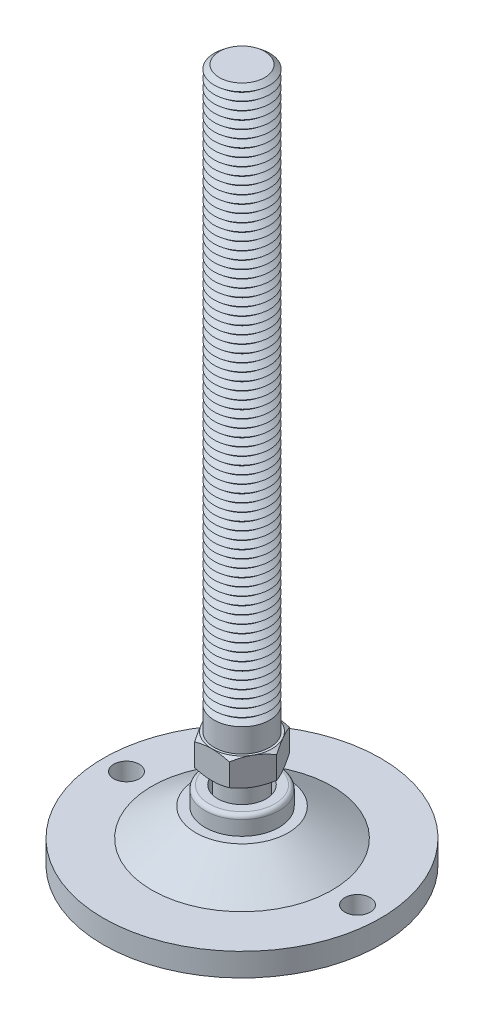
ISO-10303-21;
HEADER;
FILE_DESCRIPTION(('STEP AP214'),'2;1');
FILE_NAME('part.step','',(''),(''),'','','');
FILE_SCHEMA(('AUTOMOTIVE_DESIGN { 1 0 10303 214 1 1 1 1 }'));
ENDSEC;
DATA;
#1=APPLICATION_CONTEXT('core data for automotive mechanical design processes');
#2=APPLICATION_PROTOCOL_DEFINITION('international standard','automotive_design',2000,#1);
#3=PRODUCT_CONTEXT('',#1,'mechanical');
#4=PRODUCT('Part','Part','',(#3));
#5=PRODUCT_RELATED_PRODUCT_CATEGORY('part','',(#4));
#6=PRODUCT_DEFINITION_FORMATION('','',#4);
#7=PRODUCT_DEFINITION_CONTEXT('part definition',#1,'design');
#8=PRODUCT_DEFINITION('design','',#6,#7);
#9=PRODUCT_DEFINITION_SHAPE('','',#8);
#10=(LENGTH_UNIT() NAMED_UNIT(*) SI_UNIT(.MILLI.,.METRE.));
#11=(NAMED_UNIT(*) PLANE_ANGLE_UNIT() SI_UNIT($,.RADIAN.));
#12=(NAMED_UNIT(*) SI_UNIT($,.STERADIAN.) SOLID_ANGLE_UNIT());
#13=UNCERTAINTY_MEASURE_WITH_UNIT(LENGTH_MEASURE(1.E-05),#10,'distance_accuracy_value','');
#14=(GEOMETRIC_REPRESENTATION_CONTEXT(3) GLOBAL_UNCERTAINTY_ASSIGNED_CONTEXT((#13)) GLOBAL_UNIT_ASSIGNED_CONTEXT((#10,
#11,#12)) REPRESENTATION_CONTEXT('',''));
#15=CARTESIAN_POINT('',(0.,0.,0.));
#16=DIRECTION('',(0.,0.,1.));
#17=DIRECTION('',(1.,0.,0.));
#18=AXIS2_PLACEMENT_3D('',#15,#16,#17);
#19=CARTESIAN_POINT('',(0.,143.,0.));
#20=DIRECTION('',(0.,-1.,0.));
#21=DIRECTION('',(0.,0.,-1.));
#22=AXIS2_PLACEMENT_3D('',#19,#20,#21);
#23=CONICAL_SURFACE('',#22,4.90712535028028,0.895664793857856);
#24=CARTESIAN_POINT('',(0.,142.125,0.));
#25=DIRECTION('',(0.,-1.,0.));
#26=DIRECTION('',(0.,0.,-1.));
#27=AXIS2_PLACEMENT_3D('',#24,#25,#26);
#28=CIRCLE('',#27,6.);
#29=CARTESIAN_POINT('',(0.,142.125,-6.));
#30=VERTEX_POINT('',#29);
#31=EDGE_CURVE('P0_E2262',#30,#30,#28,.T.);
#32=ORIENTED_EDGE('',*,*,#31,.F.);
#33=EDGE_LOOP('',(#32));
#34=FACE_BOUND('',#33,.T.);
#35=CARTESIAN_POINT('',(0.,143.,0.));
#36=DIRECTION('',(0.,-1.,0.));
#37=DIRECTION('',(0.,0.,-1.));
#38=AXIS2_PLACEMENT_3D('',#35,#36,#37);
#39=CIRCLE('',#38,4.90712535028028);
#40=CARTESIAN_POINT('',(0.,143.,-4.90712535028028));
#41=VERTEX_POINT('',#40);
#42=EDGE_CURVE('P0_E2271',#41,#41,#39,.T.);
#43=ORIENTED_EDGE('',*,*,#42,.T.);
#44=EDGE_LOOP('',(#43));
#45=FACE_BOUND('',#44,.T.);
#46=ADVANCED_FACE('P0_F16',(#34,#45),#23,.T.);
#47=CARTESIAN_POINT('',(0.,143.875,0.));
#48=DIRECTION('',(0.,1.,0.));
#49=DIRECTION('',(0.,0.,1.));
#50=AXIS2_PLACEMENT_3D('',#47,#48,#49);
#51=CONICAL_SURFACE('',#50,6.,0.895664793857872);
#52=ORIENTED_EDGE('',*,*,#42,.F.);
#53=EDGE_LOOP('',(#52));
#54=FACE_BOUND('',#53,.T.);
#55=CARTESIAN_POINT('',(0.,143.875,0.));
#56=DIRECTION('',(0.,-1.,0.));
#57=DIRECTION('',(0.,0.,-1.));
#58=AXIS2_PLACEMENT_3D('',#55,#56,#57);
#59=CIRCLE('',#58,6.);
#60=CARTESIAN_POINT('',(0.,143.875,-6.));
#61=VERTEX_POINT('',#60);
#62=EDGE_CURVE('P0_E2268',#61,#61,#59,.T.);
#63=ORIENTED_EDGE('',*,*,#62,.T.);
#64=EDGE_LOOP('',(#63));
#65=FACE_BOUND('',#64,.T.);
#66=ADVANCED_FACE('P0_F308',(#54,#65),#51,.T.);
#67=CARTESIAN_POINT('',(0.,150.,0.));
#68=DIRECTION('',(0.,1.,0.));
#69=DIRECTION('',(0.,0.,1.));
#70=AXIS2_PLACEMENT_3D('',#67,#68,#69);
#71=PLANE('',#70);
#72=CARTESIAN_POINT('',(0.,150.,0.));
#73=DIRECTION('',(0.,-1.,0.));
#74=DIRECTION('',(0.,0.,-1.));
#75=AXIS2_PLACEMENT_3D('',#72,#73,#74);
#76=CIRCLE('',#75,4.90712535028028);
#77=CARTESIAN_POINT('',(0.,150.,-4.90712535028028));
#78=VERTEX_POINT('',#77);
#79=EDGE_CURVE('P0_E143',#78,#78,#76,.T.);
#80=ORIENTED_EDGE('',*,*,#79,.F.);
#81=EDGE_LOOP('',(#80));
#82=FACE_BOUND('',#81,.T.);
#83=ADVANCED_FACE('P0_F314',(#82),#71,.T.);
#84=CARTESIAN_POINT('',(0.,150.,0.));
#85=DIRECTION('',(0.,-1.,0.));
#86=DIRECTION('',(0.,0.,-1.));
#87=AXIS2_PLACEMENT_3D('',#84,#85,#86);
#88=CONICAL_SURFACE('',#87,4.90712535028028,0.895664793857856);
#89=CARTESIAN_POINT('',(0.,149.125,0.));
#90=DIRECTION('',(0.,-1.,0.));
#91=DIRECTION('',(0.,0.,-1.));
#92=AXIS2_PLACEMENT_3D('',#89,#90,#91);
#93=CIRCLE('',#92,6.);
#94=CARTESIAN_POINT('',(0.,149.125,-6.));
#95=VERTEX_POINT('',#94);
#96=EDGE_CURVE('P0_E353',#95,#95,#93,.T.);
#97=ORIENTED_EDGE('',*,*,#96,.F.);
#98=EDGE_LOOP('',(#97));
#99=FACE_BOUND('',#98,.T.);
#100=ORIENTED_EDGE('',*,*,#79,.T.);
#101=EDGE_LOOP('',(#100));
#102=FACE_BOUND('',#101,.T.);
#103=ADVANCED_FACE('P0_F211',(#99,#102),#88,.T.);
#104=CARTESIAN_POINT('',(0.,149.125,0.));
#105=DIRECTION('',(0.,1.,0.));
#106=DIRECTION('',(0.,0.,1.));
#107=AXIS2_PLACEMENT_3D('',#104,#105,#106);
#108=CONICAL_SURFACE('',#107,6.,0.895664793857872);
#109=CARTESIAN_POINT('',(0.,148.25,0.));
#110=DIRECTION('',(0.,-1.,0.));
#111=DIRECTION('',(0.,0.,-1.));
#112=AXIS2_PLACEMENT_3D('',#109,#110,#111);
#113=CIRCLE('',#112,4.90712535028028);
#114=CARTESIAN_POINT('',(0.,148.25,-4.90712535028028));
#115=VERTEX_POINT('',#114);
#116=EDGE_CURVE('P0_E352',#115,#115,#113,.T.);
#117=ORIENTED_EDGE('',*,*,#116,.F.);
#118=EDGE_LOOP('',(#117));
#119=FACE_BOUND('',#118,.T.);
#120=ORIENTED_EDGE('',*,*,#96,.T.);
#121=EDGE_LOOP('',(#120));
#122=FACE_BOUND('',#121,.T.);
#123=ADVANCED_FACE('P0_F339',(#119,#122),#108,.T.);
#124=CARTESIAN_POINT('',(0.,148.25,0.));
#125=DIRECTION('',(0.,-1.,0.));
#126=DIRECTION('',(0.,0.,-1.));
#127=AXIS2_PLACEMENT_3D('',#124,#125,#126);
#128=CONICAL_SURFACE('',#127,4.90712535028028,0.895664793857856);
#129=CARTESIAN_POINT('',(0.,147.375,0.));
#130=DIRECTION('',(0.,-1.,0.));
#131=DIRECTION('',(0.,0.,-1.));
#132=AXIS2_PLACEMENT_3D('',#129,#130,#131);
#133=CIRCLE('',#132,6.);
#134=CARTESIAN_POINT('',(0.,147.375,-6.));
#135=VERTEX_POINT('',#134);
#136=EDGE_CURVE('P0_E349',#135,#135,#133,.T.);
#137=ORIENTED_EDGE('',*,*,#136,.F.);
#138=EDGE_LOOP('',(#137));
#139=FACE_BOUND('',#138,.T.);
#140=ORIENTED_EDGE('',*,*,#116,.T.);
#141=EDGE_LOOP('',(#140));
#142=FACE_BOUND('',#141,.T.);
#143=ADVANCED_FACE('P0_F334',(#139,#142),#128,.T.);
#144=CARTESIAN_POINT('',(0.,147.375,0.));
#145=DIRECTION('',(0.,1.,0.));
#146=DIRECTION('',(0.,0.,1.));
#147=AXIS2_PLACEMENT_3D('',#144,#145,#146);
#148=CONICAL_SURFACE('',#147,6.,0.895664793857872);
#149=CARTESIAN_POINT('',(0.,146.5,0.));
#150=DIRECTION('',(0.,-1.,0.));
#151=DIRECTION('',(0.,0.,-1.));
#152=AXIS2_PLACEMENT_3D('',#149,#150,#151);
#153=CIRCLE('',#152,4.90712535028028);
#154=CARTESIAN_POINT('',(0.,146.5,-4.90712535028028));
#155=VERTEX_POINT('',#154);
#156=EDGE_CURVE('P0_E358',#155,#155,#153,.T.);
#157=ORIENTED_EDGE('',*,*,#156,.F.);
#158=EDGE_LOOP('',(#157));
#159=FACE_BOUND('',#158,.T.);
#160=ORIENTED_EDGE('',*,*,#136,.T.);
#161=EDGE_LOOP('',(#160));
#162=FACE_BOUND('',#161,.T.);
#163=ADVANCED_FACE('P0_F331',(#159,#162),#148,.T.);
#164=CARTESIAN_POINT('',(0.,146.5,0.));
#165=DIRECTION('',(0.,-1.,0.));
#166=DIRECTION('',(0.,0.,-1.));
#167=AXIS2_PLACEMENT_3D('',#164,#165,#166);
#168=CONICAL_SURFACE('',#167,4.90712535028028,0.895664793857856);
#169=CARTESIAN_POINT('',(0.,145.625,0.));
#170=DIRECTION('',(0.,-1.,0.));
#171=DIRECTION('',(0.,0.,-1.));
#172=AXIS2_PLACEMENT_3D('',#169,#170,#171);
#173=CIRCLE('',#172,6.);
#174=CARTESIAN_POINT('',(0.,145.625,-6.));
#175=VERTEX_POINT('',#174);
#176=EDGE_CURVE('P0_E2274',#175,#175,#173,.T.);
#177=ORIENTED_EDGE('',*,*,#176,.F.);
#178=EDGE_LOOP('',(#177));
#179=FACE_BOUND('',#178,.T.);
#180=ORIENTED_EDGE('',*,*,#156,.T.);
#181=EDGE_LOOP('',(#180));
#182=FACE_BOUND('',#181,.T.);
#183=ADVANCED_FACE('P0_F325',(#179,#182),#168,.T.);
#184=CARTESIAN_POINT('',(0.,145.625,0.));
#185=DIRECTION('',(0.,1.,0.));
#186=DIRECTION('',(0.,0.,1.));
#187=AXIS2_PLACEMENT_3D('',#184,#185,#186);
#188=CONICAL_SURFACE('',#187,6.,0.895664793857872);
#189=CARTESIAN_POINT('',(0.,144.75,0.));
#190=DIRECTION('',(0.,-1.,0.));
#191=DIRECTION('',(0.,0.,-1.));
#192=AXIS2_PLACEMENT_3D('',#189,#190,#191);
#193=CIRCLE('',#192,4.90712535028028);
#194=CARTESIAN_POINT('',(0.,144.75,-4.90712535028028));
#195=VERTEX_POINT('',#194);
#196=EDGE_CURVE('P0_E2277',#195,#195,#193,.T.);
#197=ORIENTED_EDGE('',*,*,#196,.F.);
#198=EDGE_LOOP('',(#197));
#199=FACE_BOUND('',#198,.T.);
#200=ORIENTED_EDGE('',*,*,#176,.T.);
#201=EDGE_LOOP('',(#200));
#202=FACE_BOUND('',#201,.T.);
#203=ADVANCED_FACE('P0_F321',(#199,#202),#188,.T.);
#204=CARTESIAN_POINT('',(0.,144.75,0.));
#205=DIRECTION('',(0.,-1.,0.));
#206=DIRECTION('',(0.,0.,-1.));
#207=AXIS2_PLACEMENT_3D('',#204,#205,#206);
#208=CONICAL_SURFACE('',#207,4.90712535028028,0.895664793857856);
#209=ORIENTED_EDGE('',*,*,#62,.F.);
#210=EDGE_LOOP('',(#209));
#211=FACE_BOUND('',#210,.T.);
#212=ORIENTED_EDGE('',*,*,#196,.T.);
#213=EDGE_LOOP('',(#212));
#214=FACE_BOUND('',#213,.T.);
#215=ADVANCED_FACE('P0_F324',(#211,#214),#208,.T.);
#216=CARTESIAN_POINT('',(0.,141.25,0.));
#217=DIRECTION('',(0.,-1.,0.));
#218=DIRECTION('',(0.,0.,-1.));
#219=AXIS2_PLACEMENT_3D('',#216,#217,#218);
#220=CONICAL_SURFACE('',#219,4.90712535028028,0.895664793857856);
#221=CARTESIAN_POINT('',(0.,140.375,0.));
#222=DIRECTION('',(0.,-1.,0.));
#223=DIRECTION('',(0.,0.,-1.));
#224=AXIS2_PLACEMENT_3D('',#221,#222,#223);
#225=CIRCLE('',#224,6.);
#226=CARTESIAN_POINT('',(0.,140.375,-6.));
#227=VERTEX_POINT('',#226);
#228=EDGE_CURVE('P0_E2256',#227,#227,#225,.T.);
#229=ORIENTED_EDGE('',*,*,#228,.F.);
#230=EDGE_LOOP('',(#229));
#231=FACE_BOUND('',#230,.T.);
#232=CARTESIAN_POINT('',(0.,141.25,0.));
#233=DIRECTION('',(0.,-1.,0.));
#234=DIRECTION('',(0.,0.,-1.));
#235=AXIS2_PLACEMENT_3D('',#232,#233,#234);
#236=CIRCLE('',#235,4.90712535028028);
#237=CARTESIAN_POINT('',(0.,141.25,-4.90712535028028));
#238=VERTEX_POINT('',#237);
#239=EDGE_CURVE('P0_E2265',#238,#238,#236,.T.);
#240=ORIENTED_EDGE('',*,*,#239,.T.);
#241=EDGE_LOOP('',(#240));
#242=FACE_BOUND('',#241,.T.);
#243=ADVANCED_FACE('P0_F329',(#231,#242),#220,.T.);
#244=CARTESIAN_POINT('',(0.,142.125,0.));
#245=DIRECTION('',(0.,1.,0.));
#246=DIRECTION('',(0.,0.,1.));
#247=AXIS2_PLACEMENT_3D('',#244,#245,#246);
#248=CONICAL_SURFACE('',#247,6.,0.895664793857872);
#249=ORIENTED_EDGE('',*,*,#239,.F.);
#250=EDGE_LOOP('',(#249));
#251=FACE_BOUND('',#250,.T.);
#252=ORIENTED_EDGE('',*,*,#31,.T.);
#253=EDGE_LOOP('',(#252));
#254=FACE_BOUND('',#253,.T.);
#255=ADVANCED_FACE('P0_F1784',(#251,#254),#248,.T.);
#256=CARTESIAN_POINT('',(0.,139.5,0.));
#257=DIRECTION('',(0.,-1.,0.));
#258=DIRECTION('',(0.,0.,-1.));
#259=AXIS2_PLACEMENT_3D('',#256,#257,#258);
#260=CONICAL_SURFACE('',#259,4.90712535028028,0.895664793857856);
#261=CARTESIAN_POINT('',(0.,138.625,0.));
#262=DIRECTION('',(0.,-1.,0.));
#263=DIRECTION('',(0.,0.,-1.));
#264=AXIS2_PLACEMENT_3D('',#261,#262,#263);
#265=CIRCLE('',#264,6.);
#266=CARTESIAN_POINT('',(0.,138.625,-6.));
#267=VERTEX_POINT('',#266);
#268=EDGE_CURVE('P0_E2250',#267,#267,#265,.T.);
#269=ORIENTED_EDGE('',*,*,#268,.F.);
#270=EDGE_LOOP('',(#269));
#271=FACE_BOUND('',#270,.T.);
#272=CARTESIAN_POINT('',(0.,139.5,0.));
#273=DIRECTION('',(0.,-1.,0.));
#274=DIRECTION('',(0.,0.,-1.));
#275=AXIS2_PLACEMENT_3D('',#272,#273,#274);
#276=CIRCLE('',#275,4.90712535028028);
#277=CARTESIAN_POINT('',(0.,139.5,-4.90712535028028));
#278=VERTEX_POINT('',#277);
#279=EDGE_CURVE('P0_E2259',#278,#278,#276,.T.);
#280=ORIENTED_EDGE('',*,*,#279,.T.);
#281=EDGE_LOOP('',(#280));
#282=FACE_BOUND('',#281,.T.);
#283=ADVANCED_FACE('P0_F1774',(#271,#282),#260,.T.);
#284=CARTESIAN_POINT('',(0.,140.375,0.));
#285=DIRECTION('',(0.,1.,0.));
#286=DIRECTION('',(0.,0.,1.));
#287=AXIS2_PLACEMENT_3D('',#284,#285,#286);
#288=CONICAL_SURFACE('',#287,6.,0.895664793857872);
#289=ORIENTED_EDGE('',*,*,#279,.F.);
#290=EDGE_LOOP('',(#289));
#291=FACE_BOUND('',#290,.T.);
#292=ORIENTED_EDGE('',*,*,#228,.T.);
#293=EDGE_LOOP('',(#292));
#294=FACE_BOUND('',#293,.T.);
#295=ADVANCED_FACE('P0_F1764',(#291,#294),#288,.T.);
#296=CARTESIAN_POINT('',(0.,137.75,0.));
#297=DIRECTION('',(0.,-1.,0.));
#298=DIRECTION('',(0.,0.,-1.));
#299=AXIS2_PLACEMENT_3D('',#296,#297,#298);
#300=CONICAL_SURFACE('',#299,4.90712535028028,0.895664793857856);
#301=CARTESIAN_POINT('',(0.,136.875,0.));
#302=DIRECTION('',(0.,-1.,0.));
#303=DIRECTION('',(0.,0.,-1.));
#304=AXIS2_PLACEMENT_3D('',#301,#302,#303);
#305=CIRCLE('',#304,6.);
#306=CARTESIAN_POINT('',(0.,136.875,-6.));
#307=VERTEX_POINT('',#306);
#308=EDGE_CURVE('P0_E2244',#307,#307,#305,.T.);
#309=ORIENTED_EDGE('',*,*,#308,.F.);
#310=EDGE_LOOP('',(#309));
#311=FACE_BOUND('',#310,.T.);
#312=CARTESIAN_POINT('',(0.,137.75,0.));
#313=DIRECTION('',(0.,-1.,0.));
#314=DIRECTION('',(0.,0.,-1.));
#315=AXIS2_PLACEMENT_3D('',#312,#313,#314);
#316=CIRCLE('',#315,4.90712535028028);
#317=CARTESIAN_POINT('',(0.,137.75,-4.90712535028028));
#318=VERTEX_POINT('',#317);
#319=EDGE_CURVE('P0_E2253',#318,#318,#316,.T.);
#320=ORIENTED_EDGE('',*,*,#319,.T.);
#321=EDGE_LOOP('',(#320));
#322=FACE_BOUND('',#321,.T.);
#323=ADVANCED_FACE('P0_F1754',(#311,#322),#300,.T.);
#324=CARTESIAN_POINT('',(0.,138.625,0.));
#325=DIRECTION('',(0.,1.,0.));
#326=DIRECTION('',(0.,0.,1.));
#327=AXIS2_PLACEMENT_3D('',#324,#325,#326);
#328=CONICAL_SURFACE('',#327,6.,0.895664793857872);
#329=ORIENTED_EDGE('',*,*,#319,.F.);
#330=EDGE_LOOP('',(#329));
#331=FACE_BOUND('',#330,.T.);
#332=ORIENTED_EDGE('',*,*,#268,.T.);
#333=EDGE_LOOP('',(#332));
#334=FACE_BOUND('',#333,.T.);
#335=ADVANCED_FACE('P0_F1744',(#331,#334),#328,.T.);
#336=CARTESIAN_POINT('',(0.,136.,0.));
#337=DIRECTION('',(0.,-1.,0.));
#338=DIRECTION('',(0.,0.,-1.));
#339=AXIS2_PLACEMENT_3D('',#336,#337,#338);
#340=CONICAL_SURFACE('',#339,4.90712535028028,0.895664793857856);
#341=CARTESIAN_POINT('',(0.,135.125,0.));
#342=DIRECTION('',(0.,-1.,0.));
#343=DIRECTION('',(0.,0.,-1.));
#344=AXIS2_PLACEMENT_3D('',#341,#342,#343);
#345=CIRCLE('',#344,6.);
#346=CARTESIAN_POINT('',(0.,135.125,-6.));
#347=VERTEX_POINT('',#346);
#348=EDGE_CURVE('P0_E2238',#347,#347,#345,.T.);
#349=ORIENTED_EDGE('',*,*,#348,.F.);
#350=EDGE_LOOP('',(#349));
#351=FACE_BOUND('',#350,.T.);
#352=CARTESIAN_POINT('',(0.,136.,0.));
#353=DIRECTION('',(0.,-1.,0.));
#354=DIRECTION('',(0.,0.,-1.));
#355=AXIS2_PLACEMENT_3D('',#352,#353,#354);
#356=CIRCLE('',#355,4.90712535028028);
#357=CARTESIAN_POINT('',(0.,136.,-4.90712535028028));
#358=VERTEX_POINT('',#357);
#359=EDGE_CURVE('P0_E2247',#358,#358,#356,.T.);
#360=ORIENTED_EDGE('',*,*,#359,.T.);
#361=EDGE_LOOP('',(#360));
#362=FACE_BOUND('',#361,.T.);
#363=ADVANCED_FACE('P0_F1734',(#351,#362),#340,.T.);
#364=CARTESIAN_POINT('',(0.,136.875,0.));
#365=DIRECTION('',(0.,1.,0.));
#366=DIRECTION('',(0.,0.,1.));
#367=AXIS2_PLACEMENT_3D('',#364,#365,#366);
#368=CONICAL_SURFACE('',#367,6.,0.895664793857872);
#369=ORIENTED_EDGE('',*,*,#359,.F.);
#370=EDGE_LOOP('',(#369));
#371=FACE_BOUND('',#370,.T.);
#372=ORIENTED_EDGE('',*,*,#308,.T.);
#373=EDGE_LOOP('',(#372));
#374=FACE_BOUND('',#373,.T.);
#375=ADVANCED_FACE('P0_F1724',(#371,#374),#368,.T.);
#376=CARTESIAN_POINT('',(0.,134.25,0.));
#377=DIRECTION('',(0.,-1.,0.));
#378=DIRECTION('',(0.,0.,-1.));
#379=AXIS2_PLACEMENT_3D('',#376,#377,#378);
#380=CONICAL_SURFACE('',#379,4.90712535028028,0.895664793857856);
#381=CARTESIAN_POINT('',(0.,133.375,0.));
#382=DIRECTION('',(0.,-1.,0.));
#383=DIRECTION('',(0.,0.,-1.));
#384=AXIS2_PLACEMENT_3D('',#381,#382,#383);
#385=CIRCLE('',#384,6.);
#386=CARTESIAN_POINT('',(0.,133.375,-6.));
#387=VERTEX_POINT('',#386);
#388=EDGE_CURVE('P0_E2232',#387,#387,#385,.T.);
#389=ORIENTED_EDGE('',*,*,#388,.F.);
#390=EDGE_LOOP('',(#389));
#391=FACE_BOUND('',#390,.T.);
#392=CARTESIAN_POINT('',(0.,134.25,0.));
#393=DIRECTION('',(0.,-1.,0.));
#394=DIRECTION('',(0.,0.,-1.));
#395=AXIS2_PLACEMENT_3D('',#392,#393,#394);
#396=CIRCLE('',#395,4.90712535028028);
#397=CARTESIAN_POINT('',(0.,134.25,-4.90712535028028));
#398=VERTEX_POINT('',#397);
#399=EDGE_CURVE('P0_E2241',#398,#398,#396,.T.);
#400=ORIENTED_EDGE('',*,*,#399,.T.);
#401=EDGE_LOOP('',(#400));
#402=FACE_BOUND('',#401,.T.);
#403=ADVANCED_FACE('P0_F1714',(#391,#402),#380,.T.);
#404=CARTESIAN_POINT('',(0.,135.125,0.));
#405=DIRECTION('',(0.,1.,0.));
#406=DIRECTION('',(0.,0.,1.));
#407=AXIS2_PLACEMENT_3D('',#404,#405,#406);
#408=CONICAL_SURFACE('',#407,6.,0.895664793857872);
#409=ORIENTED_EDGE('',*,*,#399,.F.);
#410=EDGE_LOOP('',(#409));
#411=FACE_BOUND('',#410,.T.);
#412=ORIENTED_EDGE('',*,*,#348,.T.);
#413=EDGE_LOOP('',(#412));
#414=FACE_BOUND('',#413,.T.);
#415=ADVANCED_FACE('P0_F1704',(#411,#414),#408,.T.);
#416=CARTESIAN_POINT('',(0.,132.5,0.));
#417=DIRECTION('',(0.,-1.,0.));
#418=DIRECTION('',(0.,0.,-1.));
#419=AXIS2_PLACEMENT_3D('',#416,#417,#418);
#420=CONICAL_SURFACE('',#419,4.90712535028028,0.895664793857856);
#421=CARTESIAN_POINT('',(0.,131.625,0.));
#422=DIRECTION('',(0.,-1.,0.));
#423=DIRECTION('',(0.,0.,-1.));
#424=AXIS2_PLACEMENT_3D('',#421,#422,#423);
#425=CIRCLE('',#424,6.);
#426=CARTESIAN_POINT('',(0.,131.625,-6.));
#427=VERTEX_POINT('',#426);
#428=EDGE_CURVE('P0_E2226',#427,#427,#425,.T.);
#429=ORIENTED_EDGE('',*,*,#428,.F.);
#430=EDGE_LOOP('',(#429));
#431=FACE_BOUND('',#430,.T.);
#432=CARTESIAN_POINT('',(0.,132.5,0.));
#433=DIRECTION('',(0.,-1.,0.));
#434=DIRECTION('',(0.,0.,-1.));
#435=AXIS2_PLACEMENT_3D('',#432,#433,#434);
#436=CIRCLE('',#435,4.90712535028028);
#437=CARTESIAN_POINT('',(0.,132.5,-4.90712535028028));
#438=VERTEX_POINT('',#437);
#439=EDGE_CURVE('P0_E2235',#438,#438,#436,.T.);
#440=ORIENTED_EDGE('',*,*,#439,.T.);
#441=EDGE_LOOP('',(#440));
#442=FACE_BOUND('',#441,.T.);
#443=ADVANCED_FACE('P0_F1694',(#431,#442),#420,.T.);
#444=CARTESIAN_POINT('',(0.,133.375,0.));
#445=DIRECTION('',(0.,1.,0.));
#446=DIRECTION('',(0.,0.,1.));
#447=AXIS2_PLACEMENT_3D('',#444,#445,#446);
#448=CONICAL_SURFACE('',#447,6.,0.895664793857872);
#449=ORIENTED_EDGE('',*,*,#439,.F.);
#450=EDGE_LOOP('',(#449));
#451=FACE_BOUND('',#450,.T.);
#452=ORIENTED_EDGE('',*,*,#388,.T.);
#453=EDGE_LOOP('',(#452));
#454=FACE_BOUND('',#453,.T.);
#455=ADVANCED_FACE('P0_F1684',(#451,#454),#448,.T.);
#456=CARTESIAN_POINT('',(0.,130.75,0.));
#457=DIRECTION('',(0.,-1.,0.));
#458=DIRECTION('',(0.,0.,-1.));
#459=AXIS2_PLACEMENT_3D('',#456,#457,#458);
#460=CONICAL_SURFACE('',#459,4.90712535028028,0.895664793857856);
#461=CARTESIAN_POINT('',(0.,129.875,0.));
#462=DIRECTION('',(0.,-1.,0.));
#463=DIRECTION('',(0.,0.,-1.));
#464=AXIS2_PLACEMENT_3D('',#461,#462,#463);
#465=CIRCLE('',#464,6.);
#466=CARTESIAN_POINT('',(0.,129.875,-6.));
#467=VERTEX_POINT('',#466);
#468=EDGE_CURVE('P0_E2220',#467,#467,#465,.T.);
#469=ORIENTED_EDGE('',*,*,#468,.F.);
#470=EDGE_LOOP('',(#469));
#471=FACE_BOUND('',#470,.T.);
#472=CARTESIAN_POINT('',(0.,130.75,0.));
#473=DIRECTION('',(0.,-1.,0.));
#474=DIRECTION('',(0.,0.,-1.));
#475=AXIS2_PLACEMENT_3D('',#472,#473,#474);
#476=CIRCLE('',#475,4.90712535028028);
#477=CARTESIAN_POINT('',(0.,130.75,-4.90712535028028));
#478=VERTEX_POINT('',#477);
#479=EDGE_CURVE('P0_E2229',#478,#478,#476,.T.);
#480=ORIENTED_EDGE('',*,*,#479,.T.);
#481=EDGE_LOOP('',(#480));
#482=FACE_BOUND('',#481,.T.);
#483=ADVANCED_FACE('P0_F1674',(#471,#482),#460,.T.);
#484=CARTESIAN_POINT('',(0.,131.625,0.));
#485=DIRECTION('',(0.,1.,0.));
#486=DIRECTION('',(0.,0.,1.));
#487=AXIS2_PLACEMENT_3D('',#484,#485,#486);
#488=CONICAL_SURFACE('',#487,6.,0.895664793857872);
#489=ORIENTED_EDGE('',*,*,#479,.F.);
#490=EDGE_LOOP('',(#489));
#491=FACE_BOUND('',#490,.T.);
#492=ORIENTED_EDGE('',*,*,#428,.T.);
#493=EDGE_LOOP('',(#492));
#494=FACE_BOUND('',#493,.T.);
#495=ADVANCED_FACE('P0_F1664',(#491,#494),#488,.T.);
#496=CARTESIAN_POINT('',(0.,129.,0.));
#497=DIRECTION('',(0.,-1.,0.));
#498=DIRECTION('',(0.,0.,-1.));
#499=AXIS2_PLACEMENT_3D('',#496,#497,#498);
#500=CONICAL_SURFACE('',#499,4.90712535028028,0.895664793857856);
#501=CARTESIAN_POINT('',(0.,128.125,0.));
#502=DIRECTION('',(0.,-1.,0.));
#503=DIRECTION('',(0.,0.,-1.));
#504=AXIS2_PLACEMENT_3D('',#501,#502,#503);
#505=CIRCLE('',#504,6.);
#506=CARTESIAN_POINT('',(0.,128.125,-6.));
#507=VERTEX_POINT('',#506);
#508=EDGE_CURVE('P0_E2214',#507,#507,#505,.T.);
#509=ORIENTED_EDGE('',*,*,#508,.F.);
#510=EDGE_LOOP('',(#509));
#511=FACE_BOUND('',#510,.T.);
#512=CARTESIAN_POINT('',(0.,129.,0.));
#513=DIRECTION('',(0.,-1.,0.));
#514=DIRECTION('',(0.,0.,-1.));
#515=AXIS2_PLACEMENT_3D('',#512,#513,#514);
#516=CIRCLE('',#515,4.90712535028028);
#517=CARTESIAN_POINT('',(0.,129.,-4.90712535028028));
#518=VERTEX_POINT('',#517);
#519=EDGE_CURVE('P0_E2223',#518,#518,#516,.T.);
#520=ORIENTED_EDGE('',*,*,#519,.T.);
#521=EDGE_LOOP('',(#520));
#522=FACE_BOUND('',#521,.T.);
#523=ADVANCED_FACE('P0_F1654',(#511,#522),#500,.T.);
#524=CARTESIAN_POINT('',(0.,129.875,0.));
#525=DIRECTION('',(0.,1.,0.));
#526=DIRECTION('',(0.,0.,1.));
#527=AXIS2_PLACEMENT_3D('',#524,#525,#526);
#528=CONICAL_SURFACE('',#527,6.,0.895664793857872);
#529=ORIENTED_EDGE('',*,*,#519,.F.);
#530=EDGE_LOOP('',(#529));
#531=FACE_BOUND('',#530,.T.);
#532=ORIENTED_EDGE('',*,*,#468,.T.);
#533=EDGE_LOOP('',(#532));
#534=FACE_BOUND('',#533,.T.);
#535=ADVANCED_FACE('P0_F1644',(#531,#534),#528,.T.);
#536=CARTESIAN_POINT('',(0.,127.25,0.));
#537=DIRECTION('',(0.,-1.,0.));
#538=DIRECTION('',(0.,0.,-1.));
#539=AXIS2_PLACEMENT_3D('',#536,#537,#538);
#540=CONICAL_SURFACE('',#539,4.90712535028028,0.895664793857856);
#541=CARTESIAN_POINT('',(0.,126.375,0.));
#542=DIRECTION('',(0.,-1.,0.));
#543=DIRECTION('',(0.,0.,-1.));
#544=AXIS2_PLACEMENT_3D('',#541,#542,#543);
#545=CIRCLE('',#544,6.);
#546=CARTESIAN_POINT('',(0.,126.375,-6.));
#547=VERTEX_POINT('',#546);
#548=EDGE_CURVE('P0_E2208',#547,#547,#545,.T.);
#549=ORIENTED_EDGE('',*,*,#548,.F.);
#550=EDGE_LOOP('',(#549));
#551=FACE_BOUND('',#550,.T.);
#552=CARTESIAN_POINT('',(0.,127.25,0.));
#553=DIRECTION('',(0.,-1.,0.));
#554=DIRECTION('',(0.,0.,-1.));
#555=AXIS2_PLACEMENT_3D('',#552,#553,#554);
#556=CIRCLE('',#555,4.90712535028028);
#557=CARTESIAN_POINT('',(0.,127.25,-4.90712535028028));
#558=VERTEX_POINT('',#557);
#559=EDGE_CURVE('P0_E2217',#558,#558,#556,.T.);
#560=ORIENTED_EDGE('',*,*,#559,.T.);
#561=EDGE_LOOP('',(#560));
#562=FACE_BOUND('',#561,.T.);
#563=ADVANCED_FACE('P0_F1634',(#551,#562),#540,.T.);
#564=CARTESIAN_POINT('',(0.,128.125,0.));
#565=DIRECTION('',(0.,1.,0.));
#566=DIRECTION('',(0.,0.,1.));
#567=AXIS2_PLACEMENT_3D('',#564,#565,#566);
#568=CONICAL_SURFACE('',#567,6.,0.895664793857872);
#569=ORIENTED_EDGE('',*,*,#559,.F.);
#570=EDGE_LOOP('',(#569));
#571=FACE_BOUND('',#570,.T.);
#572=ORIENTED_EDGE('',*,*,#508,.T.);
#573=EDGE_LOOP('',(#572));
#574=FACE_BOUND('',#573,.T.);
#575=ADVANCED_FACE('P0_F1624',(#571,#574),#568,.T.);
#576=CARTESIAN_POINT('',(0.,125.5,0.));
#577=DIRECTION('',(0.,-1.,0.));
#578=DIRECTION('',(0.,0.,-1.));
#579=AXIS2_PLACEMENT_3D('',#576,#577,#578);
#580=CONICAL_SURFACE('',#579,4.90712535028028,0.895664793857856);
#581=CARTESIAN_POINT('',(0.,124.625,0.));
#582=DIRECTION('',(0.,-1.,0.));
#583=DIRECTION('',(0.,0.,-1.));
#584=AXIS2_PLACEMENT_3D('',#581,#582,#583);
#585=CIRCLE('',#584,6.);
#586=CARTESIAN_POINT('',(0.,124.625,-6.));
#587=VERTEX_POINT('',#586);
#588=EDGE_CURVE('P0_E2202',#587,#587,#585,.T.);
#589=ORIENTED_EDGE('',*,*,#588,.F.);
#590=EDGE_LOOP('',(#589));
#591=FACE_BOUND('',#590,.T.);
#592=CARTESIAN_POINT('',(0.,125.5,0.));
#593=DIRECTION('',(0.,-1.,0.));
#594=DIRECTION('',(0.,0.,-1.));
#595=AXIS2_PLACEMENT_3D('',#592,#593,#594);
#596=CIRCLE('',#595,4.90712535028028);
#597=CARTESIAN_POINT('',(0.,125.5,-4.90712535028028));
#598=VERTEX_POINT('',#597);
#599=EDGE_CURVE('P0_E2211',#598,#598,#596,.T.);
#600=ORIENTED_EDGE('',*,*,#599,.T.);
#601=EDGE_LOOP('',(#600));
#602=FACE_BOUND('',#601,.T.);
#603=ADVANCED_FACE('P0_F1614',(#591,#602),#580,.T.);
#604=CARTESIAN_POINT('',(0.,126.375,0.));
#605=DIRECTION('',(0.,1.,0.));
#606=DIRECTION('',(0.,0.,1.));
#607=AXIS2_PLACEMENT_3D('',#604,#605,#606);
#608=CONICAL_SURFACE('',#607,6.,0.895664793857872);
#609=ORIENTED_EDGE('',*,*,#599,.F.);
#610=EDGE_LOOP('',(#609));
#611=FACE_BOUND('',#610,.T.);
#612=ORIENTED_EDGE('',*,*,#548,.T.);
#613=EDGE_LOOP('',(#612));
#614=FACE_BOUND('',#613,.T.);
#615=ADVANCED_FACE('P0_F1604',(#611,#614),#608,.T.);
#616=CARTESIAN_POINT('',(0.,123.75,0.));
#617=DIRECTION('',(0.,-1.,0.));
#618=DIRECTION('',(0.,0.,-1.));
#619=AXIS2_PLACEMENT_3D('',#616,#617,#618);
#620=CONICAL_SURFACE('',#619,4.90712535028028,0.895664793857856);
#621=CARTESIAN_POINT('',(0.,122.875,0.));
#622=DIRECTION('',(0.,-1.,0.));
#623=DIRECTION('',(0.,0.,-1.));
#624=AXIS2_PLACEMENT_3D('',#621,#622,#623);
#625=CIRCLE('',#624,6.);
#626=CARTESIAN_POINT('',(0.,122.875,-6.));
#627=VERTEX_POINT('',#626);
#628=EDGE_CURVE('P0_E2196',#627,#627,#625,.T.);
#629=ORIENTED_EDGE('',*,*,#628,.F.);
#630=EDGE_LOOP('',(#629));
#631=FACE_BOUND('',#630,.T.);
#632=CARTESIAN_POINT('',(0.,123.75,0.));
#633=DIRECTION('',(0.,-1.,0.));
#634=DIRECTION('',(0.,0.,-1.));
#635=AXIS2_PLACEMENT_3D('',#632,#633,#634);
#636=CIRCLE('',#635,4.90712535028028);
#637=CARTESIAN_POINT('',(0.,123.75,-4.90712535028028));
#638=VERTEX_POINT('',#637);
#639=EDGE_CURVE('P0_E2205',#638,#638,#636,.T.);
#640=ORIENTED_EDGE('',*,*,#639,.T.);
#641=EDGE_LOOP('',(#640));
#642=FACE_BOUND('',#641,.T.);
#643=ADVANCED_FACE('P0_F1594',(#631,#642),#620,.T.);
#644=CARTESIAN_POINT('',(0.,124.625,0.));
#645=DIRECTION('',(0.,1.,0.));
#646=DIRECTION('',(0.,0.,1.));
#647=AXIS2_PLACEMENT_3D('',#644,#645,#646);
#648=CONICAL_SURFACE('',#647,6.,0.895664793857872);
#649=ORIENTED_EDGE('',*,*,#639,.F.);
#650=EDGE_LOOP('',(#649));
#651=FACE_BOUND('',#650,.T.);
#652=ORIENTED_EDGE('',*,*,#588,.T.);
#653=EDGE_LOOP('',(#652));
#654=FACE_BOUND('',#653,.T.);
#655=ADVANCED_FACE('P0_F1584',(#651,#654),#648,.T.);
#656=CARTESIAN_POINT('',(0.,122.,0.));
#657=DIRECTION('',(0.,-1.,0.));
#658=DIRECTION('',(0.,0.,-1.));
#659=AXIS2_PLACEMENT_3D('',#656,#657,#658);
#660=CONICAL_SURFACE('',#659,4.90712535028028,0.895664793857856);
#661=CARTESIAN_POINT('',(0.,121.125,0.));
#662=DIRECTION('',(0.,-1.,0.));
#663=DIRECTION('',(0.,0.,-1.));
#664=AXIS2_PLACEMENT_3D('',#661,#662,#663);
#665=CIRCLE('',#664,6.);
#666=CARTESIAN_POINT('',(0.,121.125,-6.));
#667=VERTEX_POINT('',#666);
#668=EDGE_CURVE('P0_E2190',#667,#667,#665,.T.);
#669=ORIENTED_EDGE('',*,*,#668,.F.);
#670=EDGE_LOOP('',(#669));
#671=FACE_BOUND('',#670,.T.);
#672=CARTESIAN_POINT('',(0.,122.,0.));
#673=DIRECTION('',(0.,-1.,0.));
#674=DIRECTION('',(0.,0.,-1.));
#675=AXIS2_PLACEMENT_3D('',#672,#673,#674);
#676=CIRCLE('',#675,4.90712535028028);
#677=CARTESIAN_POINT('',(0.,122.,-4.90712535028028));
#678=VERTEX_POINT('',#677);
#679=EDGE_CURVE('P0_E2199',#678,#678,#676,.T.);
#680=ORIENTED_EDGE('',*,*,#679,.T.);
#681=EDGE_LOOP('',(#680));
#682=FACE_BOUND('',#681,.T.);
#683=ADVANCED_FACE('P0_F1574',(#671,#682),#660,.T.);
#684=CARTESIAN_POINT('',(0.,122.875,0.));
#685=DIRECTION('',(0.,1.,0.));
#686=DIRECTION('',(0.,0.,1.));
#687=AXIS2_PLACEMENT_3D('',#684,#685,#686);
#688=CONICAL_SURFACE('',#687,6.,0.895664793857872);
#689=ORIENTED_EDGE('',*,*,#679,.F.);
#690=EDGE_LOOP('',(#689));
#691=FACE_BOUND('',#690,.T.);
#692=ORIENTED_EDGE('',*,*,#628,.T.);
#693=EDGE_LOOP('',(#692));
#694=FACE_BOUND('',#693,.T.);
#695=ADVANCED_FACE('P0_F1564',(#691,#694),#688,.T.);
#696=CARTESIAN_POINT('',(0.,120.25,0.));
#697=DIRECTION('',(0.,-1.,0.));
#698=DIRECTION('',(0.,0.,-1.));
#699=AXIS2_PLACEMENT_3D('',#696,#697,#698);
#700=CONICAL_SURFACE('',#699,4.90712535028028,0.895664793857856);
#701=CARTESIAN_POINT('',(0.,119.375,0.));
#702=DIRECTION('',(0.,-1.,0.));
#703=DIRECTION('',(0.,0.,-1.));
#704=AXIS2_PLACEMENT_3D('',#701,#702,#703);
#705=CIRCLE('',#704,6.);
#706=CARTESIAN_POINT('',(0.,119.375,-6.));
#707=VERTEX_POINT('',#706);
#708=EDGE_CURVE('P0_E2184',#707,#707,#705,.T.);
#709=ORIENTED_EDGE('',*,*,#708,.F.);
#710=EDGE_LOOP('',(#709));
#711=FACE_BOUND('',#710,.T.);
#712=CARTESIAN_POINT('',(0.,120.25,0.));
#713=DIRECTION('',(0.,-1.,0.));
#714=DIRECTION('',(0.,0.,-1.));
#715=AXIS2_PLACEMENT_3D('',#712,#713,#714);
#716=CIRCLE('',#715,4.90712535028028);
#717=CARTESIAN_POINT('',(0.,120.25,-4.90712535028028));
#718=VERTEX_POINT('',#717);
#719=EDGE_CURVE('P0_E2193',#718,#718,#716,.T.);
#720=ORIENTED_EDGE('',*,*,#719,.T.);
#721=EDGE_LOOP('',(#720));
#722=FACE_BOUND('',#721,.T.);
#723=ADVANCED_FACE('P0_F1554',(#711,#722),#700,.T.);
#724=CARTESIAN_POINT('',(0.,121.125,0.));
#725=DIRECTION('',(0.,1.,0.));
#726=DIRECTION('',(0.,0.,1.));
#727=AXIS2_PLACEMENT_3D('',#724,#725,#726);
#728=CONICAL_SURFACE('',#727,6.,0.895664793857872);
#729=ORIENTED_EDGE('',*,*,#719,.F.);
#730=EDGE_LOOP('',(#729));
#731=FACE_BOUND('',#730,.T.);
#732=ORIENTED_EDGE('',*,*,#668,.T.);
#733=EDGE_LOOP('',(#732));
#734=FACE_BOUND('',#733,.T.);
#735=ADVANCED_FACE('P0_F1544',(#731,#734),#728,.T.);
#736=CARTESIAN_POINT('',(0.,118.5,0.));
#737=DIRECTION('',(0.,-1.,0.));
#738=DIRECTION('',(0.,0.,-1.));
#739=AXIS2_PLACEMENT_3D('',#736,#737,#738);
#740=CONICAL_SURFACE('',#739,4.90712535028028,0.895664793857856);
#741=CARTESIAN_POINT('',(0.,117.625,0.));
#742=DIRECTION('',(0.,-1.,0.));
#743=DIRECTION('',(0.,0.,-1.));
#744=AXIS2_PLACEMENT_3D('',#741,#742,#743);
#745=CIRCLE('',#744,6.);
#746=CARTESIAN_POINT('',(0.,117.625,-6.));
#747=VERTEX_POINT('',#746);
#748=EDGE_CURVE('P0_E2178',#747,#747,#745,.T.);
#749=ORIENTED_EDGE('',*,*,#748,.F.);
#750=EDGE_LOOP('',(#749));
#751=FACE_BOUND('',#750,.T.);
#752=CARTESIAN_POINT('',(0.,118.5,0.));
#753=DIRECTION('',(0.,-1.,0.));
#754=DIRECTION('',(0.,0.,-1.));
#755=AXIS2_PLACEMENT_3D('',#752,#753,#754);
#756=CIRCLE('',#755,4.90712535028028);
#757=CARTESIAN_POINT('',(0.,118.5,-4.90712535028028));
#758=VERTEX_POINT('',#757);
#759=EDGE_CURVE('P0_E2187',#758,#758,#756,.T.);
#760=ORIENTED_EDGE('',*,*,#759,.T.);
#761=EDGE_LOOP('',(#760));
#762=FACE_BOUND('',#761,.T.);
#763=ADVANCED_FACE('P0_F1534',(#751,#762),#740,.T.);
#764=CARTESIAN_POINT('',(0.,119.375,0.));
#765=DIRECTION('',(0.,1.,0.));
#766=DIRECTION('',(0.,0.,1.));
#767=AXIS2_PLACEMENT_3D('',#764,#765,#766);
#768=CONICAL_SURFACE('',#767,6.,0.895664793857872);
#769=ORIENTED_EDGE('',*,*,#759,.F.);
#770=EDGE_LOOP('',(#769));
#771=FACE_BOUND('',#770,.T.);
#772=ORIENTED_EDGE('',*,*,#708,.T.);
#773=EDGE_LOOP('',(#772));
#774=FACE_BOUND('',#773,.T.);
#775=ADVANCED_FACE('P0_F1524',(#771,#774),#768,.T.);
#776=CARTESIAN_POINT('',(0.,116.75,0.));
#777=DIRECTION('',(0.,-1.,0.));
#778=DIRECTION('',(0.,0.,-1.));
#779=AXIS2_PLACEMENT_3D('',#776,#777,#778);
#780=CONICAL_SURFACE('',#779,4.90712535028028,0.895664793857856);
#781=CARTESIAN_POINT('',(0.,115.875,0.));
#782=DIRECTION('',(0.,-1.,0.));
#783=DIRECTION('',(0.,0.,-1.));
#784=AXIS2_PLACEMENT_3D('',#781,#782,#783);
#785=CIRCLE('',#784,6.);
#786=CARTESIAN_POINT('',(0.,115.875,-6.));
#787=VERTEX_POINT('',#786);
#788=EDGE_CURVE('P0_E2172',#787,#787,#785,.T.);
#789=ORIENTED_EDGE('',*,*,#788,.F.);
#790=EDGE_LOOP('',(#789));
#791=FACE_BOUND('',#790,.T.);
#792=CARTESIAN_POINT('',(0.,116.75,0.));
#793=DIRECTION('',(0.,-1.,0.));
#794=DIRECTION('',(0.,0.,-1.));
#795=AXIS2_PLACEMENT_3D('',#792,#793,#794);
#796=CIRCLE('',#795,4.90712535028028);
#797=CARTESIAN_POINT('',(0.,116.75,-4.90712535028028));
#798=VERTEX_POINT('',#797);
#799=EDGE_CURVE('P0_E2181',#798,#798,#796,.T.);
#800=ORIENTED_EDGE('',*,*,#799,.T.);
#801=EDGE_LOOP('',(#800));
#802=FACE_BOUND('',#801,.T.);
#803=ADVANCED_FACE('P0_F1514',(#791,#802),#780,.T.);
#804=CARTESIAN_POINT('',(0.,117.625,0.));
#805=DIRECTION('',(0.,1.,0.));
#806=DIRECTION('',(0.,0.,1.));
#807=AXIS2_PLACEMENT_3D('',#804,#805,#806);
#808=CONICAL_SURFACE('',#807,6.,0.895664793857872);
#809=ORIENTED_EDGE('',*,*,#799,.F.);
#810=EDGE_LOOP('',(#809));
#811=FACE_BOUND('',#810,.T.);
#812=ORIENTED_EDGE('',*,*,#748,.T.);
#813=EDGE_LOOP('',(#812));
#814=FACE_BOUND('',#813,.T.);
#815=ADVANCED_FACE('P0_F1504',(#811,#814),#808,.T.);
#816=CARTESIAN_POINT('',(0.,115.,0.));
#817=DIRECTION('',(0.,-1.,0.));
#818=DIRECTION('',(0.,0.,-1.));
#819=AXIS2_PLACEMENT_3D('',#816,#817,#818);
#820=CONICAL_SURFACE('',#819,4.90712535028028,0.895664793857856);
#821=CARTESIAN_POINT('',(0.,114.125,0.));
#822=DIRECTION('',(0.,-1.,0.));
#823=DIRECTION('',(0.,0.,-1.));
#824=AXIS2_PLACEMENT_3D('',#821,#822,#823);
#825=CIRCLE('',#824,6.);
#826=CARTESIAN_POINT('',(0.,114.125,-6.));
#827=VERTEX_POINT('',#826);
#828=EDGE_CURVE('P0_E2166',#827,#827,#825,.T.);
#829=ORIENTED_EDGE('',*,*,#828,.F.);
#830=EDGE_LOOP('',(#829));
#831=FACE_BOUND('',#830,.T.);
#832=CARTESIAN_POINT('',(0.,115.,0.));
#833=DIRECTION('',(0.,-1.,0.));
#834=DIRECTION('',(0.,0.,-1.));
#835=AXIS2_PLACEMENT_3D('',#832,#833,#834);
#836=CIRCLE('',#835,4.90712535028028);
#837=CARTESIAN_POINT('',(0.,115.,-4.90712535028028));
#838=VERTEX_POINT('',#837);
#839=EDGE_CURVE('P0_E2175',#838,#838,#836,.T.);
#840=ORIENTED_EDGE('',*,*,#839,.T.);
#841=EDGE_LOOP('',(#840));
#842=FACE_BOUND('',#841,.T.);
#843=ADVANCED_FACE('P0_F1494',(#831,#842),#820,.T.);
#844=CARTESIAN_POINT('',(0.,115.875,0.));
#845=DIRECTION('',(0.,1.,0.));
#846=DIRECTION('',(0.,0.,1.));
#847=AXIS2_PLACEMENT_3D('',#844,#845,#846);
#848=CONICAL_SURFACE('',#847,6.,0.895664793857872);
#849=ORIENTED_EDGE('',*,*,#839,.F.);
#850=EDGE_LOOP('',(#849));
#851=FACE_BOUND('',#850,.T.);
#852=ORIENTED_EDGE('',*,*,#788,.T.);
#853=EDGE_LOOP('',(#852));
#854=FACE_BOUND('',#853,.T.);
#855=ADVANCED_FACE('P0_F1484',(#851,#854),#848,.T.);
#856=CARTESIAN_POINT('',(0.,113.25,0.));
#857=DIRECTION('',(0.,-1.,0.));
#858=DIRECTION('',(0.,0.,-1.));
#859=AXIS2_PLACEMENT_3D('',#856,#857,#858);
#860=CONICAL_SURFACE('',#859,4.90712535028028,0.895664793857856);
#861=CARTESIAN_POINT('',(0.,112.375,0.));
#862=DIRECTION('',(0.,-1.,0.));
#863=DIRECTION('',(0.,0.,-1.));
#864=AXIS2_PLACEMENT_3D('',#861,#862,#863);
#865=CIRCLE('',#864,6.);
#866=CARTESIAN_POINT('',(0.,112.375,-6.));
#867=VERTEX_POINT('',#866);
#868=EDGE_CURVE('P0_E2160',#867,#867,#865,.T.);
#869=ORIENTED_EDGE('',*,*,#868,.F.);
#870=EDGE_LOOP('',(#869));
#871=FACE_BOUND('',#870,.T.);
#872=CARTESIAN_POINT('',(0.,113.25,0.));
#873=DIRECTION('',(0.,-1.,0.));
#874=DIRECTION('',(0.,0.,-1.));
#875=AXIS2_PLACEMENT_3D('',#872,#873,#874);
#876=CIRCLE('',#875,4.90712535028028);
#877=CARTESIAN_POINT('',(0.,113.25,-4.90712535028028));
#878=VERTEX_POINT('',#877);
#879=EDGE_CURVE('P0_E2169',#878,#878,#876,.T.);
#880=ORIENTED_EDGE('',*,*,#879,.T.);
#881=EDGE_LOOP('',(#880));
#882=FACE_BOUND('',#881,.T.);
#883=ADVANCED_FACE('P0_F1474',(#871,#882),#860,.T.);
#884=CARTESIAN_POINT('',(0.,114.125,0.));
#885=DIRECTION('',(0.,1.,0.));
#886=DIRECTION('',(0.,0.,1.));
#887=AXIS2_PLACEMENT_3D('',#884,#885,#886);
#888=CONICAL_SURFACE('',#887,6.,0.895664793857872);
#889=ORIENTED_EDGE('',*,*,#879,.F.);
#890=EDGE_LOOP('',(#889));
#891=FACE_BOUND('',#890,.T.);
#892=ORIENTED_EDGE('',*,*,#828,.T.);
#893=EDGE_LOOP('',(#892));
#894=FACE_BOUND('',#893,.T.);
#895=ADVANCED_FACE('P0_F1464',(#891,#894),#888,.T.);
#896=CARTESIAN_POINT('',(0.,111.5,0.));
#897=DIRECTION('',(0.,-1.,0.));
#898=DIRECTION('',(0.,0.,-1.));
#899=AXIS2_PLACEMENT_3D('',#896,#897,#898);
#900=CONICAL_SURFACE('',#899,4.90712535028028,0.895664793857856);
#901=CARTESIAN_POINT('',(0.,110.625,0.));
#902=DIRECTION('',(0.,-1.,0.));
#903=DIRECTION('',(0.,0.,-1.));
#904=AXIS2_PLACEMENT_3D('',#901,#902,#903);
#905=CIRCLE('',#904,6.);
#906=CARTESIAN_POINT('',(0.,110.625,-6.));
#907=VERTEX_POINT('',#906);
#908=EDGE_CURVE('P0_E2154',#907,#907,#905,.T.);
#909=ORIENTED_EDGE('',*,*,#908,.F.);
#910=EDGE_LOOP('',(#909));
#911=FACE_BOUND('',#910,.T.);
#912=CARTESIAN_POINT('',(0.,111.5,0.));
#913=DIRECTION('',(0.,-1.,0.));
#914=DIRECTION('',(0.,0.,-1.));
#915=AXIS2_PLACEMENT_3D('',#912,#913,#914);
#916=CIRCLE('',#915,4.90712535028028);
#917=CARTESIAN_POINT('',(0.,111.5,-4.90712535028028));
#918=VERTEX_POINT('',#917);
#919=EDGE_CURVE('P0_E2163',#918,#918,#916,.T.);
#920=ORIENTED_EDGE('',*,*,#919,.T.);
#921=EDGE_LOOP('',(#920));
#922=FACE_BOUND('',#921,.T.);
#923=ADVANCED_FACE('P0_F1454',(#911,#922),#900,.T.);
#924=CARTESIAN_POINT('',(0.,112.375,0.));
#925=DIRECTION('',(0.,1.,0.));
#926=DIRECTION('',(0.,0.,1.));
#927=AXIS2_PLACEMENT_3D('',#924,#925,#926);
#928=CONICAL_SURFACE('',#927,6.,0.895664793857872);
#929=ORIENTED_EDGE('',*,*,#919,.F.);
#930=EDGE_LOOP('',(#929));
#931=FACE_BOUND('',#930,.T.);
#932=ORIENTED_EDGE('',*,*,#868,.T.);
#933=EDGE_LOOP('',(#932));
#934=FACE_BOUND('',#933,.T.);
#935=ADVANCED_FACE('P0_F1444',(#931,#934),#928,.T.);
#936=CARTESIAN_POINT('',(0.,109.75,0.));
#937=DIRECTION('',(0.,-1.,0.));
#938=DIRECTION('',(0.,0.,-1.));
#939=AXIS2_PLACEMENT_3D('',#936,#937,#938);
#940=CONICAL_SURFACE('',#939,4.90712535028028,0.895664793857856);
#941=CARTESIAN_POINT('',(0.,108.875,0.));
#942=DIRECTION('',(0.,-1.,0.));
#943=DIRECTION('',(0.,0.,-1.));
#944=AXIS2_PLACEMENT_3D('',#941,#942,#943);
#945=CIRCLE('',#944,6.);
#946=CARTESIAN_POINT('',(0.,108.875,-6.));
#947=VERTEX_POINT('',#946);
#948=EDGE_CURVE('P0_E2148',#947,#947,#945,.T.);
#949=ORIENTED_EDGE('',*,*,#948,.F.);
#950=EDGE_LOOP('',(#949));
#951=FACE_BOUND('',#950,.T.);
#952=CARTESIAN_POINT('',(0.,109.75,0.));
#953=DIRECTION('',(0.,-1.,0.));
#954=DIRECTION('',(0.,0.,-1.));
#955=AXIS2_PLACEMENT_3D('',#952,#953,#954);
#956=CIRCLE('',#955,4.90712535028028);
#957=CARTESIAN_POINT('',(0.,109.75,-4.90712535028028));
#958=VERTEX_POINT('',#957);
#959=EDGE_CURVE('P0_E2157',#958,#958,#956,.T.);
#960=ORIENTED_EDGE('',*,*,#959,.T.);
#961=EDGE_LOOP('',(#960));
#962=FACE_BOUND('',#961,.T.);
#963=ADVANCED_FACE('P0_F1434',(#951,#962),#940,.T.);
#964=CARTESIAN_POINT('',(0.,110.625,0.));
#965=DIRECTION('',(0.,1.,0.));
#966=DIRECTION('',(0.,0.,1.));
#967=AXIS2_PLACEMENT_3D('',#964,#965,#966);
#968=CONICAL_SURFACE('',#967,6.,0.895664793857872);
#969=ORIENTED_EDGE('',*,*,#959,.F.);
#970=EDGE_LOOP('',(#969));
#971=FACE_BOUND('',#970,.T.);
#972=ORIENTED_EDGE('',*,*,#908,.T.);
#973=EDGE_LOOP('',(#972));
#974=FACE_BOUND('',#973,.T.);
#975=ADVANCED_FACE('P0_F1424',(#971,#974),#968,.T.);
#976=CARTESIAN_POINT('',(0.,108.,0.));
#977=DIRECTION('',(0.,-1.,0.));
#978=DIRECTION('',(0.,0.,-1.));
#979=AXIS2_PLACEMENT_3D('',#976,#977,#978);
#980=CONICAL_SURFACE('',#979,4.90712535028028,0.895664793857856);
#981=CARTESIAN_POINT('',(0.,107.125,0.));
#982=DIRECTION('',(0.,-1.,0.));
#983=DIRECTION('',(0.,0.,-1.));
#984=AXIS2_PLACEMENT_3D('',#981,#982,#983);
#985=CIRCLE('',#984,6.);
#986=CARTESIAN_POINT('',(0.,107.125,-6.));
#987=VERTEX_POINT('',#986);
#988=EDGE_CURVE('P0_E2142',#987,#987,#985,.T.);
#989=ORIENTED_EDGE('',*,*,#988,.F.);
#990=EDGE_LOOP('',(#989));
#991=FACE_BOUND('',#990,.T.);
#992=CARTESIAN_POINT('',(0.,108.,0.));
#993=DIRECTION('',(0.,-1.,0.));
#994=DIRECTION('',(0.,0.,-1.));
#995=AXIS2_PLACEMENT_3D('',#992,#993,#994);
#996=CIRCLE('',#995,4.90712535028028);
#997=CARTESIAN_POINT('',(0.,108.,-4.90712535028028));
#998=VERTEX_POINT('',#997);
#999=EDGE_CURVE('P0_E2151',#998,#998,#996,.T.);
#1000=ORIENTED_EDGE('',*,*,#999,.T.);
#1001=EDGE_LOOP('',(#1000));
#1002=FACE_BOUND('',#1001,.T.);
#1003=ADVANCED_FACE('P0_F1414',(#991,#1002),#980,.T.);
#1004=CARTESIAN_POINT('',(0.,108.875,0.));
#1005=DIRECTION('',(0.,1.,0.));
#1006=DIRECTION('',(0.,0.,1.));
#1007=AXIS2_PLACEMENT_3D('',#1004,#1005,#1006);
#1008=CONICAL_SURFACE('',#1007,6.,0.895664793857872);
#1009=ORIENTED_EDGE('',*,*,#999,.F.);
#1010=EDGE_LOOP('',(#1009));
#1011=FACE_BOUND('',#1010,.T.);
#1012=ORIENTED_EDGE('',*,*,#948,.T.);
#1013=EDGE_LOOP('',(#1012));
#1014=FACE_BOUND('',#1013,.T.);
#1015=ADVANCED_FACE('P0_F1404',(#1011,#1014),#1008,.T.);
#1016=CARTESIAN_POINT('',(0.,106.25,0.));
#1017=DIRECTION('',(0.,-1.,0.));
#1018=DIRECTION('',(0.,0.,-1.));
#1019=AXIS2_PLACEMENT_3D('',#1016,#1017,#1018);
#1020=CONICAL_SURFACE('',#1019,4.90712535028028,0.895664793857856);
#1021=CARTESIAN_POINT('',(0.,105.375,0.));
#1022=DIRECTION('',(0.,-1.,0.));
#1023=DIRECTION('',(0.,0.,-1.));
#1024=AXIS2_PLACEMENT_3D('',#1021,#1022,#1023);
#1025=CIRCLE('',#1024,6.);
#1026=CARTESIAN_POINT('',(0.,105.375,-6.));
#1027=VERTEX_POINT('',#1026);
#1028=EDGE_CURVE('P0_E2136',#1027,#1027,#1025,.T.);
#1029=ORIENTED_EDGE('',*,*,#1028,.F.);
#1030=EDGE_LOOP('',(#1029));
#1031=FACE_BOUND('',#1030,.T.);
#1032=CARTESIAN_POINT('',(0.,106.25,0.));
#1033=DIRECTION('',(0.,-1.,0.));
#1034=DIRECTION('',(0.,0.,-1.));
#1035=AXIS2_PLACEMENT_3D('',#1032,#1033,#1034);
#1036=CIRCLE('',#1035,4.90712535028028);
#1037=CARTESIAN_POINT('',(0.,106.25,-4.90712535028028));
#1038=VERTEX_POINT('',#1037);
#1039=EDGE_CURVE('P0_E2145',#1038,#1038,#1036,.T.);
#1040=ORIENTED_EDGE('',*,*,#1039,.T.);
#1041=EDGE_LOOP('',(#1040));
#1042=FACE_BOUND('',#1041,.T.);
#1043=ADVANCED_FACE('P0_F1394',(#1031,#1042),#1020,.T.);
#1044=CARTESIAN_POINT('',(0.,107.125,0.));
#1045=DIRECTION('',(0.,1.,0.));
#1046=DIRECTION('',(0.,0.,1.));
#1047=AXIS2_PLACEMENT_3D('',#1044,#1045,#1046);
#1048=CONICAL_SURFACE('',#1047,6.,0.895664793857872);
#1049=ORIENTED_EDGE('',*,*,#1039,.F.);
#1050=EDGE_LOOP('',(#1049));
#1051=FACE_BOUND('',#1050,.T.);
#1052=ORIENTED_EDGE('',*,*,#988,.T.);
#1053=EDGE_LOOP('',(#1052));
#1054=FACE_BOUND('',#1053,.T.);
#1055=ADVANCED_FACE('P0_F1384',(#1051,#1054),#1048,.T.);
#1056=CARTESIAN_POINT('',(0.,104.5,0.));
#1057=DIRECTION('',(0.,-1.,0.));
#1058=DIRECTION('',(0.,0.,-1.));
#1059=AXIS2_PLACEMENT_3D('',#1056,#1057,#1058);
#1060=CONICAL_SURFACE('',#1059,4.90712535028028,0.895664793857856);
#1061=CARTESIAN_POINT('',(0.,103.625,0.));
#1062=DIRECTION('',(0.,-1.,0.));
#1063=DIRECTION('',(0.,0.,-1.));
#1064=AXIS2_PLACEMENT_3D('',#1061,#1062,#1063);
#1065=CIRCLE('',#1064,6.);
#1066=CARTESIAN_POINT('',(0.,103.625,-6.));
#1067=VERTEX_POINT('',#1066);
#1068=EDGE_CURVE('P0_E2130',#1067,#1067,#1065,.T.);
#1069=ORIENTED_EDGE('',*,*,#1068,.F.);
#1070=EDGE_LOOP('',(#1069));
#1071=FACE_BOUND('',#1070,.T.);
#1072=CARTESIAN_POINT('',(0.,104.5,0.));
#1073=DIRECTION('',(0.,-1.,0.));
#1074=DIRECTION('',(0.,0.,-1.));
#1075=AXIS2_PLACEMENT_3D('',#1072,#1073,#1074);
#1076=CIRCLE('',#1075,4.90712535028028);
#1077=CARTESIAN_POINT('',(0.,104.5,-4.90712535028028));
#1078=VERTEX_POINT('',#1077);
#1079=EDGE_CURVE('P0_E2139',#1078,#1078,#1076,.T.);
#1080=ORIENTED_EDGE('',*,*,#1079,.T.);
#1081=EDGE_LOOP('',(#1080));
#1082=FACE_BOUND('',#1081,.T.);
#1083=ADVANCED_FACE('P0_F1374',(#1071,#1082),#1060,.T.);
#1084=CARTESIAN_POINT('',(0.,105.375,0.));
#1085=DIRECTION('',(0.,1.,0.));
#1086=DIRECTION('',(0.,0.,1.));
#1087=AXIS2_PLACEMENT_3D('',#1084,#1085,#1086);
#1088=CONICAL_SURFACE('',#1087,6.,0.895664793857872);
#1089=ORIENTED_EDGE('',*,*,#1079,.F.);
#1090=EDGE_LOOP('',(#1089));
#1091=FACE_BOUND('',#1090,.T.);
#1092=ORIENTED_EDGE('',*,*,#1028,.T.);
#1093=EDGE_LOOP('',(#1092));
#1094=FACE_BOUND('',#1093,.T.);
#1095=ADVANCED_FACE('P0_F1364',(#1091,#1094),#1088,.T.);
#1096=CARTESIAN_POINT('',(0.,102.75,0.));
#1097=DIRECTION('',(0.,-1.,0.));
#1098=DIRECTION('',(0.,0.,-1.));
#1099=AXIS2_PLACEMENT_3D('',#1096,#1097,#1098);
#1100=CONICAL_SURFACE('',#1099,4.90712535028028,0.895664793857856);
#1101=CARTESIAN_POINT('',(0.,101.875,0.));
#1102=DIRECTION('',(0.,-1.,0.));
#1103=DIRECTION('',(0.,0.,-1.));
#1104=AXIS2_PLACEMENT_3D('',#1101,#1102,#1103);
#1105=CIRCLE('',#1104,6.);
#1106=CARTESIAN_POINT('',(0.,101.875,-6.));
#1107=VERTEX_POINT('',#1106);
#1108=EDGE_CURVE('P0_E2124',#1107,#1107,#1105,.T.);
#1109=ORIENTED_EDGE('',*,*,#1108,.F.);
#1110=EDGE_LOOP('',(#1109));
#1111=FACE_BOUND('',#1110,.T.);
#1112=CARTESIAN_POINT('',(0.,102.75,0.));
#1113=DIRECTION('',(0.,-1.,0.));
#1114=DIRECTION('',(0.,0.,-1.));
#1115=AXIS2_PLACEMENT_3D('',#1112,#1113,#1114);
#1116=CIRCLE('',#1115,4.90712535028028);
#1117=CARTESIAN_POINT('',(0.,102.75,-4.90712535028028));
#1118=VERTEX_POINT('',#1117);
#1119=EDGE_CURVE('P0_E2133',#1118,#1118,#1116,.T.);
#1120=ORIENTED_EDGE('',*,*,#1119,.T.);
#1121=EDGE_LOOP('',(#1120));
#1122=FACE_BOUND('',#1121,.T.);
#1123=ADVANCED_FACE('P0_F1354',(#1111,#1122),#1100,.T.);
#1124=CARTESIAN_POINT('',(0.,103.625,0.));
#1125=DIRECTION('',(0.,1.,0.));
#1126=DIRECTION('',(0.,0.,1.));
#1127=AXIS2_PLACEMENT_3D('',#1124,#1125,#1126);
#1128=CONICAL_SURFACE('',#1127,6.,0.895664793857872);
#1129=ORIENTED_EDGE('',*,*,#1119,.F.);
#1130=EDGE_LOOP('',(#1129));
#1131=FACE_BOUND('',#1130,.T.);
#1132=ORIENTED_EDGE('',*,*,#1068,.T.);
#1133=EDGE_LOOP('',(#1132));
#1134=FACE_BOUND('',#1133,.T.);
#1135=ADVANCED_FACE('P0_F1344',(#1131,#1134),#1128,.T.);
#1136=CARTESIAN_POINT('',(0.,101.,0.));
#1137=DIRECTION('',(0.,-1.,0.));
#1138=DIRECTION('',(0.,0.,-1.));
#1139=AXIS2_PLACEMENT_3D('',#1136,#1137,#1138);
#1140=CONICAL_SURFACE('',#1139,4.90712535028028,0.895664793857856);
#1141=CARTESIAN_POINT('',(0.,100.125,0.));
#1142=DIRECTION('',(0.,-1.,0.));
#1143=DIRECTION('',(0.,0.,-1.));
#1144=AXIS2_PLACEMENT_3D('',#1141,#1142,#1143);
#1145=CIRCLE('',#1144,6.);
#1146=CARTESIAN_POINT('',(0.,100.125,-6.));
#1147=VERTEX_POINT('',#1146);
#1148=EDGE_CURVE('P0_E2118',#1147,#1147,#1145,.T.);
#1149=ORIENTED_EDGE('',*,*,#1148,.F.);
#1150=EDGE_LOOP('',(#1149));
#1151=FACE_BOUND('',#1150,.T.);
#1152=CARTESIAN_POINT('',(0.,101.,0.));
#1153=DIRECTION('',(0.,-1.,0.));
#1154=DIRECTION('',(0.,0.,-1.));
#1155=AXIS2_PLACEMENT_3D('',#1152,#1153,#1154);
#1156=CIRCLE('',#1155,4.90712535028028);
#1157=CARTESIAN_POINT('',(0.,101.,-4.90712535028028));
#1158=VERTEX_POINT('',#1157);
#1159=EDGE_CURVE('P0_E2127',#1158,#1158,#1156,.T.);
#1160=ORIENTED_EDGE('',*,*,#1159,.T.);
#1161=EDGE_LOOP('',(#1160));
#1162=FACE_BOUND('',#1161,.T.);
#1163=ADVANCED_FACE('P0_F1334',(#1151,#1162),#1140,.T.);
#1164=CARTESIAN_POINT('',(0.,101.875,0.));
#1165=DIRECTION('',(0.,1.,0.));
#1166=DIRECTION('',(0.,0.,1.));
#1167=AXIS2_PLACEMENT_3D('',#1164,#1165,#1166);
#1168=CONICAL_SURFACE('',#1167,6.,0.895664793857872);
#1169=ORIENTED_EDGE('',*,*,#1159,.F.);
#1170=EDGE_LOOP('',(#1169));
#1171=FACE_BOUND('',#1170,.T.);
#1172=ORIENTED_EDGE('',*,*,#1108,.T.);
#1173=EDGE_LOOP('',(#1172));
#1174=FACE_BOUND('',#1173,.T.);
#1175=ADVANCED_FACE('P0_F1324',(#1171,#1174),#1168,.T.);
#1176=CARTESIAN_POINT('',(0.,99.25,0.));
#1177=DIRECTION('',(0.,-1.,0.));
#1178=DIRECTION('',(0.,0.,-1.));
#1179=AXIS2_PLACEMENT_3D('',#1176,#1177,#1178);
#1180=CONICAL_SURFACE('',#1179,4.90712535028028,0.895664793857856);
#1181=CARTESIAN_POINT('',(0.,98.375,0.));
#1182=DIRECTION('',(0.,-1.,0.));
#1183=DIRECTION('',(0.,0.,-1.));
#1184=AXIS2_PLACEMENT_3D('',#1181,#1182,#1183);
#1185=CIRCLE('',#1184,6.);
#1186=CARTESIAN_POINT('',(0.,98.375,-6.));
#1187=VERTEX_POINT('',#1186);
#1188=EDGE_CURVE('P0_E2112',#1187,#1187,#1185,.T.);
#1189=ORIENTED_EDGE('',*,*,#1188,.F.);
#1190=EDGE_LOOP('',(#1189));
#1191=FACE_BOUND('',#1190,.T.);
#1192=CARTESIAN_POINT('',(0.,99.25,0.));
#1193=DIRECTION('',(0.,-1.,0.));
#1194=DIRECTION('',(0.,0.,-1.));
#1195=AXIS2_PLACEMENT_3D('',#1192,#1193,#1194);
#1196=CIRCLE('',#1195,4.90712535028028);
#1197=CARTESIAN_POINT('',(0.,99.25,-4.90712535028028));
#1198=VERTEX_POINT('',#1197);
#1199=EDGE_CURVE('P0_E2121',#1198,#1198,#1196,.T.);
#1200=ORIENTED_EDGE('',*,*,#1199,.T.);
#1201=EDGE_LOOP('',(#1200));
#1202=FACE_BOUND('',#1201,.T.);
#1203=ADVANCED_FACE('P0_F1314',(#1191,#1202),#1180,.T.);
#1204=CARTESIAN_POINT('',(0.,100.125,0.));
#1205=DIRECTION('',(0.,1.,0.));
#1206=DIRECTION('',(0.,0.,1.));
#1207=AXIS2_PLACEMENT_3D('',#1204,#1205,#1206);
#1208=CONICAL_SURFACE('',#1207,6.,0.895664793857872);
#1209=ORIENTED_EDGE('',*,*,#1199,.F.);
#1210=EDGE_LOOP('',(#1209));
#1211=FACE_BOUND('',#1210,.T.);
#1212=ORIENTED_EDGE('',*,*,#1148,.T.);
#1213=EDGE_LOOP('',(#1212));
#1214=FACE_BOUND('',#1213,.T.);
#1215=ADVANCED_FACE('P0_F1304',(#1211,#1214),#1208,.T.);
#1216=CARTESIAN_POINT('',(0.,97.5,0.));
#1217=DIRECTION('',(0.,-1.,0.));
#1218=DIRECTION('',(0.,0.,-1.));
#1219=AXIS2_PLACEMENT_3D('',#1216,#1217,#1218);
#1220=CONICAL_SURFACE('',#1219,4.90712535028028,0.895664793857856);
#1221=CARTESIAN_POINT('',(0.,96.625,0.));
#1222=DIRECTION('',(0.,-1.,0.));
#1223=DIRECTION('',(0.,0.,-1.));
#1224=AXIS2_PLACEMENT_3D('',#1221,#1222,#1223);
#1225=CIRCLE('',#1224,6.);
#1226=CARTESIAN_POINT('',(0.,96.625,-6.));
#1227=VERTEX_POINT('',#1226);
#1228=EDGE_CURVE('P0_E2106',#1227,#1227,#1225,.T.);
#1229=ORIENTED_EDGE('',*,*,#1228,.F.);
#1230=EDGE_LOOP('',(#1229));
#1231=FACE_BOUND('',#1230,.T.);
#1232=CARTESIAN_POINT('',(0.,97.5,0.));
#1233=DIRECTION('',(0.,-1.,0.));
#1234=DIRECTION('',(0.,0.,-1.));
#1235=AXIS2_PLACEMENT_3D('',#1232,#1233,#1234);
#1236=CIRCLE('',#1235,4.90712535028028);
#1237=CARTESIAN_POINT('',(0.,97.5,-4.90712535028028));
#1238=VERTEX_POINT('',#1237);
#1239=EDGE_CURVE('P0_E2115',#1238,#1238,#1236,.T.);
#1240=ORIENTED_EDGE('',*,*,#1239,.T.);
#1241=EDGE_LOOP('',(#1240));
#1242=FACE_BOUND('',#1241,.T.);
#1243=ADVANCED_FACE('P0_F1294',(#1231,#1242),#1220,.T.);
#1244=CARTESIAN_POINT('',(0.,98.375,0.));
#1245=DIRECTION('',(0.,1.,0.));
#1246=DIRECTION('',(0.,0.,1.));
#1247=AXIS2_PLACEMENT_3D('',#1244,#1245,#1246);
#1248=CONICAL_SURFACE('',#1247,6.,0.895664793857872);
#1249=ORIENTED_EDGE('',*,*,#1239,.F.);
#1250=EDGE_LOOP('',(#1249));
#1251=FACE_BOUND('',#1250,.T.);
#1252=ORIENTED_EDGE('',*,*,#1188,.T.);
#1253=EDGE_LOOP('',(#1252));
#1254=FACE_BOUND('',#1253,.T.);
#1255=ADVANCED_FACE('P0_F1284',(#1251,#1254),#1248,.T.);
#1256=CARTESIAN_POINT('',(0.,95.75,0.));
#1257=DIRECTION('',(0.,-1.,0.));
#1258=DIRECTION('',(0.,0.,-1.));
#1259=AXIS2_PLACEMENT_3D('',#1256,#1257,#1258);
#1260=CONICAL_SURFACE('',#1259,4.90712535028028,0.895664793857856);
#1261=CARTESIAN_POINT('',(0.,94.875,0.));
#1262=DIRECTION('',(0.,-1.,0.));
#1263=DIRECTION('',(0.,0.,-1.));
#1264=AXIS2_PLACEMENT_3D('',#1261,#1262,#1263);
#1265=CIRCLE('',#1264,6.);
#1266=CARTESIAN_POINT('',(0.,94.875,-6.));
#1267=VERTEX_POINT('',#1266);
#1268=EDGE_CURVE('P0_E2100',#1267,#1267,#1265,.T.);
#1269=ORIENTED_EDGE('',*,*,#1268,.F.);
#1270=EDGE_LOOP('',(#1269));
#1271=FACE_BOUND('',#1270,.T.);
#1272=CARTESIAN_POINT('',(0.,95.75,0.));
#1273=DIRECTION('',(0.,-1.,0.));
#1274=DIRECTION('',(0.,0.,-1.));
#1275=AXIS2_PLACEMENT_3D('',#1272,#1273,#1274);
#1276=CIRCLE('',#1275,4.90712535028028);
#1277=CARTESIAN_POINT('',(0.,95.75,-4.90712535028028));
#1278=VERTEX_POINT('',#1277);
#1279=EDGE_CURVE('P0_E2109',#1278,#1278,#1276,.T.);
#1280=ORIENTED_EDGE('',*,*,#1279,.T.);
#1281=EDGE_LOOP('',(#1280));
#1282=FACE_BOUND('',#1281,.T.);
#1283=ADVANCED_FACE('P0_F1274',(#1271,#1282),#1260,.T.);
#1284=CARTESIAN_POINT('',(0.,96.625,0.));
#1285=DIRECTION('',(0.,1.,0.));
#1286=DIRECTION('',(0.,0.,1.));
#1287=AXIS2_PLACEMENT_3D('',#1284,#1285,#1286);
#1288=CONICAL_SURFACE('',#1287,6.,0.895664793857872);
#1289=ORIENTED_EDGE('',*,*,#1279,.F.);
#1290=EDGE_LOOP('',(#1289));
#1291=FACE_BOUND('',#1290,.T.);
#1292=ORIENTED_EDGE('',*,*,#1228,.T.);
#1293=EDGE_LOOP('',(#1292));
#1294=FACE_BOUND('',#1293,.T.);
#1295=ADVANCED_FACE('P0_F1264',(#1291,#1294),#1288,.T.);
#1296=CARTESIAN_POINT('',(0.,94.,0.));
#1297=DIRECTION('',(0.,-1.,0.));
#1298=DIRECTION('',(0.,0.,-1.));
#1299=AXIS2_PLACEMENT_3D('',#1296,#1297,#1298);
#1300=CONICAL_SURFACE('',#1299,4.90712535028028,0.895664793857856);
#1301=CARTESIAN_POINT('',(0.,93.125,0.));
#1302=DIRECTION('',(0.,-1.,0.));
#1303=DIRECTION('',(0.,0.,-1.));
#1304=AXIS2_PLACEMENT_3D('',#1301,#1302,#1303);
#1305=CIRCLE('',#1304,6.);
#1306=CARTESIAN_POINT('',(0.,93.125,-6.));
#1307=VERTEX_POINT('',#1306);
#1308=EDGE_CURVE('P0_E2094',#1307,#1307,#1305,.T.);
#1309=ORIENTED_EDGE('',*,*,#1308,.F.);
#1310=EDGE_LOOP('',(#1309));
#1311=FACE_BOUND('',#1310,.T.);
#1312=CARTESIAN_POINT('',(0.,94.,0.));
#1313=DIRECTION('',(0.,-1.,0.));
#1314=DIRECTION('',(0.,0.,-1.));
#1315=AXIS2_PLACEMENT_3D('',#1312,#1313,#1314);
#1316=CIRCLE('',#1315,4.90712535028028);
#1317=CARTESIAN_POINT('',(0.,94.,-4.90712535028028));
#1318=VERTEX_POINT('',#1317);
#1319=EDGE_CURVE('P0_E2103',#1318,#1318,#1316,.T.);
#1320=ORIENTED_EDGE('',*,*,#1319,.T.);
#1321=EDGE_LOOP('',(#1320));
#1322=FACE_BOUND('',#1321,.T.);
#1323=ADVANCED_FACE('P0_F1254',(#1311,#1322),#1300,.T.);
#1324=CARTESIAN_POINT('',(0.,94.875,0.));
#1325=DIRECTION('',(0.,1.,0.));
#1326=DIRECTION('',(0.,0.,1.));
#1327=AXIS2_PLACEMENT_3D('',#1324,#1325,#1326);
#1328=CONICAL_SURFACE('',#1327,6.,0.895664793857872);
#1329=ORIENTED_EDGE('',*,*,#1319,.F.);
#1330=EDGE_LOOP('',(#1329));
#1331=FACE_BOUND('',#1330,.T.);
#1332=ORIENTED_EDGE('',*,*,#1268,.T.);
#1333=EDGE_LOOP('',(#1332));
#1334=FACE_BOUND('',#1333,.T.);
#1335=ADVANCED_FACE('P0_F1244',(#1331,#1334),#1328,.T.);
#1336=CARTESIAN_POINT('',(0.,92.25,0.));
#1337=DIRECTION('',(0.,-1.,0.));
#1338=DIRECTION('',(0.,0.,-1.));
#1339=AXIS2_PLACEMENT_3D('',#1336,#1337,#1338);
#1340=CONICAL_SURFACE('',#1339,4.90712535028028,0.895664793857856);
#1341=CARTESIAN_POINT('',(0.,91.375,0.));
#1342=DIRECTION('',(0.,-1.,0.));
#1343=DIRECTION('',(0.,0.,-1.));
#1344=AXIS2_PLACEMENT_3D('',#1341,#1342,#1343);
#1345=CIRCLE('',#1344,6.);
#1346=CARTESIAN_POINT('',(0.,91.375,-6.));
#1347=VERTEX_POINT('',#1346);
#1348=EDGE_CURVE('P0_E2088',#1347,#1347,#1345,.T.);
#1349=ORIENTED_EDGE('',*,*,#1348,.F.);
#1350=EDGE_LOOP('',(#1349));
#1351=FACE_BOUND('',#1350,.T.);
#1352=CARTESIAN_POINT('',(0.,92.25,0.));
#1353=DIRECTION('',(0.,-1.,0.));
#1354=DIRECTION('',(0.,0.,-1.));
#1355=AXIS2_PLACEMENT_3D('',#1352,#1353,#1354);
#1356=CIRCLE('',#1355,4.90712535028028);
#1357=CARTESIAN_POINT('',(0.,92.25,-4.90712535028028));
#1358=VERTEX_POINT('',#1357);
#1359=EDGE_CURVE('P0_E2097',#1358,#1358,#1356,.T.);
#1360=ORIENTED_EDGE('',*,*,#1359,.T.);
#1361=EDGE_LOOP('',(#1360));
#1362=FACE_BOUND('',#1361,.T.);
#1363=ADVANCED_FACE('P0_F1234',(#1351,#1362),#1340,.T.);
#1364=CARTESIAN_POINT('',(0.,93.125,0.));
#1365=DIRECTION('',(0.,1.,0.));
#1366=DIRECTION('',(0.,0.,1.));
#1367=AXIS2_PLACEMENT_3D('',#1364,#1365,#1366);
#1368=CONICAL_SURFACE('',#1367,6.,0.895664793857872);
#1369=ORIENTED_EDGE('',*,*,#1359,.F.);
#1370=EDGE_LOOP('',(#1369));
#1371=FACE_BOUND('',#1370,.T.);
#1372=ORIENTED_EDGE('',*,*,#1308,.T.);
#1373=EDGE_LOOP('',(#1372));
#1374=FACE_BOUND('',#1373,.T.);
#1375=ADVANCED_FACE('P0_F1224',(#1371,#1374),#1368,.T.);
#1376=CARTESIAN_POINT('',(0.,90.5,0.));
#1377=DIRECTION('',(0.,-1.,0.));
#1378=DIRECTION('',(0.,0.,-1.));
#1379=AXIS2_PLACEMENT_3D('',#1376,#1377,#1378);
#1380=CONICAL_SURFACE('',#1379,4.90712535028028,0.895664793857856);
#1381=CARTESIAN_POINT('',(0.,89.625,0.));
#1382=DIRECTION('',(0.,-1.,0.));
#1383=DIRECTION('',(0.,0.,-1.));
#1384=AXIS2_PLACEMENT_3D('',#1381,#1382,#1383);
#1385=CIRCLE('',#1384,6.);
#1386=CARTESIAN_POINT('',(0.,89.625,-6.));
#1387=VERTEX_POINT('',#1386);
#1388=EDGE_CURVE('P0_E2082',#1387,#1387,#1385,.T.);
#1389=ORIENTED_EDGE('',*,*,#1388,.F.);
#1390=EDGE_LOOP('',(#1389));
#1391=FACE_BOUND('',#1390,.T.);
#1392=CARTESIAN_POINT('',(0.,90.5,0.));
#1393=DIRECTION('',(0.,-1.,0.));
#1394=DIRECTION('',(0.,0.,-1.));
#1395=AXIS2_PLACEMENT_3D('',#1392,#1393,#1394);
#1396=CIRCLE('',#1395,4.90712535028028);
#1397=CARTESIAN_POINT('',(0.,90.5,-4.90712535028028));
#1398=VERTEX_POINT('',#1397);
#1399=EDGE_CURVE('P0_E2091',#1398,#1398,#1396,.T.);
#1400=ORIENTED_EDGE('',*,*,#1399,.T.);
#1401=EDGE_LOOP('',(#1400));
#1402=FACE_BOUND('',#1401,.T.);
#1403=ADVANCED_FACE('P0_F1214',(#1391,#1402),#1380,.T.);
#1404=CARTESIAN_POINT('',(0.,91.375,0.));
#1405=DIRECTION('',(0.,1.,0.));
#1406=DIRECTION('',(0.,0.,1.));
#1407=AXIS2_PLACEMENT_3D('',#1404,#1405,#1406);
#1408=CONICAL_SURFACE('',#1407,6.,0.895664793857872);
#1409=ORIENTED_EDGE('',*,*,#1399,.F.);
#1410=EDGE_LOOP('',(#1409));
#1411=FACE_BOUND('',#1410,.T.);
#1412=ORIENTED_EDGE('',*,*,#1348,.T.);
#1413=EDGE_LOOP('',(#1412));
#1414=FACE_BOUND('',#1413,.T.);
#1415=ADVANCED_FACE('P0_F1204',(#1411,#1414),#1408,.T.);
#1416=CARTESIAN_POINT('',(0.,88.75,0.));
#1417=DIRECTION('',(0.,-1.,0.));
#1418=DIRECTION('',(0.,0.,-1.));
#1419=AXIS2_PLACEMENT_3D('',#1416,#1417,#1418);
#1420=CONICAL_SURFACE('',#1419,4.90712535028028,0.895664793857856);
#1421=CARTESIAN_POINT('',(0.,87.875,0.));
#1422=DIRECTION('',(0.,-1.,0.));
#1423=DIRECTION('',(0.,0.,-1.));
#1424=AXIS2_PLACEMENT_3D('',#1421,#1422,#1423);
#1425=CIRCLE('',#1424,6.);
#1426=CARTESIAN_POINT('',(0.,87.875,-6.));
#1427=VERTEX_POINT('',#1426);
#1428=EDGE_CURVE('P0_E2076',#1427,#1427,#1425,.T.);
#1429=ORIENTED_EDGE('',*,*,#1428,.F.);
#1430=EDGE_LOOP('',(#1429));
#1431=FACE_BOUND('',#1430,.T.);
#1432=CARTESIAN_POINT('',(0.,88.75,0.));
#1433=DIRECTION('',(0.,-1.,0.));
#1434=DIRECTION('',(0.,0.,-1.));
#1435=AXIS2_PLACEMENT_3D('',#1432,#1433,#1434);
#1436=CIRCLE('',#1435,4.90712535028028);
#1437=CARTESIAN_POINT('',(0.,88.75,-4.90712535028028));
#1438=VERTEX_POINT('',#1437);
#1439=EDGE_CURVE('P0_E2085',#1438,#1438,#1436,.T.);
#1440=ORIENTED_EDGE('',*,*,#1439,.T.);
#1441=EDGE_LOOP('',(#1440));
#1442=FACE_BOUND('',#1441,.T.);
#1443=ADVANCED_FACE('P0_F1194',(#1431,#1442),#1420,.T.);
#1444=CARTESIAN_POINT('',(0.,89.625,0.));
#1445=DIRECTION('',(0.,1.,0.));
#1446=DIRECTION('',(0.,0.,1.));
#1447=AXIS2_PLACEMENT_3D('',#1444,#1445,#1446);
#1448=CONICAL_SURFACE('',#1447,6.,0.895664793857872);
#1449=ORIENTED_EDGE('',*,*,#1439,.F.);
#1450=EDGE_LOOP('',(#1449));
#1451=FACE_BOUND('',#1450,.T.);
#1452=ORIENTED_EDGE('',*,*,#1388,.T.);
#1453=EDGE_LOOP('',(#1452));
#1454=FACE_BOUND('',#1453,.T.);
#1455=ADVANCED_FACE('P0_F1184',(#1451,#1454),#1448,.T.);
#1456=CARTESIAN_POINT('',(0.,87.,0.));
#1457=DIRECTION('',(0.,-1.,0.));
#1458=DIRECTION('',(0.,0.,-1.));
#1459=AXIS2_PLACEMENT_3D('',#1456,#1457,#1458);
#1460=CONICAL_SURFACE('',#1459,4.90712535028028,0.895664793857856);
#1461=CARTESIAN_POINT('',(0.,86.125,0.));
#1462=DIRECTION('',(0.,-1.,0.));
#1463=DIRECTION('',(0.,0.,-1.));
#1464=AXIS2_PLACEMENT_3D('',#1461,#1462,#1463);
#1465=CIRCLE('',#1464,6.);
#1466=CARTESIAN_POINT('',(0.,86.125,-6.));
#1467=VERTEX_POINT('',#1466);
#1468=EDGE_CURVE('P0_E2070',#1467,#1467,#1465,.T.);
#1469=ORIENTED_EDGE('',*,*,#1468,.F.);
#1470=EDGE_LOOP('',(#1469));
#1471=FACE_BOUND('',#1470,.T.);
#1472=CARTESIAN_POINT('',(0.,87.,0.));
#1473=DIRECTION('',(0.,-1.,0.));
#1474=DIRECTION('',(0.,0.,-1.));
#1475=AXIS2_PLACEMENT_3D('',#1472,#1473,#1474);
#1476=CIRCLE('',#1475,4.90712535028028);
#1477=CARTESIAN_POINT('',(0.,87.,-4.90712535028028));
#1478=VERTEX_POINT('',#1477);
#1479=EDGE_CURVE('P0_E2079',#1478,#1478,#1476,.T.);
#1480=ORIENTED_EDGE('',*,*,#1479,.T.);
#1481=EDGE_LOOP('',(#1480));
#1482=FACE_BOUND('',#1481,.T.);
#1483=ADVANCED_FACE('P0_F1174',(#1471,#1482),#1460,.T.);
#1484=CARTESIAN_POINT('',(0.,87.875,0.));
#1485=DIRECTION('',(0.,1.,0.));
#1486=DIRECTION('',(0.,0.,1.));
#1487=AXIS2_PLACEMENT_3D('',#1484,#1485,#1486);
#1488=CONICAL_SURFACE('',#1487,6.,0.895664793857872);
#1489=ORIENTED_EDGE('',*,*,#1479,.F.);
#1490=EDGE_LOOP('',(#1489));
#1491=FACE_BOUND('',#1490,.T.);
#1492=ORIENTED_EDGE('',*,*,#1428,.T.);
#1493=EDGE_LOOP('',(#1492));
#1494=FACE_BOUND('',#1493,.T.);
#1495=ADVANCED_FACE('P0_F1164',(#1491,#1494),#1488,.T.);
#1496=CARTESIAN_POINT('',(0.,85.25,0.));
#1497=DIRECTION('',(0.,-1.,0.));
#1498=DIRECTION('',(0.,0.,-1.));
#1499=AXIS2_PLACEMENT_3D('',#1496,#1497,#1498);
#1500=CONICAL_SURFACE('',#1499,4.90712535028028,0.895664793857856);
#1501=CARTESIAN_POINT('',(0.,84.375,0.));
#1502=DIRECTION('',(0.,-1.,0.));
#1503=DIRECTION('',(0.,0.,-1.));
#1504=AXIS2_PLACEMENT_3D('',#1501,#1502,#1503);
#1505=CIRCLE('',#1504,6.);
#1506=CARTESIAN_POINT('',(0.,84.375,-6.));
#1507=VERTEX_POINT('',#1506);
#1508=EDGE_CURVE('P0_E2064',#1507,#1507,#1505,.T.);
#1509=ORIENTED_EDGE('',*,*,#1508,.F.);
#1510=EDGE_LOOP('',(#1509));
#1511=FACE_BOUND('',#1510,.T.);
#1512=CARTESIAN_POINT('',(0.,85.25,0.));
#1513=DIRECTION('',(0.,-1.,0.));
#1514=DIRECTION('',(0.,0.,-1.));
#1515=AXIS2_PLACEMENT_3D('',#1512,#1513,#1514);
#1516=CIRCLE('',#1515,4.90712535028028);
#1517=CARTESIAN_POINT('',(0.,85.25,-4.90712535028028));
#1518=VERTEX_POINT('',#1517);
#1519=EDGE_CURVE('P0_E2073',#1518,#1518,#1516,.T.);
#1520=ORIENTED_EDGE('',*,*,#1519,.T.);
#1521=EDGE_LOOP('',(#1520));
#1522=FACE_BOUND('',#1521,.T.);
#1523=ADVANCED_FACE('P0_F1154',(#1511,#1522),#1500,.T.);
#1524=CARTESIAN_POINT('',(0.,86.125,0.));
#1525=DIRECTION('',(0.,1.,0.));
#1526=DIRECTION('',(0.,0.,1.));
#1527=AXIS2_PLACEMENT_3D('',#1524,#1525,#1526);
#1528=CONICAL_SURFACE('',#1527,6.,0.895664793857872);
#1529=ORIENTED_EDGE('',*,*,#1519,.F.);
#1530=EDGE_LOOP('',(#1529));
#1531=FACE_BOUND('',#1530,.T.);
#1532=ORIENTED_EDGE('',*,*,#1468,.T.);
#1533=EDGE_LOOP('',(#1532));
#1534=FACE_BOUND('',#1533,.T.);
#1535=ADVANCED_FACE('P0_F1144',(#1531,#1534),#1528,.T.);
#1536=CARTESIAN_POINT('',(0.,83.5,0.));
#1537=DIRECTION('',(0.,-1.,0.));
#1538=DIRECTION('',(0.,0.,-1.));
#1539=AXIS2_PLACEMENT_3D('',#1536,#1537,#1538);
#1540=CONICAL_SURFACE('',#1539,4.90712535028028,0.895664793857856);
#1541=CARTESIAN_POINT('',(0.,82.625,0.));
#1542=DIRECTION('',(0.,-1.,0.));
#1543=DIRECTION('',(0.,0.,-1.));
#1544=AXIS2_PLACEMENT_3D('',#1541,#1542,#1543);
#1545=CIRCLE('',#1544,6.);
#1546=CARTESIAN_POINT('',(0.,82.625,-6.));
#1547=VERTEX_POINT('',#1546);
#1548=EDGE_CURVE('P0_E2058',#1547,#1547,#1545,.T.);
#1549=ORIENTED_EDGE('',*,*,#1548,.F.);
#1550=EDGE_LOOP('',(#1549));
#1551=FACE_BOUND('',#1550,.T.);
#1552=CARTESIAN_POINT('',(0.,83.5,0.));
#1553=DIRECTION('',(0.,-1.,0.));
#1554=DIRECTION('',(0.,0.,-1.));
#1555=AXIS2_PLACEMENT_3D('',#1552,#1553,#1554);
#1556=CIRCLE('',#1555,4.90712535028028);
#1557=CARTESIAN_POINT('',(0.,83.5,-4.90712535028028));
#1558=VERTEX_POINT('',#1557);
#1559=EDGE_CURVE('P0_E2067',#1558,#1558,#1556,.T.);
#1560=ORIENTED_EDGE('',*,*,#1559,.T.);
#1561=EDGE_LOOP('',(#1560));
#1562=FACE_BOUND('',#1561,.T.);
#1563=ADVANCED_FACE('P0_F1134',(#1551,#1562),#1540,.T.);
#1564=CARTESIAN_POINT('',(0.,84.375,0.));
#1565=DIRECTION('',(0.,1.,0.));
#1566=DIRECTION('',(0.,0.,1.));
#1567=AXIS2_PLACEMENT_3D('',#1564,#1565,#1566);
#1568=CONICAL_SURFACE('',#1567,6.,0.895664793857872);
#1569=ORIENTED_EDGE('',*,*,#1559,.F.);
#1570=EDGE_LOOP('',(#1569));
#1571=FACE_BOUND('',#1570,.T.);
#1572=ORIENTED_EDGE('',*,*,#1508,.T.);
#1573=EDGE_LOOP('',(#1572));
#1574=FACE_BOUND('',#1573,.T.);
#1575=ADVANCED_FACE('P0_F1124',(#1571,#1574),#1568,.T.);
#1576=CARTESIAN_POINT('',(0.,81.75,0.));
#1577=DIRECTION('',(0.,-1.,0.));
#1578=DIRECTION('',(0.,0.,-1.));
#1579=AXIS2_PLACEMENT_3D('',#1576,#1577,#1578);
#1580=CONICAL_SURFACE('',#1579,4.90712535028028,0.895664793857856);
#1581=CARTESIAN_POINT('',(0.,80.875,0.));
#1582=DIRECTION('',(0.,-1.,0.));
#1583=DIRECTION('',(0.,0.,-1.));
#1584=AXIS2_PLACEMENT_3D('',#1581,#1582,#1583);
#1585=CIRCLE('',#1584,6.);
#1586=CARTESIAN_POINT('',(0.,80.875,-6.));
#1587=VERTEX_POINT('',#1586);
#1588=EDGE_CURVE('P0_E2052',#1587,#1587,#1585,.T.);
#1589=ORIENTED_EDGE('',*,*,#1588,.F.);
#1590=EDGE_LOOP('',(#1589));
#1591=FACE_BOUND('',#1590,.T.);
#1592=CARTESIAN_POINT('',(0.,81.75,0.));
#1593=DIRECTION('',(0.,-1.,0.));
#1594=DIRECTION('',(0.,0.,-1.));
#1595=AXIS2_PLACEMENT_3D('',#1592,#1593,#1594);
#1596=CIRCLE('',#1595,4.90712535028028);
#1597=CARTESIAN_POINT('',(0.,81.75,-4.90712535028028));
#1598=VERTEX_POINT('',#1597);
#1599=EDGE_CURVE('P0_E2061',#1598,#1598,#1596,.T.);
#1600=ORIENTED_EDGE('',*,*,#1599,.T.);
#1601=EDGE_LOOP('',(#1600));
#1602=FACE_BOUND('',#1601,.T.);
#1603=ADVANCED_FACE('P0_F1114',(#1591,#1602),#1580,.T.);
#1604=CARTESIAN_POINT('',(0.,82.625,0.));
#1605=DIRECTION('',(0.,1.,0.));
#1606=DIRECTION('',(0.,0.,1.));
#1607=AXIS2_PLACEMENT_3D('',#1604,#1605,#1606);
#1608=CONICAL_SURFACE('',#1607,6.,0.895664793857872);
#1609=ORIENTED_EDGE('',*,*,#1599,.F.);
#1610=EDGE_LOOP('',(#1609));
#1611=FACE_BOUND('',#1610,.T.);
#1612=ORIENTED_EDGE('',*,*,#1548,.T.);
#1613=EDGE_LOOP('',(#1612));
#1614=FACE_BOUND('',#1613,.T.);
#1615=ADVANCED_FACE('P0_F1104',(#1611,#1614),#1608,.T.);
#1616=CARTESIAN_POINT('',(0.,80.,0.));
#1617=DIRECTION('',(0.,-1.,0.));
#1618=DIRECTION('',(0.,0.,-1.));
#1619=AXIS2_PLACEMENT_3D('',#1616,#1617,#1618);
#1620=CONICAL_SURFACE('',#1619,4.90712535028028,0.895664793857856);
#1621=CARTESIAN_POINT('',(0.,79.125,0.));
#1622=DIRECTION('',(0.,-1.,0.));
#1623=DIRECTION('',(0.,0.,-1.));
#1624=AXIS2_PLACEMENT_3D('',#1621,#1622,#1623);
#1625=CIRCLE('',#1624,6.);
#1626=CARTESIAN_POINT('',(0.,79.125,-6.));
#1627=VERTEX_POINT('',#1626);
#1628=EDGE_CURVE('P0_E2046',#1627,#1627,#1625,.T.);
#1629=ORIENTED_EDGE('',*,*,#1628,.F.);
#1630=EDGE_LOOP('',(#1629));
#1631=FACE_BOUND('',#1630,.T.);
#1632=CARTESIAN_POINT('',(0.,80.,0.));
#1633=DIRECTION('',(0.,-1.,0.));
#1634=DIRECTION('',(0.,0.,-1.));
#1635=AXIS2_PLACEMENT_3D('',#1632,#1633,#1634);
#1636=CIRCLE('',#1635,4.90712535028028);
#1637=CARTESIAN_POINT('',(0.,80.,-4.90712535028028));
#1638=VERTEX_POINT('',#1637);
#1639=EDGE_CURVE('P0_E2055',#1638,#1638,#1636,.T.);
#1640=ORIENTED_EDGE('',*,*,#1639,.T.);
#1641=EDGE_LOOP('',(#1640));
#1642=FACE_BOUND('',#1641,.T.);
#1643=ADVANCED_FACE('P0_F1094',(#1631,#1642),#1620,.T.);
#1644=CARTESIAN_POINT('',(0.,80.875,0.));
#1645=DIRECTION('',(0.,1.,0.));
#1646=DIRECTION('',(0.,0.,1.));
#1647=AXIS2_PLACEMENT_3D('',#1644,#1645,#1646);
#1648=CONICAL_SURFACE('',#1647,6.,0.895664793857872);
#1649=ORIENTED_EDGE('',*,*,#1639,.F.);
#1650=EDGE_LOOP('',(#1649));
#1651=FACE_BOUND('',#1650,.T.);
#1652=ORIENTED_EDGE('',*,*,#1588,.T.);
#1653=EDGE_LOOP('',(#1652));
#1654=FACE_BOUND('',#1653,.T.);
#1655=ADVANCED_FACE('P0_F1084',(#1651,#1654),#1648,.T.);
#1656=CARTESIAN_POINT('',(0.,78.25,0.));
#1657=DIRECTION('',(0.,-1.,0.));
#1658=DIRECTION('',(0.,0.,-1.));
#1659=AXIS2_PLACEMENT_3D('',#1656,#1657,#1658);
#1660=CONICAL_SURFACE('',#1659,4.90712535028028,0.895664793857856);
#1661=CARTESIAN_POINT('',(0.,77.375,0.));
#1662=DIRECTION('',(0.,-1.,0.));
#1663=DIRECTION('',(0.,0.,-1.));
#1664=AXIS2_PLACEMENT_3D('',#1661,#1662,#1663);
#1665=CIRCLE('',#1664,6.);
#1666=CARTESIAN_POINT('',(0.,77.375,-6.));
#1667=VERTEX_POINT('',#1666);
#1668=EDGE_CURVE('P0_E2040',#1667,#1667,#1665,.T.);
#1669=ORIENTED_EDGE('',*,*,#1668,.F.);
#1670=EDGE_LOOP('',(#1669));
#1671=FACE_BOUND('',#1670,.T.);
#1672=CARTESIAN_POINT('',(0.,78.25,0.));
#1673=DIRECTION('',(0.,-1.,0.));
#1674=DIRECTION('',(0.,0.,-1.));
#1675=AXIS2_PLACEMENT_3D('',#1672,#1673,#1674);
#1676=CIRCLE('',#1675,4.90712535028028);
#1677=CARTESIAN_POINT('',(0.,78.25,-4.90712535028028));
#1678=VERTEX_POINT('',#1677);
#1679=EDGE_CURVE('P0_E2049',#1678,#1678,#1676,.T.);
#1680=ORIENTED_EDGE('',*,*,#1679,.T.);
#1681=EDGE_LOOP('',(#1680));
#1682=FACE_BOUND('',#1681,.T.);
#1683=ADVANCED_FACE('P0_F1074',(#1671,#1682),#1660,.T.);
#1684=CARTESIAN_POINT('',(0.,79.125,0.));
#1685=DIRECTION('',(0.,1.,0.));
#1686=DIRECTION('',(0.,0.,1.));
#1687=AXIS2_PLACEMENT_3D('',#1684,#1685,#1686);
#1688=CONICAL_SURFACE('',#1687,6.,0.895664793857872);
#1689=ORIENTED_EDGE('',*,*,#1679,.F.);
#1690=EDGE_LOOP('',(#1689));
#1691=FACE_BOUND('',#1690,.T.);
#1692=ORIENTED_EDGE('',*,*,#1628,.T.);
#1693=EDGE_LOOP('',(#1692));
#1694=FACE_BOUND('',#1693,.T.);
#1695=ADVANCED_FACE('P0_F1064',(#1691,#1694),#1688,.T.);
#1696=CARTESIAN_POINT('',(0.,76.5,0.));
#1697=DIRECTION('',(0.,-1.,0.));
#1698=DIRECTION('',(0.,0.,-1.));
#1699=AXIS2_PLACEMENT_3D('',#1696,#1697,#1698);
#1700=CONICAL_SURFACE('',#1699,4.90712535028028,0.895664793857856);
#1701=CARTESIAN_POINT('',(0.,75.625,0.));
#1702=DIRECTION('',(0.,-1.,0.));
#1703=DIRECTION('',(0.,0.,-1.));
#1704=AXIS2_PLACEMENT_3D('',#1701,#1702,#1703);
#1705=CIRCLE('',#1704,6.);
#1706=CARTESIAN_POINT('',(0.,75.625,-6.));
#1707=VERTEX_POINT('',#1706);
#1708=EDGE_CURVE('P0_E2034',#1707,#1707,#1705,.T.);
#1709=ORIENTED_EDGE('',*,*,#1708,.F.);
#1710=EDGE_LOOP('',(#1709));
#1711=FACE_BOUND('',#1710,.T.);
#1712=CARTESIAN_POINT('',(0.,76.5,0.));
#1713=DIRECTION('',(0.,-1.,0.));
#1714=DIRECTION('',(0.,0.,-1.));
#1715=AXIS2_PLACEMENT_3D('',#1712,#1713,#1714);
#1716=CIRCLE('',#1715,4.90712535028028);
#1717=CARTESIAN_POINT('',(0.,76.5,-4.90712535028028));
#1718=VERTEX_POINT('',#1717);
#1719=EDGE_CURVE('P0_E2043',#1718,#1718,#1716,.T.);
#1720=ORIENTED_EDGE('',*,*,#1719,.T.);
#1721=EDGE_LOOP('',(#1720));
#1722=FACE_BOUND('',#1721,.T.);
#1723=ADVANCED_FACE('P0_F1054',(#1711,#1722),#1700,.T.);
#1724=CARTESIAN_POINT('',(0.,77.375,0.));
#1725=DIRECTION('',(0.,1.,0.));
#1726=DIRECTION('',(0.,0.,1.));
#1727=AXIS2_PLACEMENT_3D('',#1724,#1725,#1726);
#1728=CONICAL_SURFACE('',#1727,6.,0.895664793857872);
#1729=ORIENTED_EDGE('',*,*,#1719,.F.);
#1730=EDGE_LOOP('',(#1729));
#1731=FACE_BOUND('',#1730,.T.);
#1732=ORIENTED_EDGE('',*,*,#1668,.T.);
#1733=EDGE_LOOP('',(#1732));
#1734=FACE_BOUND('',#1733,.T.);
#1735=ADVANCED_FACE('P0_F1044',(#1731,#1734),#1728,.T.);
#1736=CARTESIAN_POINT('',(0.,74.75,0.));
#1737=DIRECTION('',(0.,-1.,0.));
#1738=DIRECTION('',(0.,0.,-1.));
#1739=AXIS2_PLACEMENT_3D('',#1736,#1737,#1738);
#1740=CONICAL_SURFACE('',#1739,4.90712535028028,0.895664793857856);
#1741=CARTESIAN_POINT('',(0.,73.875,0.));
#1742=DIRECTION('',(0.,-1.,0.));
#1743=DIRECTION('',(0.,0.,-1.));
#1744=AXIS2_PLACEMENT_3D('',#1741,#1742,#1743);
#1745=CIRCLE('',#1744,6.);
#1746=CARTESIAN_POINT('',(0.,73.875,-6.));
#1747=VERTEX_POINT('',#1746);
#1748=EDGE_CURVE('P0_E2028',#1747,#1747,#1745,.T.);
#1749=ORIENTED_EDGE('',*,*,#1748,.F.);
#1750=EDGE_LOOP('',(#1749));
#1751=FACE_BOUND('',#1750,.T.);
#1752=CARTESIAN_POINT('',(0.,74.75,0.));
#1753=DIRECTION('',(0.,-1.,0.));
#1754=DIRECTION('',(0.,0.,-1.));
#1755=AXIS2_PLACEMENT_3D('',#1752,#1753,#1754);
#1756=CIRCLE('',#1755,4.90712535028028);
#1757=CARTESIAN_POINT('',(0.,74.75,-4.90712535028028));
#1758=VERTEX_POINT('',#1757);
#1759=EDGE_CURVE('P0_E2037',#1758,#1758,#1756,.T.);
#1760=ORIENTED_EDGE('',*,*,#1759,.T.);
#1761=EDGE_LOOP('',(#1760));
#1762=FACE_BOUND('',#1761,.T.);
#1763=ADVANCED_FACE('P0_F1034',(#1751,#1762),#1740,.T.);
#1764=CARTESIAN_POINT('',(0.,75.625,0.));
#1765=DIRECTION('',(0.,1.,0.));
#1766=DIRECTION('',(0.,0.,1.));
#1767=AXIS2_PLACEMENT_3D('',#1764,#1765,#1766);
#1768=CONICAL_SURFACE('',#1767,6.,0.895664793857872);
#1769=ORIENTED_EDGE('',*,*,#1759,.F.);
#1770=EDGE_LOOP('',(#1769));
#1771=FACE_BOUND('',#1770,.T.);
#1772=ORIENTED_EDGE('',*,*,#1708,.T.);
#1773=EDGE_LOOP('',(#1772));
#1774=FACE_BOUND('',#1773,.T.);
#1775=ADVANCED_FACE('P0_F1024',(#1771,#1774),#1768,.T.);
#1776=CARTESIAN_POINT('',(0.,73.,0.));
#1777=DIRECTION('',(0.,-1.,0.));
#1778=DIRECTION('',(0.,0.,-1.));
#1779=AXIS2_PLACEMENT_3D('',#1776,#1777,#1778);
#1780=CONICAL_SURFACE('',#1779,4.90712535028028,0.895664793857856);
#1781=CARTESIAN_POINT('',(0.,72.125,0.));
#1782=DIRECTION('',(0.,-1.,0.));
#1783=DIRECTION('',(0.,0.,-1.));
#1784=AXIS2_PLACEMENT_3D('',#1781,#1782,#1783);
#1785=CIRCLE('',#1784,6.);
#1786=CARTESIAN_POINT('',(0.,72.125,-6.));
#1787=VERTEX_POINT('',#1786);
#1788=EDGE_CURVE('P0_E2022',#1787,#1787,#1785,.T.);
#1789=ORIENTED_EDGE('',*,*,#1788,.F.);
#1790=EDGE_LOOP('',(#1789));
#1791=FACE_BOUND('',#1790,.T.);
#1792=CARTESIAN_POINT('',(0.,73.,0.));
#1793=DIRECTION('',(0.,-1.,0.));
#1794=DIRECTION('',(0.,0.,-1.));
#1795=AXIS2_PLACEMENT_3D('',#1792,#1793,#1794);
#1796=CIRCLE('',#1795,4.90712535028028);
#1797=CARTESIAN_POINT('',(0.,73.,-4.90712535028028));
#1798=VERTEX_POINT('',#1797);
#1799=EDGE_CURVE('P0_E2031',#1798,#1798,#1796,.T.);
#1800=ORIENTED_EDGE('',*,*,#1799,.T.);
#1801=EDGE_LOOP('',(#1800));
#1802=FACE_BOUND('',#1801,.T.);
#1803=ADVANCED_FACE('P0_F1014',(#1791,#1802),#1780,.T.);
#1804=CARTESIAN_POINT('',(0.,73.875,0.));
#1805=DIRECTION('',(0.,1.,0.));
#1806=DIRECTION('',(0.,0.,1.));
#1807=AXIS2_PLACEMENT_3D('',#1804,#1805,#1806);
#1808=CONICAL_SURFACE('',#1807,6.,0.895664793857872);
#1809=ORIENTED_EDGE('',*,*,#1799,.F.);
#1810=EDGE_LOOP('',(#1809));
#1811=FACE_BOUND('',#1810,.T.);
#1812=ORIENTED_EDGE('',*,*,#1748,.T.);
#1813=EDGE_LOOP('',(#1812));
#1814=FACE_BOUND('',#1813,.T.);
#1815=ADVANCED_FACE('P0_F1004',(#1811,#1814),#1808,.T.);
#1816=CARTESIAN_POINT('',(0.,71.25,0.));
#1817=DIRECTION('',(0.,-1.,0.));
#1818=DIRECTION('',(0.,0.,-1.));
#1819=AXIS2_PLACEMENT_3D('',#1816,#1817,#1818);
#1820=CONICAL_SURFACE('',#1819,4.90712535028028,0.895664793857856);
#1821=CARTESIAN_POINT('',(0.,70.375,0.));
#1822=DIRECTION('',(0.,-1.,0.));
#1823=DIRECTION('',(0.,0.,-1.));
#1824=AXIS2_PLACEMENT_3D('',#1821,#1822,#1823);
#1825=CIRCLE('',#1824,6.);
#1826=CARTESIAN_POINT('',(0.,70.375,-6.));
#1827=VERTEX_POINT('',#1826);
#1828=EDGE_CURVE('P0_E2016',#1827,#1827,#1825,.T.);
#1829=ORIENTED_EDGE('',*,*,#1828,.F.);
#1830=EDGE_LOOP('',(#1829));
#1831=FACE_BOUND('',#1830,.T.);
#1832=CARTESIAN_POINT('',(0.,71.25,0.));
#1833=DIRECTION('',(0.,-1.,0.));
#1834=DIRECTION('',(0.,0.,-1.));
#1835=AXIS2_PLACEMENT_3D('',#1832,#1833,#1834);
#1836=CIRCLE('',#1835,4.90712535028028);
#1837=CARTESIAN_POINT('',(0.,71.25,-4.90712535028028));
#1838=VERTEX_POINT('',#1837);
#1839=EDGE_CURVE('P0_E2025',#1838,#1838,#1836,.T.);
#1840=ORIENTED_EDGE('',*,*,#1839,.T.);
#1841=EDGE_LOOP('',(#1840));
#1842=FACE_BOUND('',#1841,.T.);
#1843=ADVANCED_FACE('P0_F994',(#1831,#1842),#1820,.T.);
#1844=CARTESIAN_POINT('',(0.,72.125,0.));
#1845=DIRECTION('',(0.,1.,0.));
#1846=DIRECTION('',(0.,0.,1.));
#1847=AXIS2_PLACEMENT_3D('',#1844,#1845,#1846);
#1848=CONICAL_SURFACE('',#1847,6.,0.895664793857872);
#1849=ORIENTED_EDGE('',*,*,#1839,.F.);
#1850=EDGE_LOOP('',(#1849));
#1851=FACE_BOUND('',#1850,.T.);
#1852=ORIENTED_EDGE('',*,*,#1788,.T.);
#1853=EDGE_LOOP('',(#1852));
#1854=FACE_BOUND('',#1853,.T.);
#1855=ADVANCED_FACE('P0_F984',(#1851,#1854),#1848,.T.);
#1856=CARTESIAN_POINT('',(0.,69.5,0.));
#1857=DIRECTION('',(0.,-1.,0.));
#1858=DIRECTION('',(0.,0.,-1.));
#1859=AXIS2_PLACEMENT_3D('',#1856,#1857,#1858);
#1860=CONICAL_SURFACE('',#1859,4.90712535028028,0.895664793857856);
#1861=CARTESIAN_POINT('',(0.,68.625,0.));
#1862=DIRECTION('',(0.,-1.,0.));
#1863=DIRECTION('',(0.,0.,-1.));
#1864=AXIS2_PLACEMENT_3D('',#1861,#1862,#1863);
#1865=CIRCLE('',#1864,6.);
#1866=CARTESIAN_POINT('',(0.,68.625,-6.));
#1867=VERTEX_POINT('',#1866);
#1868=EDGE_CURVE('P0_E2010',#1867,#1867,#1865,.T.);
#1869=ORIENTED_EDGE('',*,*,#1868,.F.);
#1870=EDGE_LOOP('',(#1869));
#1871=FACE_BOUND('',#1870,.T.);
#1872=CARTESIAN_POINT('',(0.,69.5,0.));
#1873=DIRECTION('',(0.,-1.,0.));
#1874=DIRECTION('',(0.,0.,-1.));
#1875=AXIS2_PLACEMENT_3D('',#1872,#1873,#1874);
#1876=CIRCLE('',#1875,4.90712535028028);
#1877=CARTESIAN_POINT('',(0.,69.5,-4.90712535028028));
#1878=VERTEX_POINT('',#1877);
#1879=EDGE_CURVE('P0_E2019',#1878,#1878,#1876,.T.);
#1880=ORIENTED_EDGE('',*,*,#1879,.T.);
#1881=EDGE_LOOP('',(#1880));
#1882=FACE_BOUND('',#1881,.T.);
#1883=ADVANCED_FACE('P0_F974',(#1871,#1882),#1860,.T.);
#1884=CARTESIAN_POINT('',(0.,70.375,0.));
#1885=DIRECTION('',(0.,1.,0.));
#1886=DIRECTION('',(0.,0.,1.));
#1887=AXIS2_PLACEMENT_3D('',#1884,#1885,#1886);
#1888=CONICAL_SURFACE('',#1887,6.,0.895664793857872);
#1889=ORIENTED_EDGE('',*,*,#1879,.F.);
#1890=EDGE_LOOP('',(#1889));
#1891=FACE_BOUND('',#1890,.T.);
#1892=ORIENTED_EDGE('',*,*,#1828,.T.);
#1893=EDGE_LOOP('',(#1892));
#1894=FACE_BOUND('',#1893,.T.);
#1895=ADVANCED_FACE('P0_F964',(#1891,#1894),#1888,.T.);
#1896=CARTESIAN_POINT('',(0.,67.75,0.));
#1897=DIRECTION('',(0.,-1.,0.));
#1898=DIRECTION('',(0.,0.,-1.));
#1899=AXIS2_PLACEMENT_3D('',#1896,#1897,#1898);
#1900=CONICAL_SURFACE('',#1899,4.90712535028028,0.895664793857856);
#1901=CARTESIAN_POINT('',(0.,66.875,0.));
#1902=DIRECTION('',(0.,-1.,0.));
#1903=DIRECTION('',(0.,0.,-1.));
#1904=AXIS2_PLACEMENT_3D('',#1901,#1902,#1903);
#1905=CIRCLE('',#1904,6.);
#1906=CARTESIAN_POINT('',(0.,66.875,-6.));
#1907=VERTEX_POINT('',#1906);
#1908=EDGE_CURVE('P0_E2004',#1907,#1907,#1905,.T.);
#1909=ORIENTED_EDGE('',*,*,#1908,.F.);
#1910=EDGE_LOOP('',(#1909));
#1911=FACE_BOUND('',#1910,.T.);
#1912=CARTESIAN_POINT('',(0.,67.75,0.));
#1913=DIRECTION('',(0.,-1.,0.));
#1914=DIRECTION('',(0.,0.,-1.));
#1915=AXIS2_PLACEMENT_3D('',#1912,#1913,#1914);
#1916=CIRCLE('',#1915,4.90712535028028);
#1917=CARTESIAN_POINT('',(0.,67.75,-4.90712535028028));
#1918=VERTEX_POINT('',#1917);
#1919=EDGE_CURVE('P0_E2013',#1918,#1918,#1916,.T.);
#1920=ORIENTED_EDGE('',*,*,#1919,.T.);
#1921=EDGE_LOOP('',(#1920));
#1922=FACE_BOUND('',#1921,.T.);
#1923=ADVANCED_FACE('P0_F954',(#1911,#1922),#1900,.T.);
#1924=CARTESIAN_POINT('',(0.,68.625,0.));
#1925=DIRECTION('',(0.,1.,0.));
#1926=DIRECTION('',(0.,0.,1.));
#1927=AXIS2_PLACEMENT_3D('',#1924,#1925,#1926);
#1928=CONICAL_SURFACE('',#1927,6.,0.895664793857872);
#1929=ORIENTED_EDGE('',*,*,#1919,.F.);
#1930=EDGE_LOOP('',(#1929));
#1931=FACE_BOUND('',#1930,.T.);
#1932=ORIENTED_EDGE('',*,*,#1868,.T.);
#1933=EDGE_LOOP('',(#1932));
#1934=FACE_BOUND('',#1933,.T.);
#1935=ADVANCED_FACE('P0_F944',(#1931,#1934),#1928,.T.);
#1936=CARTESIAN_POINT('',(0.,66.,0.));
#1937=DIRECTION('',(0.,-1.,0.));
#1938=DIRECTION('',(0.,0.,-1.));
#1939=AXIS2_PLACEMENT_3D('',#1936,#1937,#1938);
#1940=CONICAL_SURFACE('',#1939,4.90712535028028,0.895664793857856);
#1941=CARTESIAN_POINT('',(0.,65.125,0.));
#1942=DIRECTION('',(0.,-1.,0.));
#1943=DIRECTION('',(0.,0.,-1.));
#1944=AXIS2_PLACEMENT_3D('',#1941,#1942,#1943);
#1945=CIRCLE('',#1944,6.);
#1946=CARTESIAN_POINT('',(0.,65.125,-6.));
#1947=VERTEX_POINT('',#1946);
#1948=EDGE_CURVE('P0_E1998',#1947,#1947,#1945,.T.);
#1949=ORIENTED_EDGE('',*,*,#1948,.F.);
#1950=EDGE_LOOP('',(#1949));
#1951=FACE_BOUND('',#1950,.T.);
#1952=CARTESIAN_POINT('',(0.,66.,0.));
#1953=DIRECTION('',(0.,-1.,0.));
#1954=DIRECTION('',(0.,0.,-1.));
#1955=AXIS2_PLACEMENT_3D('',#1952,#1953,#1954);
#1956=CIRCLE('',#1955,4.90712535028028);
#1957=CARTESIAN_POINT('',(0.,66.,-4.90712535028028));
#1958=VERTEX_POINT('',#1957);
#1959=EDGE_CURVE('P0_E2007',#1958,#1958,#1956,.T.);
#1960=ORIENTED_EDGE('',*,*,#1959,.T.);
#1961=EDGE_LOOP('',(#1960));
#1962=FACE_BOUND('',#1961,.T.);
#1963=ADVANCED_FACE('P0_F934',(#1951,#1962),#1940,.T.);
#1964=CARTESIAN_POINT('',(0.,66.875,0.));
#1965=DIRECTION('',(0.,1.,0.));
#1966=DIRECTION('',(0.,0.,1.));
#1967=AXIS2_PLACEMENT_3D('',#1964,#1965,#1966);
#1968=CONICAL_SURFACE('',#1967,6.,0.895664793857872);
#1969=ORIENTED_EDGE('',*,*,#1959,.F.);
#1970=EDGE_LOOP('',(#1969));
#1971=FACE_BOUND('',#1970,.T.);
#1972=ORIENTED_EDGE('',*,*,#1908,.T.);
#1973=EDGE_LOOP('',(#1972));
#1974=FACE_BOUND('',#1973,.T.);
#1975=ADVANCED_FACE('P0_F924',(#1971,#1974),#1968,.T.);
#1976=CARTESIAN_POINT('',(0.,64.25,0.));
#1977=DIRECTION('',(0.,-1.,0.));
#1978=DIRECTION('',(0.,0.,-1.));
#1979=AXIS2_PLACEMENT_3D('',#1976,#1977,#1978);
#1980=CONICAL_SURFACE('',#1979,4.90712535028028,0.895664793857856);
#1981=CARTESIAN_POINT('',(0.,63.375,0.));
#1982=DIRECTION('',(0.,-1.,0.));
#1983=DIRECTION('',(0.,0.,-1.));
#1984=AXIS2_PLACEMENT_3D('',#1981,#1982,#1983);
#1985=CIRCLE('',#1984,6.);
#1986=CARTESIAN_POINT('',(0.,63.375,-6.));
#1987=VERTEX_POINT('',#1986);
#1988=EDGE_CURVE('P0_E1992',#1987,#1987,#1985,.T.);
#1989=ORIENTED_EDGE('',*,*,#1988,.F.);
#1990=EDGE_LOOP('',(#1989));
#1991=FACE_BOUND('',#1990,.T.);
#1992=CARTESIAN_POINT('',(0.,64.25,0.));
#1993=DIRECTION('',(0.,-1.,0.));
#1994=DIRECTION('',(0.,0.,-1.));
#1995=AXIS2_PLACEMENT_3D('',#1992,#1993,#1994);
#1996=CIRCLE('',#1995,4.90712535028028);
#1997=CARTESIAN_POINT('',(0.,64.25,-4.90712535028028));
#1998=VERTEX_POINT('',#1997);
#1999=EDGE_CURVE('P0_E2001',#1998,#1998,#1996,.T.);
#2000=ORIENTED_EDGE('',*,*,#1999,.T.);
#2001=EDGE_LOOP('',(#2000));
#2002=FACE_BOUND('',#2001,.T.);
#2003=ADVANCED_FACE('P0_F914',(#1991,#2002),#1980,.T.);
#2004=CARTESIAN_POINT('',(0.,65.125,0.));
#2005=DIRECTION('',(0.,1.,0.));
#2006=DIRECTION('',(0.,0.,1.));
#2007=AXIS2_PLACEMENT_3D('',#2004,#2005,#2006);
#2008=CONICAL_SURFACE('',#2007,6.,0.895664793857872);
#2009=ORIENTED_EDGE('',*,*,#1999,.F.);
#2010=EDGE_LOOP('',(#2009));
#2011=FACE_BOUND('',#2010,.T.);
#2012=ORIENTED_EDGE('',*,*,#1948,.T.);
#2013=EDGE_LOOP('',(#2012));
#2014=FACE_BOUND('',#2013,.T.);
#2015=ADVANCED_FACE('P0_F904',(#2011,#2014),#2008,.T.);
#2016=CARTESIAN_POINT('',(0.,62.5,0.));
#2017=DIRECTION('',(0.,-1.,0.));
#2018=DIRECTION('',(0.,0.,-1.));
#2019=AXIS2_PLACEMENT_3D('',#2016,#2017,#2018);
#2020=CONICAL_SURFACE('',#2019,4.90712535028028,0.895664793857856);
#2021=CARTESIAN_POINT('',(0.,61.625,0.));
#2022=DIRECTION('',(0.,-1.,0.));
#2023=DIRECTION('',(0.,0.,-1.));
#2024=AXIS2_PLACEMENT_3D('',#2021,#2022,#2023);
#2025=CIRCLE('',#2024,6.);
#2026=CARTESIAN_POINT('',(0.,61.625,-6.));
#2027=VERTEX_POINT('',#2026);
#2028=EDGE_CURVE('P0_E1986',#2027,#2027,#2025,.T.);
#2029=ORIENTED_EDGE('',*,*,#2028,.F.);
#2030=EDGE_LOOP('',(#2029));
#2031=FACE_BOUND('',#2030,.T.);
#2032=CARTESIAN_POINT('',(0.,62.5,0.));
#2033=DIRECTION('',(0.,-1.,0.));
#2034=DIRECTION('',(0.,0.,-1.));
#2035=AXIS2_PLACEMENT_3D('',#2032,#2033,#2034);
#2036=CIRCLE('',#2035,4.90712535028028);
#2037=CARTESIAN_POINT('',(0.,62.5,-4.90712535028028));
#2038=VERTEX_POINT('',#2037);
#2039=EDGE_CURVE('P0_E1995',#2038,#2038,#2036,.T.);
#2040=ORIENTED_EDGE('',*,*,#2039,.T.);
#2041=EDGE_LOOP('',(#2040));
#2042=FACE_BOUND('',#2041,.T.);
#2043=ADVANCED_FACE('P0_F894',(#2031,#2042),#2020,.T.);
#2044=CARTESIAN_POINT('',(0.,63.375,0.));
#2045=DIRECTION('',(0.,1.,0.));
#2046=DIRECTION('',(0.,0.,1.));
#2047=AXIS2_PLACEMENT_3D('',#2044,#2045,#2046);
#2048=CONICAL_SURFACE('',#2047,6.,0.895664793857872);
#2049=ORIENTED_EDGE('',*,*,#2039,.F.);
#2050=EDGE_LOOP('',(#2049));
#2051=FACE_BOUND('',#2050,.T.);
#2052=ORIENTED_EDGE('',*,*,#1988,.T.);
#2053=EDGE_LOOP('',(#2052));
#2054=FACE_BOUND('',#2053,.T.);
#2055=ADVANCED_FACE('P0_F884',(#2051,#2054),#2048,.T.);
#2056=CARTESIAN_POINT('',(0.,60.75,0.));
#2057=DIRECTION('',(0.,-1.,0.));
#2058=DIRECTION('',(0.,0.,-1.));
#2059=AXIS2_PLACEMENT_3D('',#2056,#2057,#2058);
#2060=CONICAL_SURFACE('',#2059,4.90712535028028,0.895664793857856);
#2061=CARTESIAN_POINT('',(0.,59.875,0.));
#2062=DIRECTION('',(0.,-1.,0.));
#2063=DIRECTION('',(0.,0.,-1.));
#2064=AXIS2_PLACEMENT_3D('',#2061,#2062,#2063);
#2065=CIRCLE('',#2064,6.);
#2066=CARTESIAN_POINT('',(0.,59.875,-6.));
#2067=VERTEX_POINT('',#2066);
#2068=EDGE_CURVE('P0_E1980',#2067,#2067,#2065,.T.);
#2069=ORIENTED_EDGE('',*,*,#2068,.F.);
#2070=EDGE_LOOP('',(#2069));
#2071=FACE_BOUND('',#2070,.T.);
#2072=CARTESIAN_POINT('',(0.,60.75,0.));
#2073=DIRECTION('',(0.,-1.,0.));
#2074=DIRECTION('',(0.,0.,-1.));
#2075=AXIS2_PLACEMENT_3D('',#2072,#2073,#2074);
#2076=CIRCLE('',#2075,4.90712535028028);
#2077=CARTESIAN_POINT('',(0.,60.75,-4.90712535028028));
#2078=VERTEX_POINT('',#2077);
#2079=EDGE_CURVE('P0_E1989',#2078,#2078,#2076,.T.);
#2080=ORIENTED_EDGE('',*,*,#2079,.T.);
#2081=EDGE_LOOP('',(#2080));
#2082=FACE_BOUND('',#2081,.T.);
#2083=ADVANCED_FACE('P0_F874',(#2071,#2082),#2060,.T.);
#2084=CARTESIAN_POINT('',(0.,61.625,0.));
#2085=DIRECTION('',(0.,1.,0.));
#2086=DIRECTION('',(0.,0.,1.));
#2087=AXIS2_PLACEMENT_3D('',#2084,#2085,#2086);
#2088=CONICAL_SURFACE('',#2087,6.,0.895664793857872);
#2089=ORIENTED_EDGE('',*,*,#2079,.F.);
#2090=EDGE_LOOP('',(#2089));
#2091=FACE_BOUND('',#2090,.T.);
#2092=ORIENTED_EDGE('',*,*,#2028,.T.);
#2093=EDGE_LOOP('',(#2092));
#2094=FACE_BOUND('',#2093,.T.);
#2095=ADVANCED_FACE('P0_F864',(#2091,#2094),#2088,.T.);
#2096=CARTESIAN_POINT('',(0.,59.,0.));
#2097=DIRECTION('',(0.,-1.,0.));
#2098=DIRECTION('',(0.,0.,-1.));
#2099=AXIS2_PLACEMENT_3D('',#2096,#2097,#2098);
#2100=CONICAL_SURFACE('',#2099,4.90712535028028,0.895664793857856);
#2101=CARTESIAN_POINT('',(0.,58.125,0.));
#2102=DIRECTION('',(0.,-1.,0.));
#2103=DIRECTION('',(0.,0.,-1.));
#2104=AXIS2_PLACEMENT_3D('',#2101,#2102,#2103);
#2105=CIRCLE('',#2104,6.);
#2106=CARTESIAN_POINT('',(0.,58.125,-6.));
#2107=VERTEX_POINT('',#2106);
#2108=EDGE_CURVE('P0_E1974',#2107,#2107,#2105,.T.);
#2109=ORIENTED_EDGE('',*,*,#2108,.F.);
#2110=EDGE_LOOP('',(#2109));
#2111=FACE_BOUND('',#2110,.T.);
#2112=CARTESIAN_POINT('',(0.,59.,0.));
#2113=DIRECTION('',(0.,-1.,0.));
#2114=DIRECTION('',(0.,0.,-1.));
#2115=AXIS2_PLACEMENT_3D('',#2112,#2113,#2114);
#2116=CIRCLE('',#2115,4.90712535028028);
#2117=CARTESIAN_POINT('',(0.,59.,-4.90712535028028));
#2118=VERTEX_POINT('',#2117);
#2119=EDGE_CURVE('P0_E1983',#2118,#2118,#2116,.T.);
#2120=ORIENTED_EDGE('',*,*,#2119,.T.);
#2121=EDGE_LOOP('',(#2120));
#2122=FACE_BOUND('',#2121,.T.);
#2123=ADVANCED_FACE('P0_F854',(#2111,#2122),#2100,.T.);
#2124=CARTESIAN_POINT('',(0.,59.875,0.));
#2125=DIRECTION('',(0.,1.,0.));
#2126=DIRECTION('',(0.,0.,1.));
#2127=AXIS2_PLACEMENT_3D('',#2124,#2125,#2126);
#2128=CONICAL_SURFACE('',#2127,6.,0.895664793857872);
#2129=ORIENTED_EDGE('',*,*,#2119,.F.);
#2130=EDGE_LOOP('',(#2129));
#2131=FACE_BOUND('',#2130,.T.);
#2132=ORIENTED_EDGE('',*,*,#2068,.T.);
#2133=EDGE_LOOP('',(#2132));
#2134=FACE_BOUND('',#2133,.T.);
#2135=ADVANCED_FACE('P0_F844',(#2131,#2134),#2128,.T.);
#2136=CARTESIAN_POINT('',(0.,57.25,0.));
#2137=DIRECTION('',(0.,-1.,0.));
#2138=DIRECTION('',(0.,0.,-1.));
#2139=AXIS2_PLACEMENT_3D('',#2136,#2137,#2138);
#2140=CONICAL_SURFACE('',#2139,4.90712535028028,0.895664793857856);
#2141=CARTESIAN_POINT('',(0.,56.375,0.));
#2142=DIRECTION('',(0.,-1.,0.));
#2143=DIRECTION('',(0.,0.,-1.));
#2144=AXIS2_PLACEMENT_3D('',#2141,#2142,#2143);
#2145=CIRCLE('',#2144,6.);
#2146=CARTESIAN_POINT('',(0.,56.375,-6.));
#2147=VERTEX_POINT('',#2146);
#2148=EDGE_CURVE('P0_E1968',#2147,#2147,#2145,.T.);
#2149=ORIENTED_EDGE('',*,*,#2148,.F.);
#2150=EDGE_LOOP('',(#2149));
#2151=FACE_BOUND('',#2150,.T.);
#2152=CARTESIAN_POINT('',(0.,57.25,0.));
#2153=DIRECTION('',(0.,-1.,0.));
#2154=DIRECTION('',(0.,0.,-1.));
#2155=AXIS2_PLACEMENT_3D('',#2152,#2153,#2154);
#2156=CIRCLE('',#2155,4.90712535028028);
#2157=CARTESIAN_POINT('',(0.,57.25,-4.90712535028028));
#2158=VERTEX_POINT('',#2157);
#2159=EDGE_CURVE('P0_E1977',#2158,#2158,#2156,.T.);
#2160=ORIENTED_EDGE('',*,*,#2159,.T.);
#2161=EDGE_LOOP('',(#2160));
#2162=FACE_BOUND('',#2161,.T.);
#2163=ADVANCED_FACE('P0_F834',(#2151,#2162),#2140,.T.);
#2164=CARTESIAN_POINT('',(0.,58.125,0.));
#2165=DIRECTION('',(0.,1.,0.));
#2166=DIRECTION('',(0.,0.,1.));
#2167=AXIS2_PLACEMENT_3D('',#2164,#2165,#2166);
#2168=CONICAL_SURFACE('',#2167,6.,0.895664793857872);
#2169=ORIENTED_EDGE('',*,*,#2159,.F.);
#2170=EDGE_LOOP('',(#2169));
#2171=FACE_BOUND('',#2170,.T.);
#2172=ORIENTED_EDGE('',*,*,#2108,.T.);
#2173=EDGE_LOOP('',(#2172));
#2174=FACE_BOUND('',#2173,.T.);
#2175=ADVANCED_FACE('P0_F824',(#2171,#2174),#2168,.T.);
#2176=CARTESIAN_POINT('',(0.,55.5,0.));
#2177=DIRECTION('',(0.,-1.,0.));
#2178=DIRECTION('',(0.,0.,-1.));
#2179=AXIS2_PLACEMENT_3D('',#2176,#2177,#2178);
#2180=CONICAL_SURFACE('',#2179,4.90712535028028,0.895664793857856);
#2181=CARTESIAN_POINT('',(0.,54.625,0.));
#2182=DIRECTION('',(0.,-1.,0.));
#2183=DIRECTION('',(0.,0.,-1.));
#2184=AXIS2_PLACEMENT_3D('',#2181,#2182,#2183);
#2185=CIRCLE('',#2184,6.);
#2186=CARTESIAN_POINT('',(0.,54.625,-6.));
#2187=VERTEX_POINT('',#2186);
#2188=EDGE_CURVE('P0_E1962',#2187,#2187,#2185,.T.);
#2189=ORIENTED_EDGE('',*,*,#2188,.F.);
#2190=EDGE_LOOP('',(#2189));
#2191=FACE_BOUND('',#2190,.T.);
#2192=CARTESIAN_POINT('',(0.,55.5,0.));
#2193=DIRECTION('',(0.,-1.,0.));
#2194=DIRECTION('',(0.,0.,-1.));
#2195=AXIS2_PLACEMENT_3D('',#2192,#2193,#2194);
#2196=CIRCLE('',#2195,4.90712535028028);
#2197=CARTESIAN_POINT('',(0.,55.5,-4.90712535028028));
#2198=VERTEX_POINT('',#2197);
#2199=EDGE_CURVE('P0_E1971',#2198,#2198,#2196,.T.);
#2200=ORIENTED_EDGE('',*,*,#2199,.T.);
#2201=EDGE_LOOP('',(#2200));
#2202=FACE_BOUND('',#2201,.T.);
#2203=ADVANCED_FACE('P0_F814',(#2191,#2202),#2180,.T.);
#2204=CARTESIAN_POINT('',(0.,56.375,0.));
#2205=DIRECTION('',(0.,1.,0.));
#2206=DIRECTION('',(0.,0.,1.));
#2207=AXIS2_PLACEMENT_3D('',#2204,#2205,#2206);
#2208=CONICAL_SURFACE('',#2207,6.,0.895664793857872);
#2209=ORIENTED_EDGE('',*,*,#2199,.F.);
#2210=EDGE_LOOP('',(#2209));
#2211=FACE_BOUND('',#2210,.T.);
#2212=ORIENTED_EDGE('',*,*,#2148,.T.);
#2213=EDGE_LOOP('',(#2212));
#2214=FACE_BOUND('',#2213,.T.);
#2215=ADVANCED_FACE('P0_F804',(#2211,#2214),#2208,.T.);
#2216=CARTESIAN_POINT('',(0.,53.75,0.));
#2217=DIRECTION('',(0.,-1.,0.));
#2218=DIRECTION('',(0.,0.,-1.));
#2219=AXIS2_PLACEMENT_3D('',#2216,#2217,#2218);
#2220=CONICAL_SURFACE('',#2219,4.90712535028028,0.895664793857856);
#2221=CARTESIAN_POINT('',(0.,52.875,0.));
#2222=DIRECTION('',(0.,-1.,0.));
#2223=DIRECTION('',(0.,0.,-1.));
#2224=AXIS2_PLACEMENT_3D('',#2221,#2222,#2223);
#2225=CIRCLE('',#2224,6.);
#2226=CARTESIAN_POINT('',(0.,52.875,-6.));
#2227=VERTEX_POINT('',#2226);
#2228=EDGE_CURVE('P0_E1956',#2227,#2227,#2225,.T.);
#2229=ORIENTED_EDGE('',*,*,#2228,.F.);
#2230=EDGE_LOOP('',(#2229));
#2231=FACE_BOUND('',#2230,.T.);
#2232=CARTESIAN_POINT('',(0.,53.75,0.));
#2233=DIRECTION('',(0.,-1.,0.));
#2234=DIRECTION('',(0.,0.,-1.));
#2235=AXIS2_PLACEMENT_3D('',#2232,#2233,#2234);
#2236=CIRCLE('',#2235,4.90712535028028);
#2237=CARTESIAN_POINT('',(0.,53.75,-4.90712535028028));
#2238=VERTEX_POINT('',#2237);
#2239=EDGE_CURVE('P0_E1965',#2238,#2238,#2236,.T.);
#2240=ORIENTED_EDGE('',*,*,#2239,.T.);
#2241=EDGE_LOOP('',(#2240));
#2242=FACE_BOUND('',#2241,.T.);
#2243=ADVANCED_FACE('P0_F794',(#2231,#2242),#2220,.T.);
#2244=CARTESIAN_POINT('',(0.,54.625,0.));
#2245=DIRECTION('',(0.,1.,0.));
#2246=DIRECTION('',(0.,0.,1.));
#2247=AXIS2_PLACEMENT_3D('',#2244,#2245,#2246);
#2248=CONICAL_SURFACE('',#2247,6.,0.895664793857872);
#2249=ORIENTED_EDGE('',*,*,#2239,.F.);
#2250=EDGE_LOOP('',(#2249));
#2251=FACE_BOUND('',#2250,.T.);
#2252=ORIENTED_EDGE('',*,*,#2188,.T.);
#2253=EDGE_LOOP('',(#2252));
#2254=FACE_BOUND('',#2253,.T.);
#2255=ADVANCED_FACE('P0_F784',(#2251,#2254),#2248,.T.);
#2256=CARTESIAN_POINT('',(0.,52.,0.));
#2257=DIRECTION('',(0.,-1.,0.));
#2258=DIRECTION('',(0.,0.,-1.));
#2259=AXIS2_PLACEMENT_3D('',#2256,#2257,#2258);
#2260=CONICAL_SURFACE('',#2259,4.90712535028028,0.895664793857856);
#2261=CARTESIAN_POINT('',(0.,51.125,0.));
#2262=DIRECTION('',(0.,-1.,0.));
#2263=DIRECTION('',(0.,0.,-1.));
#2264=AXIS2_PLACEMENT_3D('',#2261,#2262,#2263);
#2265=CIRCLE('',#2264,6.);
#2266=CARTESIAN_POINT('',(0.,51.125,-6.));
#2267=VERTEX_POINT('',#2266);
#2268=EDGE_CURVE('P0_E1950',#2267,#2267,#2265,.T.);
#2269=ORIENTED_EDGE('',*,*,#2268,.F.);
#2270=EDGE_LOOP('',(#2269));
#2271=FACE_BOUND('',#2270,.T.);
#2272=CARTESIAN_POINT('',(0.,52.,0.));
#2273=DIRECTION('',(0.,-1.,0.));
#2274=DIRECTION('',(0.,0.,-1.));
#2275=AXIS2_PLACEMENT_3D('',#2272,#2273,#2274);
#2276=CIRCLE('',#2275,4.90712535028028);
#2277=CARTESIAN_POINT('',(0.,52.,-4.90712535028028));
#2278=VERTEX_POINT('',#2277);
#2279=EDGE_CURVE('P0_E1959',#2278,#2278,#2276,.T.);
#2280=ORIENTED_EDGE('',*,*,#2279,.T.);
#2281=EDGE_LOOP('',(#2280));
#2282=FACE_BOUND('',#2281,.T.);
#2283=ADVANCED_FACE('P0_F774',(#2271,#2282),#2260,.T.);
#2284=CARTESIAN_POINT('',(0.,52.875,0.));
#2285=DIRECTION('',(0.,1.,0.));
#2286=DIRECTION('',(0.,0.,1.));
#2287=AXIS2_PLACEMENT_3D('',#2284,#2285,#2286);
#2288=CONICAL_SURFACE('',#2287,6.,0.895664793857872);
#2289=ORIENTED_EDGE('',*,*,#2279,.F.);
#2290=EDGE_LOOP('',(#2289));
#2291=FACE_BOUND('',#2290,.T.);
#2292=ORIENTED_EDGE('',*,*,#2228,.T.);
#2293=EDGE_LOOP('',(#2292));
#2294=FACE_BOUND('',#2293,.T.);
#2295=ADVANCED_FACE('P0_F764',(#2291,#2294),#2288,.T.);
#2296=CARTESIAN_POINT('',(0.,50.25,0.));
#2297=DIRECTION('',(0.,-1.,0.));
#2298=DIRECTION('',(0.,0.,-1.));
#2299=AXIS2_PLACEMENT_3D('',#2296,#2297,#2298);
#2300=CONICAL_SURFACE('',#2299,4.90712535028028,0.895664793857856);
#2301=CARTESIAN_POINT('',(0.,49.375,0.));
#2302=DIRECTION('',(0.,-1.,0.));
#2303=DIRECTION('',(0.,0.,-1.));
#2304=AXIS2_PLACEMENT_3D('',#2301,#2302,#2303);
#2305=CIRCLE('',#2304,6.);
#2306=CARTESIAN_POINT('',(0.,49.375,-6.));
#2307=VERTEX_POINT('',#2306);
#2308=EDGE_CURVE('P0_E1944',#2307,#2307,#2305,.T.);
#2309=ORIENTED_EDGE('',*,*,#2308,.F.);
#2310=EDGE_LOOP('',(#2309));
#2311=FACE_BOUND('',#2310,.T.);
#2312=CARTESIAN_POINT('',(0.,50.25,0.));
#2313=DIRECTION('',(0.,-1.,0.));
#2314=DIRECTION('',(0.,0.,-1.));
#2315=AXIS2_PLACEMENT_3D('',#2312,#2313,#2314);
#2316=CIRCLE('',#2315,4.90712535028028);
#2317=CARTESIAN_POINT('',(0.,50.25,-4.90712535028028));
#2318=VERTEX_POINT('',#2317);
#2319=EDGE_CURVE('P0_E1953',#2318,#2318,#2316,.T.);
#2320=ORIENTED_EDGE('',*,*,#2319,.T.);
#2321=EDGE_LOOP('',(#2320));
#2322=FACE_BOUND('',#2321,.T.);
#2323=ADVANCED_FACE('P0_F754',(#2311,#2322),#2300,.T.);
#2324=CARTESIAN_POINT('',(0.,51.125,0.));
#2325=DIRECTION('',(0.,1.,0.));
#2326=DIRECTION('',(0.,0.,1.));
#2327=AXIS2_PLACEMENT_3D('',#2324,#2325,#2326);
#2328=CONICAL_SURFACE('',#2327,6.,0.895664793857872);
#2329=ORIENTED_EDGE('',*,*,#2319,.F.);
#2330=EDGE_LOOP('',(#2329));
#2331=FACE_BOUND('',#2330,.T.);
#2332=ORIENTED_EDGE('',*,*,#2268,.T.);
#2333=EDGE_LOOP('',(#2332));
#2334=FACE_BOUND('',#2333,.T.);
#2335=ADVANCED_FACE('P0_F744',(#2331,#2334),#2328,.T.);
#2336=CARTESIAN_POINT('',(0.,48.5,0.));
#2337=DIRECTION('',(0.,-1.,0.));
#2338=DIRECTION('',(0.,0.,-1.));
#2339=AXIS2_PLACEMENT_3D('',#2336,#2337,#2338);
#2340=CONICAL_SURFACE('',#2339,4.90712535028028,0.895664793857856);
#2341=CARTESIAN_POINT('',(0.,47.625,0.));
#2342=DIRECTION('',(0.,-1.,0.));
#2343=DIRECTION('',(0.,0.,-1.));
#2344=AXIS2_PLACEMENT_3D('',#2341,#2342,#2343);
#2345=CIRCLE('',#2344,6.);
#2346=CARTESIAN_POINT('',(0.,47.625,-6.));
#2347=VERTEX_POINT('',#2346);
#2348=EDGE_CURVE('P0_E1938',#2347,#2347,#2345,.T.);
#2349=ORIENTED_EDGE('',*,*,#2348,.F.);
#2350=EDGE_LOOP('',(#2349));
#2351=FACE_BOUND('',#2350,.T.);
#2352=CARTESIAN_POINT('',(0.,48.5,0.));
#2353=DIRECTION('',(0.,-1.,0.));
#2354=DIRECTION('',(0.,0.,-1.));
#2355=AXIS2_PLACEMENT_3D('',#2352,#2353,#2354);
#2356=CIRCLE('',#2355,4.90712535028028);
#2357=CARTESIAN_POINT('',(0.,48.5,-4.90712535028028));
#2358=VERTEX_POINT('',#2357);
#2359=EDGE_CURVE('P0_E1947',#2358,#2358,#2356,.T.);
#2360=ORIENTED_EDGE('',*,*,#2359,.T.);
#2361=EDGE_LOOP('',(#2360));
#2362=FACE_BOUND('',#2361,.T.);
#2363=ADVANCED_FACE('P0_F734',(#2351,#2362),#2340,.T.);
#2364=CARTESIAN_POINT('',(0.,49.375,0.));
#2365=DIRECTION('',(0.,1.,0.));
#2366=DIRECTION('',(0.,0.,1.));
#2367=AXIS2_PLACEMENT_3D('',#2364,#2365,#2366);
#2368=CONICAL_SURFACE('',#2367,6.,0.895664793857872);
#2369=ORIENTED_EDGE('',*,*,#2359,.F.);
#2370=EDGE_LOOP('',(#2369));
#2371=FACE_BOUND('',#2370,.T.);
#2372=ORIENTED_EDGE('',*,*,#2308,.T.);
#2373=EDGE_LOOP('',(#2372));
#2374=FACE_BOUND('',#2373,.T.);
#2375=ADVANCED_FACE('P0_F724',(#2371,#2374),#2368,.T.);
#2376=CARTESIAN_POINT('',(0.,46.75,0.));
#2377=DIRECTION('',(0.,-1.,0.));
#2378=DIRECTION('',(0.,0.,-1.));
#2379=AXIS2_PLACEMENT_3D('',#2376,#2377,#2378);
#2380=CONICAL_SURFACE('',#2379,4.90712535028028,0.895664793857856);
#2381=CARTESIAN_POINT('',(0.,45.875,0.));
#2382=DIRECTION('',(0.,-1.,0.));
#2383=DIRECTION('',(0.,0.,-1.));
#2384=AXIS2_PLACEMENT_3D('',#2381,#2382,#2383);
#2385=CIRCLE('',#2384,6.);
#2386=CARTESIAN_POINT('',(0.,45.875,-6.));
#2387=VERTEX_POINT('',#2386);
#2388=EDGE_CURVE('P0_E1932',#2387,#2387,#2385,.T.);
#2389=ORIENTED_EDGE('',*,*,#2388,.F.);
#2390=EDGE_LOOP('',(#2389));
#2391=FACE_BOUND('',#2390,.T.);
#2392=CARTESIAN_POINT('',(0.,46.75,0.));
#2393=DIRECTION('',(0.,-1.,0.));
#2394=DIRECTION('',(0.,0.,-1.));
#2395=AXIS2_PLACEMENT_3D('',#2392,#2393,#2394);
#2396=CIRCLE('',#2395,4.90712535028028);
#2397=CARTESIAN_POINT('',(0.,46.75,-4.90712535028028));
#2398=VERTEX_POINT('',#2397);
#2399=EDGE_CURVE('P0_E1941',#2398,#2398,#2396,.T.);
#2400=ORIENTED_EDGE('',*,*,#2399,.T.);
#2401=EDGE_LOOP('',(#2400));
#2402=FACE_BOUND('',#2401,.T.);
#2403=ADVANCED_FACE('P0_F714',(#2391,#2402),#2380,.T.);
#2404=CARTESIAN_POINT('',(0.,47.625,0.));
#2405=DIRECTION('',(0.,1.,0.));
#2406=DIRECTION('',(0.,0.,1.));
#2407=AXIS2_PLACEMENT_3D('',#2404,#2405,#2406);
#2408=CONICAL_SURFACE('',#2407,6.,0.895664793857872);
#2409=ORIENTED_EDGE('',*,*,#2399,.F.);
#2410=EDGE_LOOP('',(#2409));
#2411=FACE_BOUND('',#2410,.T.);
#2412=ORIENTED_EDGE('',*,*,#2348,.T.);
#2413=EDGE_LOOP('',(#2412));
#2414=FACE_BOUND('',#2413,.T.);
#2415=ADVANCED_FACE('P0_F704',(#2411,#2414),#2408,.T.);
#2416=CARTESIAN_POINT('',(0.,45.,0.));
#2417=DIRECTION('',(0.,-1.,0.));
#2418=DIRECTION('',(0.,0.,-1.));
#2419=AXIS2_PLACEMENT_3D('',#2416,#2417,#2418);
#2420=CONICAL_SURFACE('',#2419,4.90712535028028,0.895664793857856);
#2421=CARTESIAN_POINT('',(0.,44.125,0.));
#2422=DIRECTION('',(0.,-1.,0.));
#2423=DIRECTION('',(0.,0.,-1.));
#2424=AXIS2_PLACEMENT_3D('',#2421,#2422,#2423);
#2425=CIRCLE('',#2424,6.);
#2426=CARTESIAN_POINT('',(0.,44.125,-6.));
#2427=VERTEX_POINT('',#2426);
#2428=EDGE_CURVE('P0_E1926',#2427,#2427,#2425,.T.);
#2429=ORIENTED_EDGE('',*,*,#2428,.F.);
#2430=EDGE_LOOP('',(#2429));
#2431=FACE_BOUND('',#2430,.T.);
#2432=CARTESIAN_POINT('',(0.,45.,0.));
#2433=DIRECTION('',(0.,-1.,0.));
#2434=DIRECTION('',(0.,0.,-1.));
#2435=AXIS2_PLACEMENT_3D('',#2432,#2433,#2434);
#2436=CIRCLE('',#2435,4.90712535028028);
#2437=CARTESIAN_POINT('',(0.,45.,-4.90712535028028));
#2438=VERTEX_POINT('',#2437);
#2439=EDGE_CURVE('P0_E1935',#2438,#2438,#2436,.T.);
#2440=ORIENTED_EDGE('',*,*,#2439,.T.);
#2441=EDGE_LOOP('',(#2440));
#2442=FACE_BOUND('',#2441,.T.);
#2443=ADVANCED_FACE('P0_F694',(#2431,#2442),#2420,.T.);
#2444=CARTESIAN_POINT('',(0.,45.875,0.));
#2445=DIRECTION('',(0.,1.,0.));
#2446=DIRECTION('',(0.,0.,1.));
#2447=AXIS2_PLACEMENT_3D('',#2444,#2445,#2446);
#2448=CONICAL_SURFACE('',#2447,6.,0.895664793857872);
#2449=ORIENTED_EDGE('',*,*,#2439,.F.);
#2450=EDGE_LOOP('',(#2449));
#2451=FACE_BOUND('',#2450,.T.);
#2452=ORIENTED_EDGE('',*,*,#2388,.T.);
#2453=EDGE_LOOP('',(#2452));
#2454=FACE_BOUND('',#2453,.T.);
#2455=ADVANCED_FACE('P0_F684',(#2451,#2454),#2448,.T.);
#2456=CARTESIAN_POINT('',(0.,43.25,0.));
#2457=DIRECTION('',(0.,-1.,0.));
#2458=DIRECTION('',(0.,0.,-1.));
#2459=AXIS2_PLACEMENT_3D('',#2456,#2457,#2458);
#2460=CONICAL_SURFACE('',#2459,4.90712535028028,0.895664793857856);
#2461=CARTESIAN_POINT('',(0.,42.375,0.));
#2462=DIRECTION('',(0.,-1.,0.));
#2463=DIRECTION('',(0.,0.,-1.));
#2464=AXIS2_PLACEMENT_3D('',#2461,#2462,#2463);
#2465=CIRCLE('',#2464,6.);
#2466=CARTESIAN_POINT('',(0.,42.375,-6.));
#2467=VERTEX_POINT('',#2466);
#2468=EDGE_CURVE('P0_E1920',#2467,#2467,#2465,.T.);
#2469=ORIENTED_EDGE('',*,*,#2468,.F.);
#2470=EDGE_LOOP('',(#2469));
#2471=FACE_BOUND('',#2470,.T.);
#2472=CARTESIAN_POINT('',(0.,43.25,0.));
#2473=DIRECTION('',(0.,-1.,0.));
#2474=DIRECTION('',(0.,0.,-1.));
#2475=AXIS2_PLACEMENT_3D('',#2472,#2473,#2474);
#2476=CIRCLE('',#2475,4.90712535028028);
#2477=CARTESIAN_POINT('',(0.,43.25,-4.90712535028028));
#2478=VERTEX_POINT('',#2477);
#2479=EDGE_CURVE('P0_E1929',#2478,#2478,#2476,.T.);
#2480=ORIENTED_EDGE('',*,*,#2479,.T.);
#2481=EDGE_LOOP('',(#2480));
#2482=FACE_BOUND('',#2481,.T.);
#2483=ADVANCED_FACE('P0_F674',(#2471,#2482),#2460,.T.);
#2484=CARTESIAN_POINT('',(0.,44.125,0.));
#2485=DIRECTION('',(0.,1.,0.));
#2486=DIRECTION('',(0.,0.,1.));
#2487=AXIS2_PLACEMENT_3D('',#2484,#2485,#2486);
#2488=CONICAL_SURFACE('',#2487,6.,0.895664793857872);
#2489=ORIENTED_EDGE('',*,*,#2479,.F.);
#2490=EDGE_LOOP('',(#2489));
#2491=FACE_BOUND('',#2490,.T.);
#2492=ORIENTED_EDGE('',*,*,#2428,.T.);
#2493=EDGE_LOOP('',(#2492));
#2494=FACE_BOUND('',#2493,.T.);
#2495=ADVANCED_FACE('P0_F664',(#2491,#2494),#2488,.T.);
#2496=CARTESIAN_POINT('',(0.,41.5,0.));
#2497=DIRECTION('',(0.,-1.,0.));
#2498=DIRECTION('',(0.,0.,-1.));
#2499=AXIS2_PLACEMENT_3D('',#2496,#2497,#2498);
#2500=CONICAL_SURFACE('',#2499,4.90712535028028,0.895664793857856);
#2501=CARTESIAN_POINT('',(0.,40.625,0.));
#2502=DIRECTION('',(0.,-1.,0.));
#2503=DIRECTION('',(0.,0.,-1.));
#2504=AXIS2_PLACEMENT_3D('',#2501,#2502,#2503);
#2505=CIRCLE('',#2504,6.);
#2506=CARTESIAN_POINT('',(0.,40.625,-6.));
#2507=VERTEX_POINT('',#2506);
#2508=EDGE_CURVE('P0_E1914',#2507,#2507,#2505,.T.);
#2509=ORIENTED_EDGE('',*,*,#2508,.F.);
#2510=EDGE_LOOP('',(#2509));
#2511=FACE_BOUND('',#2510,.T.);
#2512=CARTESIAN_POINT('',(0.,41.5,0.));
#2513=DIRECTION('',(0.,-1.,0.));
#2514=DIRECTION('',(0.,0.,-1.));
#2515=AXIS2_PLACEMENT_3D('',#2512,#2513,#2514);
#2516=CIRCLE('',#2515,4.90712535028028);
#2517=CARTESIAN_POINT('',(0.,41.5,-4.90712535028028));
#2518=VERTEX_POINT('',#2517);
#2519=EDGE_CURVE('P0_E1923',#2518,#2518,#2516,.T.);
#2520=ORIENTED_EDGE('',*,*,#2519,.T.);
#2521=EDGE_LOOP('',(#2520));
#2522=FACE_BOUND('',#2521,.T.);
#2523=ADVANCED_FACE('P0_F654',(#2511,#2522),#2500,.T.);
#2524=CARTESIAN_POINT('',(0.,42.375,0.));
#2525=DIRECTION('',(0.,1.,0.));
#2526=DIRECTION('',(0.,0.,1.));
#2527=AXIS2_PLACEMENT_3D('',#2524,#2525,#2526);
#2528=CONICAL_SURFACE('',#2527,6.,0.895664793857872);
#2529=ORIENTED_EDGE('',*,*,#2519,.F.);
#2530=EDGE_LOOP('',(#2529));
#2531=FACE_BOUND('',#2530,.T.);
#2532=ORIENTED_EDGE('',*,*,#2468,.T.);
#2533=EDGE_LOOP('',(#2532));
#2534=FACE_BOUND('',#2533,.T.);
#2535=ADVANCED_FACE('P0_F644',(#2531,#2534),#2528,.T.);
#2536=CARTESIAN_POINT('',(0.,39.75,0.));
#2537=DIRECTION('',(0.,-1.,0.));
#2538=DIRECTION('',(0.,0.,-1.));
#2539=AXIS2_PLACEMENT_3D('',#2536,#2537,#2538);
#2540=CONICAL_SURFACE('',#2539,4.90712535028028,0.895664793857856);
#2541=CARTESIAN_POINT('',(0.,38.875,0.));
#2542=DIRECTION('',(0.,-1.,0.));
#2543=DIRECTION('',(0.,0.,-1.));
#2544=AXIS2_PLACEMENT_3D('',#2541,#2542,#2543);
#2545=CIRCLE('',#2544,6.);
#2546=CARTESIAN_POINT('',(0.,38.875,-6.));
#2547=VERTEX_POINT('',#2546);
#2548=EDGE_CURVE('P0_E1908',#2547,#2547,#2545,.T.);
#2549=ORIENTED_EDGE('',*,*,#2548,.F.);
#2550=EDGE_LOOP('',(#2549));
#2551=FACE_BOUND('',#2550,.T.);
#2552=CARTESIAN_POINT('',(0.,39.75,0.));
#2553=DIRECTION('',(0.,-1.,0.));
#2554=DIRECTION('',(0.,0.,-1.));
#2555=AXIS2_PLACEMENT_3D('',#2552,#2553,#2554);
#2556=CIRCLE('',#2555,4.90712535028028);
#2557=CARTESIAN_POINT('',(0.,39.75,-4.90712535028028));
#2558=VERTEX_POINT('',#2557);
#2559=EDGE_CURVE('P0_E1917',#2558,#2558,#2556,.T.);
#2560=ORIENTED_EDGE('',*,*,#2559,.T.);
#2561=EDGE_LOOP('',(#2560));
#2562=FACE_BOUND('',#2561,.T.);
#2563=ADVANCED_FACE('P0_F634',(#2551,#2562),#2540,.T.);
#2564=CARTESIAN_POINT('',(0.,40.625,0.));
#2565=DIRECTION('',(0.,1.,0.));
#2566=DIRECTION('',(0.,0.,1.));
#2567=AXIS2_PLACEMENT_3D('',#2564,#2565,#2566);
#2568=CONICAL_SURFACE('',#2567,6.,0.895664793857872);
#2569=ORIENTED_EDGE('',*,*,#2559,.F.);
#2570=EDGE_LOOP('',(#2569));
#2571=FACE_BOUND('',#2570,.T.);
#2572=ORIENTED_EDGE('',*,*,#2508,.T.);
#2573=EDGE_LOOP('',(#2572));
#2574=FACE_BOUND('',#2573,.T.);
#2575=ADVANCED_FACE('P0_F624',(#2571,#2574),#2568,.T.);
#2576=CARTESIAN_POINT('',(0.,38.,0.));
#2577=DIRECTION('',(0.,-1.,0.));
#2578=DIRECTION('',(0.,0.,-1.));
#2579=AXIS2_PLACEMENT_3D('',#2576,#2577,#2578);
#2580=CONICAL_SURFACE('',#2579,4.90712535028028,0.895664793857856);
#2581=CARTESIAN_POINT('',(0.,37.125,0.));
#2582=DIRECTION('',(0.,-1.,0.));
#2583=DIRECTION('',(0.,0.,-1.));
#2584=AXIS2_PLACEMENT_3D('',#2581,#2582,#2583);
#2585=CIRCLE('',#2584,6.);
#2586=CARTESIAN_POINT('',(0.,37.125,-6.));
#2587=VERTEX_POINT('',#2586);
#2588=EDGE_CURVE('P0_E1902',#2587,#2587,#2585,.T.);
#2589=ORIENTED_EDGE('',*,*,#2588,.F.);
#2590=EDGE_LOOP('',(#2589));
#2591=FACE_BOUND('',#2590,.T.);
#2592=CARTESIAN_POINT('',(0.,38.,0.));
#2593=DIRECTION('',(0.,-1.,0.));
#2594=DIRECTION('',(0.,0.,-1.));
#2595=AXIS2_PLACEMENT_3D('',#2592,#2593,#2594);
#2596=CIRCLE('',#2595,4.90712535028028);
#2597=CARTESIAN_POINT('',(0.,38.,-4.90712535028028));
#2598=VERTEX_POINT('',#2597);
#2599=EDGE_CURVE('P0_E1911',#2598,#2598,#2596,.T.);
#2600=ORIENTED_EDGE('',*,*,#2599,.T.);
#2601=EDGE_LOOP('',(#2600));
#2602=FACE_BOUND('',#2601,.T.);
#2603=ADVANCED_FACE('P0_F614',(#2591,#2602),#2580,.T.);
#2604=CARTESIAN_POINT('',(0.,38.875,0.));
#2605=DIRECTION('',(0.,1.,0.));
#2606=DIRECTION('',(0.,0.,1.));
#2607=AXIS2_PLACEMENT_3D('',#2604,#2605,#2606);
#2608=CONICAL_SURFACE('',#2607,6.,0.895664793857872);
#2609=ORIENTED_EDGE('',*,*,#2599,.F.);
#2610=EDGE_LOOP('',(#2609));
#2611=FACE_BOUND('',#2610,.T.);
#2612=ORIENTED_EDGE('',*,*,#2548,.T.);
#2613=EDGE_LOOP('',(#2612));
#2614=FACE_BOUND('',#2613,.T.);
#2615=ADVANCED_FACE('P0_F604',(#2611,#2614),#2608,.T.);
#2616=CARTESIAN_POINT('',(0.,36.25,0.));
#2617=DIRECTION('',(0.,-1.,0.));
#2618=DIRECTION('',(0.,0.,-1.));
#2619=AXIS2_PLACEMENT_3D('',#2616,#2617,#2618);
#2620=CONICAL_SURFACE('',#2619,4.90712535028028,0.895664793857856);
#2621=CARTESIAN_POINT('',(0.,35.375,0.));
#2622=DIRECTION('',(0.,-1.,0.));
#2623=DIRECTION('',(0.,0.,-1.));
#2624=AXIS2_PLACEMENT_3D('',#2621,#2622,#2623);
#2625=CIRCLE('',#2624,6.);
#2626=CARTESIAN_POINT('',(0.,35.375,-6.));
#2627=VERTEX_POINT('',#2626);
#2628=EDGE_CURVE('P0_E1896',#2627,#2627,#2625,.T.);
#2629=ORIENTED_EDGE('',*,*,#2628,.F.);
#2630=EDGE_LOOP('',(#2629));
#2631=FACE_BOUND('',#2630,.T.);
#2632=CARTESIAN_POINT('',(0.,36.25,0.));
#2633=DIRECTION('',(0.,-1.,0.));
#2634=DIRECTION('',(0.,0.,-1.));
#2635=AXIS2_PLACEMENT_3D('',#2632,#2633,#2634);
#2636=CIRCLE('',#2635,4.90712535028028);
#2637=CARTESIAN_POINT('',(0.,36.25,-4.90712535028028));
#2638=VERTEX_POINT('',#2637);
#2639=EDGE_CURVE('P0_E1905',#2638,#2638,#2636,.T.);
#2640=ORIENTED_EDGE('',*,*,#2639,.T.);
#2641=EDGE_LOOP('',(#2640));
#2642=FACE_BOUND('',#2641,.T.);
#2643=ADVANCED_FACE('P0_F594',(#2631,#2642),#2620,.T.);
#2644=CARTESIAN_POINT('',(0.,37.125,0.));
#2645=DIRECTION('',(0.,1.,0.));
#2646=DIRECTION('',(0.,0.,1.));
#2647=AXIS2_PLACEMENT_3D('',#2644,#2645,#2646);
#2648=CONICAL_SURFACE('',#2647,6.,0.895664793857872);
#2649=ORIENTED_EDGE('',*,*,#2639,.F.);
#2650=EDGE_LOOP('',(#2649));
#2651=FACE_BOUND('',#2650,.T.);
#2652=ORIENTED_EDGE('',*,*,#2588,.T.);
#2653=EDGE_LOOP('',(#2652));
#2654=FACE_BOUND('',#2653,.T.);
#2655=ADVANCED_FACE('P0_F584',(#2651,#2654),#2648,.T.);
#2656=CARTESIAN_POINT('',(0.,34.5,0.));
#2657=DIRECTION('',(0.,-1.,0.));
#2658=DIRECTION('',(0.,0.,-1.));
#2659=AXIS2_PLACEMENT_3D('',#2656,#2657,#2658);
#2660=CONICAL_SURFACE('',#2659,4.90712535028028,0.895664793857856);
#2661=CARTESIAN_POINT('',(0.,33.625,0.));
#2662=DIRECTION('',(0.,-1.,0.));
#2663=DIRECTION('',(0.,0.,-1.));
#2664=AXIS2_PLACEMENT_3D('',#2661,#2662,#2663);
#2665=CIRCLE('',#2664,6.);
#2666=CARTESIAN_POINT('',(0.,33.625,-6.));
#2667=VERTEX_POINT('',#2666);
#2668=EDGE_CURVE('P0_E1890',#2667,#2667,#2665,.T.);
#2669=ORIENTED_EDGE('',*,*,#2668,.F.);
#2670=EDGE_LOOP('',(#2669));
#2671=FACE_BOUND('',#2670,.T.);
#2672=CARTESIAN_POINT('',(0.,34.5,0.));
#2673=DIRECTION('',(0.,-1.,0.));
#2674=DIRECTION('',(0.,0.,-1.));
#2675=AXIS2_PLACEMENT_3D('',#2672,#2673,#2674);
#2676=CIRCLE('',#2675,4.90712535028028);
#2677=CARTESIAN_POINT('',(0.,34.5,-4.90712535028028));
#2678=VERTEX_POINT('',#2677);
#2679=EDGE_CURVE('P0_E1899',#2678,#2678,#2676,.T.);
#2680=ORIENTED_EDGE('',*,*,#2679,.T.);
#2681=EDGE_LOOP('',(#2680));
#2682=FACE_BOUND('',#2681,.T.);
#2683=ADVANCED_FACE('P0_F574',(#2671,#2682),#2660,.T.);
#2684=CARTESIAN_POINT('',(0.,35.375,0.));
#2685=DIRECTION('',(0.,1.,0.));
#2686=DIRECTION('',(0.,0.,1.));
#2687=AXIS2_PLACEMENT_3D('',#2684,#2685,#2686);
#2688=CONICAL_SURFACE('',#2687,6.,0.895664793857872);
#2689=ORIENTED_EDGE('',*,*,#2679,.F.);
#2690=EDGE_LOOP('',(#2689));
#2691=FACE_BOUND('',#2690,.T.);
#2692=ORIENTED_EDGE('',*,*,#2628,.T.);
#2693=EDGE_LOOP('',(#2692));
#2694=FACE_BOUND('',#2693,.T.);
#2695=ADVANCED_FACE('P0_F564',(#2691,#2694),#2688,.T.);
#2696=CARTESIAN_POINT('',(0.,32.75,0.));
#2697=DIRECTION('',(0.,-1.,0.));
#2698=DIRECTION('',(0.,0.,-1.));
#2699=AXIS2_PLACEMENT_3D('',#2696,#2697,#2698);
#2700=CONICAL_SURFACE('',#2699,4.90712535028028,0.895664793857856);
#2701=CARTESIAN_POINT('',(0.,31.875,0.));
#2702=DIRECTION('',(0.,-1.,0.));
#2703=DIRECTION('',(0.,0.,-1.));
#2704=AXIS2_PLACEMENT_3D('',#2701,#2702,#2703);
#2705=CIRCLE('',#2704,6.);
#2706=CARTESIAN_POINT('',(0.,31.875,-6.));
#2707=VERTEX_POINT('',#2706);
#2708=EDGE_CURVE('P0_E1882',#2707,#2707,#2705,.T.);
#2709=ORIENTED_EDGE('',*,*,#2708,.F.);
#2710=EDGE_LOOP('',(#2709));
#2711=FACE_BOUND('',#2710,.T.);
#2712=CARTESIAN_POINT('',(0.,32.75,0.));
#2713=DIRECTION('',(0.,-1.,0.));
#2714=DIRECTION('',(0.,0.,-1.));
#2715=AXIS2_PLACEMENT_3D('',#2712,#2713,#2714);
#2716=CIRCLE('',#2715,4.90712535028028);
#2717=CARTESIAN_POINT('',(0.,32.75,-4.90712535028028));
#2718=VERTEX_POINT('',#2717);
#2719=EDGE_CURVE('P0_E1893',#2718,#2718,#2716,.T.);
#2720=ORIENTED_EDGE('',*,*,#2719,.T.);
#2721=EDGE_LOOP('',(#2720));
#2722=FACE_BOUND('',#2721,.T.);
#2723=ADVANCED_FACE('P0_F554',(#2711,#2722),#2700,.T.);
#2724=CARTESIAN_POINT('',(0.,33.625,0.));
#2725=DIRECTION('',(0.,1.,0.));
#2726=DIRECTION('',(0.,0.,1.));
#2727=AXIS2_PLACEMENT_3D('',#2724,#2725,#2726);
#2728=CONICAL_SURFACE('',#2727,6.,0.895664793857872);
#2729=ORIENTED_EDGE('',*,*,#2719,.F.);
#2730=EDGE_LOOP('',(#2729));
#2731=FACE_BOUND('',#2730,.T.);
#2732=ORIENTED_EDGE('',*,*,#2668,.T.);
#2733=EDGE_LOOP('',(#2732));
#2734=FACE_BOUND('',#2733,.T.);
#2735=ADVANCED_FACE('P0_F544',(#2731,#2734),#2728,.T.);
#2736=CARTESIAN_POINT('',(0.,31.,0.));
#2737=DIRECTION('',(0.,-1.,0.));
#2738=DIRECTION('',(0.,0.,-1.));
#2739=AXIS2_PLACEMENT_3D('',#2736,#2737,#2738);
#2740=CONICAL_SURFACE('',#2739,4.90712535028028,0.895664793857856);
#2741=CARTESIAN_POINT('',(0.,30.125,0.));
#2742=DIRECTION('',(0.,-1.,0.));
#2743=DIRECTION('',(0.,0.,-1.));
#2744=AXIS2_PLACEMENT_3D('',#2741,#2742,#2743);
#2745=CIRCLE('',#2744,6.);
#2746=CARTESIAN_POINT('',(0.,30.125,-6.));
#2747=VERTEX_POINT('',#2746);
#2748=EDGE_CURVE('P0_E1880',#2747,#2747,#2745,.T.);
#2749=ORIENTED_EDGE('',*,*,#2748,.F.);
#2750=EDGE_LOOP('',(#2749));
#2751=FACE_BOUND('',#2750,.T.);
#2752=CARTESIAN_POINT('',(0.,31.,0.));
#2753=DIRECTION('',(0.,-1.,0.));
#2754=DIRECTION('',(0.,0.,-1.));
#2755=AXIS2_PLACEMENT_3D('',#2752,#2753,#2754);
#2756=CIRCLE('',#2755,4.90712535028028);
#2757=CARTESIAN_POINT('',(0.,31.,-4.90712535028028));
#2758=VERTEX_POINT('',#2757);
#2759=EDGE_CURVE('P0_E1885',#2758,#2758,#2756,.T.);
#2760=ORIENTED_EDGE('',*,*,#2759,.T.);
#2761=EDGE_LOOP('',(#2760));
#2762=FACE_BOUND('',#2761,.T.);
#2763=ADVANCED_FACE('P0_F304',(#2751,#2762),#2740,.T.);
#2764=CARTESIAN_POINT('',(0.,31.875,0.));
#2765=DIRECTION('',(0.,1.,0.));
#2766=DIRECTION('',(0.,0.,1.));
#2767=AXIS2_PLACEMENT_3D('',#2764,#2765,#2766);
#2768=CONICAL_SURFACE('',#2767,6.,0.895664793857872);
#2769=ORIENTED_EDGE('',*,*,#2759,.F.);
#2770=EDGE_LOOP('',(#2769));
#2771=FACE_BOUND('',#2770,.T.);
#2772=ORIENTED_EDGE('',*,*,#2708,.T.);
#2773=EDGE_LOOP('',(#2772));
#2774=FACE_BOUND('',#2773,.T.);
#2775=ADVANCED_FACE('P0_F297',(#2771,#2774),#2768,.T.);
#2776=CARTESIAN_POINT('',(0.,7.5,0.));
#2777=DIRECTION('',(-1.,0.,0.));
#2778=DIRECTION('',(0.,1.,0.));
#2779=AXIS2_PLACEMENT_3D('',#2776,#2777,#2778);
#2780=SPHERICAL_SURFACE('',#2779,6.);
#2781=CARTESIAN_POINT('',(0.,7.5,0.));
#2782=DIRECTION('',(0.,-1.,0.));
#2783=DIRECTION('',(0.,0.,-1.));
#2784=AXIS2_PLACEMENT_3D('',#2781,#2782,#2783);
#2785=SPHERICAL_SURFACE('',#2784,6.);
#2786=CARTESIAN_POINT('',(0.,11.4686269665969,0.));
#2787=DIRECTION('',(0.,-1.,0.));
#2788=DIRECTION('',(0.,0.,-1.));
#2789=AXIS2_PLACEMENT_3D('',#2786,#2787,#2788);
#2790=CIRCLE('',#2789,4.5);
#2791=CARTESIAN_POINT('',(0.,11.4686269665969,-4.5));
#2792=VERTEX_POINT('',#2791);
#2793=EDGE_CURVE('P0_E137',#2792,#2792,#2790,.F.);
#2794=ORIENTED_EDGE('',*,*,#2793,.F.);
#2795=EDGE_LOOP('',(#2794));
#2796=FACE_BOUND('',#2795,.T.);
#2797=ADVANCED_FACE('P0_F18',(#2796),#2785,.T.);
#2798=CARTESIAN_POINT('',(0.,-499992.5,0.));
#2799=DIRECTION('',(0.,1.,0.));
#2800=DIRECTION('',(0.,0.,1.));
#2801=AXIS2_PLACEMENT_3D('',#2798,#2799,#2800);
#2802=CYLINDRICAL_SURFACE('',#2801,4.5);
#2803=ORIENTED_EDGE('',*,*,#2793,.T.);
#2804=EDGE_LOOP('',(#2803));
#2805=FACE_BOUND('',#2804,.T.);
#2806=CARTESIAN_POINT('',(0.,19.0000000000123,0.));
#2807=DIRECTION('',(0.,-1.,0.));
#2808=DIRECTION('',(0.,0.,-1.));
#2809=AXIS2_PLACEMENT_3D('',#2806,#2807,#2808);
#2810=CIRCLE('',#2809,4.5);
#2811=CARTESIAN_POINT('',(0.,19.0000000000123,-4.5));
#2812=VERTEX_POINT('',#2811);
#2813=EDGE_CURVE('P0_E287',#2812,#2812,#2810,.T.);
#2814=ORIENTED_EDGE('',*,*,#2813,.T.);
#2815=EDGE_LOOP('',(#2814));
#2816=FACE_BOUND('',#2815,.T.);
#2817=ADVANCED_FACE('P0_F293',(#2805,#2816),#2802,.T.);
#2818=CARTESIAN_POINT('',(3.75277674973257,19.,6.5));
#2819=DIRECTION('',(0.,-1.,0.));
#2820=DIRECTION('',(0.,0.,-1.));
#2821=AXIS2_PLACEMENT_3D('',#2818,#2819,#2820);
#2822=PLANE('',#2821);
#2823=ORIENTED_EDGE('',*,*,#2813,.F.);
#2824=EDGE_LOOP('',(#2823));
#2825=FACE_BOUND('',#2824,.T.);
#2826=CARTESIAN_POINT('',(0.,19.,0.));
#2827=DIRECTION('',(0.,-1.,0.));
#2828=DIRECTION('',(0.,0.,-1.));
#2829=AXIS2_PLACEMENT_3D('',#2826,#2827,#2828);
#2830=CIRCLE('',#2829,6.5);
#2831=CARTESIAN_POINT('',(-5.62916512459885,19.,-3.25));
#2832=VERTEX_POINT('',#2831);
#2833=CARTESIAN_POINT('',(0.,19.,-6.5));
#2834=VERTEX_POINT('',#2833);
#2835=EDGE_CURVE('P0_E142',#2832,#2834,#2830,.T.);
#2836=ORIENTED_EDGE('',*,*,#2835,.T.);
#2837=CARTESIAN_POINT('',(5.62916512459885,19.,-3.25));
#2838=VERTEX_POINT('',#2837);
#2839=EDGE_CURVE('P0_E361',#2834,#2838,#2830,.T.);
#2840=ORIENTED_EDGE('',*,*,#2839,.T.);
#2841=CARTESIAN_POINT('',(5.62916512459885,19.,3.25));
#2842=VERTEX_POINT('',#2841);
#2843=EDGE_CURVE('P0_E363',#2838,#2842,#2830,.T.);
#2844=ORIENTED_EDGE('',*,*,#2843,.T.);
#2845=CARTESIAN_POINT('',(0.,19.,6.5));
#2846=VERTEX_POINT('',#2845);
#2847=EDGE_CURVE('P0_E368',#2842,#2846,#2830,.T.);
#2848=ORIENTED_EDGE('',*,*,#2847,.T.);
#2849=CARTESIAN_POINT('',(-5.62916512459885,19.,3.25));
#2850=VERTEX_POINT('',#2849);
#2851=EDGE_CURVE('P0_E36',#2846,#2850,#2830,.T.);
#2852=ORIENTED_EDGE('',*,*,#2851,.T.);
#2853=EDGE_CURVE('P0_E44',#2850,#2832,#2830,.T.);
#2854=ORIENTED_EDGE('',*,*,#2853,.T.);
#2855=EDGE_LOOP('',(#2836,#2840,#2844,#2848,#2852,#2854));
#2856=FACE_BOUND('',#2855,.T.);
#2857=ADVANCED_FACE('P0_F303',(#2825,#2856),#2822,.T.);
#2858=CARTESIAN_POINT('',(0.,19.,0.));
#2859=DIRECTION('',(0.,1.,0.));
#2860=DIRECTION('',(0.,0.,1.));
#2861=AXIS2_PLACEMENT_3D('',#2858,#2859,#2860);
#2862=CONICAL_SURFACE('',#2861,6.5,1.0471975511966);
#2863=CARTESIAN_POINT('',(7.50566896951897,19.5806232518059,-0.000200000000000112));
#2864=CARTESIAN_POINT('',(7.4231786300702,19.5330044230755,0.14267745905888));
#2865=CARTESIAN_POINT('',(7.34038072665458,19.4875467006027,0.286087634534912));
#2866=CARTESIAN_POINT('',(7.17411251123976,19.401548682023,0.574072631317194));
#2867=CARTESIAN_POINT('',(7.09064192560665,19.361010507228,0.718647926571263));
#2868=CARTESIAN_POINT('',(6.83889369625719,19.2475710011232,1.15468865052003));
#2869=CARTESIAN_POINT('',(6.66962231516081,19.1830478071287,1.44787528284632));
#2870=CARTESIAN_POINT('',(6.41631077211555,19.1073865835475,1.88662374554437));
#2871=CARTESIAN_POINT('',(6.33302748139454,19.085832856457,2.03087463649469));
#2872=CARTESIAN_POINT('',(6.16608458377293,19.0496903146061,2.32002821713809));
#2873=CARTESIAN_POINT('',(6.08242501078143,19.0351008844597,2.46493084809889));
#2874=CARTESIAN_POINT('',(5.91496056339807,19.0132587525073,2.75498777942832));
#2875=CARTESIAN_POINT('',(5.8311559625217,19.0059977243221,2.90014160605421));
#2876=CARTESIAN_POINT('',(5.66347396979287,18.9989603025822,3.19057533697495));
#2877=CARTESIAN_POINT('',(5.5795965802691,18.9991836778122,3.33585523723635));
#2878=CARTESIAN_POINT('',(5.34979921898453,19.0100834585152,3.73387594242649));
#2879=CARTESIAN_POINT('',(5.20395446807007,19.0283818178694,3.98648646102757));
#2880=CARTESIAN_POINT('',(4.91323365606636,19.0864063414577,4.49002967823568));
#2881=CARTESIAN_POINT('',(4.76835861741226,19.1261523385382,4.74096060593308));
#2882=CARTESIAN_POINT('',(4.47705272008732,19.2255059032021,5.24551722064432));
#2883=CARTESIAN_POINT('',(4.33065861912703,19.285534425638,5.49907924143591));
#2884=CARTESIAN_POINT('',(4.04005357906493,19.4217749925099,6.00242193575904));
#2885=CARTESIAN_POINT('',(3.89583891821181,19.4979550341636,6.25220905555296));
#2886=CARTESIAN_POINT('',(3.75266127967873,19.5806232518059,6.5002));
#2887=B_SPLINE_CURVE_WITH_KNOTS('',3,(#2863,#2864,#2865,#2866,#2867,#2868,#2869,#2870,#2871,
#2872,#2873,#2874,#2875,#2876,#2877,#2878,#2879,#2880,#2881,#2882,#2883,#2884,#2885,#2886),
.UNSPECIFIED.,.F.,.F.,(4,2,2,2,2,2,2,2,2,2,2,4),(0.,0.515105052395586,1.03043143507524,
2.06322554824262,2.56697389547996,3.07067772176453,3.57380860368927,4.07692394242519,
4.9527935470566,5.82947446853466,6.72559912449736,7.61996451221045),.UNSPECIFIED.);
#2888=CARTESIAN_POINT('',(3.75277674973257,19.5805565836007,6.5));
#2889=VERTEX_POINT('',#2888);
#2890=EDGE_CURVE('P0_E231',#2842,#2889,#2887,.T.);
#2891=ORIENTED_EDGE('',*,*,#2890,.T.);
#2892=CARTESIAN_POINT('',(-10.2924267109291,22.2753583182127,6.5));
#2893=CARTESIAN_POINT('',(-10.0066888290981,22.1359106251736,6.5));
#2894=CARTESIAN_POINT('',(-9.72031735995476,21.9977400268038,6.5));
#2895=CARTESIAN_POINT('',(-9.14597109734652,21.7246672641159,6.5));
#2896=CARTESIAN_POINT('',(-8.8579960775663,21.5897655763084,6.5));
#2897=CARTESIAN_POINT('',(-8.27872178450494,21.3233107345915,6.5));
#2898=CARTESIAN_POINT('',(-7.98741305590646,21.1917780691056,6.5));
#2899=CARTESIAN_POINT('',(-7.40255167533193,20.9338193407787,6.5));
#2900=CARTESIAN_POINT('',(-7.1089991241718,20.8073930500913,6.5));
#2901=CARTESIAN_POINT('',(-6.5089157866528,20.5566985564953,6.5));
#2902=CARTESIAN_POINT('',(-6.20228904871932,20.4326588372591,6.5));
#2903=CARTESIAN_POINT('',(-5.58552694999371,20.193464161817,6.5));
#2904=CARTESIAN_POINT('',(-5.27539121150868,20.0783101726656,6.5));
#2905=CARTESIAN_POINT('',(-4.65163413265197,19.859755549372,6.5));
#2906=CARTESIAN_POINT('',(-4.33802060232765,19.7563328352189,6.5));
#2907=CARTESIAN_POINT('',(-3.70629586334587,19.5644195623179,6.5));
#2908=CARTESIAN_POINT('',(-3.38818603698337,19.4759245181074,6.5));
#2909=CARTESIAN_POINT('',(-2.74912007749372,19.3184521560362,6.5));
#2910=CARTESIAN_POINT('',(-2.42819241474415,19.2493610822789,6.5));
#2911=CARTESIAN_POINT('',(-1.78208685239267,19.134454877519,6.5));
#2912=CARTESIAN_POINT('',(-1.45690941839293,19.088637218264,6.5));
#2913=CARTESIAN_POINT('',(-0.969421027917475,19.0403964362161,6.5));
#2914=CARTESIAN_POINT('',(-0.808084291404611,19.0277489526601,6.5));
#2915=CARTESIAN_POINT('',(-0.485013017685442,19.0092899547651,6.5));
#2916=CARTESIAN_POINT('',(-0.323278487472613,19.0034783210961,6.5));
#2917=CARTESIAN_POINT('',(0.00028984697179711,18.9988378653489,6.5));
#2918=CARTESIAN_POINT('',(0.162123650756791,19.0000090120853,6.5));
#2919=CARTESIAN_POINT('',(0.485593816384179,19.0093013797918,6.5));
#2920=CARTESIAN_POINT('',(0.647230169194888,19.0174229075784,6.5));
#2921=CARTESIAN_POINT('',(1.0294583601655,19.0446703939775,6.5));
#2922=CARTESIAN_POINT('',(1.24984482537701,19.0667471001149,6.5));
#2923=CARTESIAN_POINT('',(1.68910808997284,19.1226640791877,6.5));
#2924=CARTESIAN_POINT('',(1.90798470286,19.1565057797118,6.5));
#2925=CARTESIAN_POINT('',(2.56202930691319,19.2738944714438,6.5));
#2926=CARTESIAN_POINT('',(2.9943979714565,19.3732876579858,6.5));
#2927=CARTESIAN_POINT('',(3.64119797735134,19.5472511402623,6.5));
#2928=CARTESIAN_POINT('',(3.85893924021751,19.6102377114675,6.5));
#2929=CARTESIAN_POINT('',(4.29231208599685,19.7431571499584,6.5));
#2930=CARTESIAN_POINT('',(4.50794365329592,19.8130900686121,6.5));
#2931=CARTESIAN_POINT('',(4.93715735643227,19.9587471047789,6.5));
#2932=CARTESIAN_POINT('',(5.15074003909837,20.0344696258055,6.5));
#2933=CARTESIAN_POINT('',(5.57610908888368,20.1907749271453,6.5));
#2934=CARTESIAN_POINT('',(5.78789548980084,20.2713576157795,6.5));
#2935=CARTESIAN_POINT('',(6.33151003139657,20.4842113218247,6.5));
#2936=CARTESIAN_POINT('',(6.66215549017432,20.6194991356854,6.5));
#2937=CARTESIAN_POINT('',(7.32021204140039,20.8977510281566,6.5));
#2938=CARTESIAN_POINT('',(7.64762282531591,21.0407158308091,6.5));
#2939=CARTESIAN_POINT('',(8.29989736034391,21.3326110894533,6.5));
#2940=CARTESIAN_POINT('',(8.62476022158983,21.4815435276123,6.5));
#2941=CARTESIAN_POINT('',(9.27230715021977,21.7840295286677,6.5));
#2942=CARTESIAN_POINT('',(9.59499129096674,21.9375829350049,6.5));
#2943=CARTESIAN_POINT('',(10.239058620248,22.2485829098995,6.5));
#2944=CARTESIAN_POINT('',(10.5604392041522,22.4060348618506,6.5));
#2945=CARTESIAN_POINT('',(11.2017346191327,22.7238960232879,6.5));
#2946=CARTESIAN_POINT('',(11.5216494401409,22.8843052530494,6.5));
#2947=CARTESIAN_POINT('',(12.4794593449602,23.369044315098,6.5));
#2948=CARTESIAN_POINT('',(13.1155456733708,23.6969468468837,6.5));
#2949=CARTESIAN_POINT('',(14.3220927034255,24.3267436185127,6.5));
#2950=CARTESIAN_POINT('',(14.8928702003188,24.6280339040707,6.5));
#2951=CARTESIAN_POINT('',(16.032382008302,25.2345240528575,6.5));
#2952=CARTESIAN_POINT('',(16.6011162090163,25.5397241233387,6.5));
#2953=CARTESIAN_POINT('',(17.7352030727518,26.152071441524,6.5));
#2954=CARTESIAN_POINT('',(18.3005607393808,26.4592094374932,6.5));
#2955=CARTESIAN_POINT('',(19.42999178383,27.075741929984,6.5));
#2956=CARTESIAN_POINT('',(19.9940652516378,27.3851362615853,6.5));
#2957=CARTESIAN_POINT('',(20.5576800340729,27.6953584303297,6.5));
#2958=B_SPLINE_CURVE_WITH_KNOTS('',3,(#2892,#2893,#2894,#2895,#2896,#2897,#2898,#2899,#2900,
#2901,#2902,#2903,#2904,#2905,#2906,#2907,#2908,#2909,#2910,#2911,#2912,#2913,#2914,#2915,#2916,
#2917,#2918,#2919,#2920,#2921,#2922,#2923,#2924,#2925,#2926,#2927,#2928,#2929,#2930,#2931,#2932,
#2933,#2934,#2935,#2936,#2937,#2938,#2939,#2940,#2941,#2942,#2943,#2944,#2945,#2946,#2947,#2948,
#2949,#2950,#2951,#2952,#2953,#2954,#2955,#2956,#2957),.UNSPECIFIED.,.F.,.F.,(4,2,2,2,2,2,2,2,2,
2,2,2,2,2,2,2,2,2,2,2,2,2,2,2,2,2,2,2,2,2,2,2,4),(0.,0.953858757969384,1.90785573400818,
2.86669831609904,3.82549806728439,4.81768809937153,5.80998596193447,6.800384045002,
7.79048400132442,8.77465218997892,9.7587134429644,10.2440858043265,10.7294496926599,
11.2148114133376,11.7001945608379,12.3642920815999,13.0284702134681,14.357467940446,
15.0374105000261,15.7173580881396,16.3971188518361,17.0768667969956,18.148484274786,
19.2202029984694,20.2922806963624,21.3643221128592,22.4379370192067,23.5115592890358,
25.6583840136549,27.5946185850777,29.5309562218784,31.4611495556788,33.3912031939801),.UNSPECIFIED.);
#2959=EDGE_CURVE('P0_E229',#2889,#2846,#2958,.F.);
#2960=ORIENTED_EDGE('',*,*,#2959,.T.);
#2961=ORIENTED_EDGE('',*,*,#2847,.F.);
#2962=EDGE_LOOP('',(#2891,#2960,#2961));
#2963=FACE_BOUND('',#2962,.T.);
#2964=ADVANCED_FACE('P0_F209',(#2963),#2862,.T.);
#2965=CARTESIAN_POINT('',(-3.75277674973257,19.5805565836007,6.5));
#2966=VERTEX_POINT('',#2965);
#2967=EDGE_CURVE('P0_E224',#2846,#2966,#2958,.F.);
#2968=ORIENTED_EDGE('',*,*,#2967,.T.);
#2969=CARTESIAN_POINT('',(-3.75266127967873,19.5806232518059,6.5002));
#2970=CARTESIAN_POINT('',(-3.83515161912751,19.5330044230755,6.35732254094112));
#2971=CARTESIAN_POINT('',(-3.91794952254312,19.4875467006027,6.21391236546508));
#2972=CARTESIAN_POINT('',(-4.08421773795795,19.401548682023,5.9259273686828));
#2973=CARTESIAN_POINT('',(-4.16768832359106,19.361010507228,5.78135207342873));
#2974=CARTESIAN_POINT('',(-4.41943655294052,19.2475710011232,5.34531134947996));
#2975=CARTESIAN_POINT('',(-4.5887079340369,19.1830478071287,5.05212471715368));
#2976=CARTESIAN_POINT('',(-4.84201947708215,19.1073865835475,4.61337625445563));
#2977=CARTESIAN_POINT('',(-4.92530276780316,19.085832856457,4.46912536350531));
#2978=CARTESIAN_POINT('',(-5.09224566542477,19.0496903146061,4.17997178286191));
#2979=CARTESIAN_POINT('',(-5.17590523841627,19.0351008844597,4.03506915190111));
#2980=CARTESIAN_POINT('',(-5.34336968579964,19.0132587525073,3.74501222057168));
#2981=CARTESIAN_POINT('',(-5.427174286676,19.0059977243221,3.59985839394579));
#2982=CARTESIAN_POINT('',(-5.59485627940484,18.9989603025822,3.30942466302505));
#2983=CARTESIAN_POINT('',(-5.6787336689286,18.9991836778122,3.16414476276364));
#2984=CARTESIAN_POINT('',(-5.90853103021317,19.0100834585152,2.76612405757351));
#2985=CARTESIAN_POINT('',(-6.05437578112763,19.0283818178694,2.51351353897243));
#2986=CARTESIAN_POINT('',(-6.34509659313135,19.0864063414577,2.00997032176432));
#2987=CARTESIAN_POINT('',(-6.48997163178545,19.1261523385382,1.75903939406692));
#2988=CARTESIAN_POINT('',(-6.78127752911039,19.2255059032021,1.25448277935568));
#2989=CARTESIAN_POINT('',(-6.92767163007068,19.285534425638,1.00092075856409));
#2990=CARTESIAN_POINT('',(-7.21827667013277,19.4217749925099,0.497578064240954));
#2991=CARTESIAN_POINT('',(-7.36249133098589,19.4979550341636,0.247790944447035));
#2992=CARTESIAN_POINT('',(-7.50566896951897,19.5806232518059,-0.000200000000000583));
#2993=B_SPLINE_CURVE_WITH_KNOTS('',3,(#2969,#2970,#2971,#2972,#2973,#2974,#2975,#2976,#2977,
#2978,#2979,#2980,#2981,#2982,#2983,#2984,#2985,#2986,#2987,#2988,#2989,#2990,#2991,#2992),
.UNSPECIFIED.,.F.,.F.,(4,2,2,2,2,2,2,2,2,2,2,4),(0.,0.515105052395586,1.03043143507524,
2.06322554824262,2.56697389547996,3.07067772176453,3.57380860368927,4.07692394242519,
4.9527935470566,5.82947446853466,6.72559912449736,7.61996451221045),.UNSPECIFIED.);
#2994=EDGE_CURVE('P0_E230',#2966,#2850,#2993,.T.);
#2995=ORIENTED_EDGE('',*,*,#2994,.T.);
#2996=ORIENTED_EDGE('',*,*,#2851,.F.);
#2997=EDGE_LOOP('',(#2968,#2995,#2996));
#2998=FACE_BOUND('',#2997,.T.);
#2999=ADVANCED_FACE('P0_F384',(#2998),#2862,.T.);
#3000=CARTESIAN_POINT('',(-7.50555349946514,19.5805565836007,0.));
#3001=VERTEX_POINT('',#3000);
#3002=EDGE_CURVE('P0_E219',#2850,#3001,#2993,.T.);
#3003=ORIENTED_EDGE('',*,*,#3002,.T.);
#3004=CARTESIAN_POINT('',(-7.50566896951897,19.5806232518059,0.000200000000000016));
#3005=CARTESIAN_POINT('',(-7.4231786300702,19.5330044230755,-0.14267745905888));
#3006=CARTESIAN_POINT('',(-7.34038072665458,19.4875467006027,-0.286087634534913));
#3007=CARTESIAN_POINT('',(-7.17411251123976,19.401548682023,-0.574072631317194));
#3008=CARTESIAN_POINT('',(-7.09064192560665,19.361010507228,-0.718647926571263));
#3009=CARTESIAN_POINT('',(-6.83889369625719,19.2475710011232,-1.15468865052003));
#3010=CARTESIAN_POINT('',(-6.66962231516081,19.1830478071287,-1.44787528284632));
#3011=CARTESIAN_POINT('',(-6.41631077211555,19.1073865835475,-1.88662374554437));
#3012=CARTESIAN_POINT('',(-6.33302748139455,19.085832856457,-2.03087463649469));
#3013=CARTESIAN_POINT('',(-6.16608458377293,19.0496903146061,-2.32002821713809));
#3014=CARTESIAN_POINT('',(-6.08242501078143,19.0351008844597,-2.46493084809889));
#3015=CARTESIAN_POINT('',(-5.91496056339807,19.0132587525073,-2.75498777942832));
#3016=CARTESIAN_POINT('',(-5.8311559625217,19.0059977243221,-2.90014160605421));
#3017=CARTESIAN_POINT('',(-5.66347396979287,18.9989603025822,-3.19057533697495));
#3018=CARTESIAN_POINT('',(-5.5795965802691,18.9991836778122,-3.33585523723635));
#3019=CARTESIAN_POINT('',(-5.34979921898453,19.0100834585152,-3.73387594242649));
#3020=CARTESIAN_POINT('',(-5.20395446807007,19.0283818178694,-3.98648646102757));
#3021=CARTESIAN_POINT('',(-4.91323365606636,19.0864063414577,-4.49002967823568));
#3022=CARTESIAN_POINT('',(-4.76835861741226,19.1261523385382,-4.74096060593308));
#3023=CARTESIAN_POINT('',(-4.47705272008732,19.2255059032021,-5.24551722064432));
#3024=CARTESIAN_POINT('',(-4.33065861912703,19.285534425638,-5.49907924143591));
#3025=CARTESIAN_POINT('',(-4.04005357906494,19.4217749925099,-6.00242193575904));
#3026=CARTESIAN_POINT('',(-3.89583891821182,19.4979550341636,-6.25220905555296));
#3027=CARTESIAN_POINT('',(-3.75266127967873,19.5806232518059,-6.5002));
#3028=B_SPLINE_CURVE_WITH_KNOTS('',3,(#3004,#3005,#3006,#3007,#3008,#3009,#3010,#3011,#3012,
#3013,#3014,#3015,#3016,#3017,#3018,#3019,#3020,#3021,#3022,#3023,#3024,#3025,#3026,#3027),
.UNSPECIFIED.,.F.,.F.,(4,2,2,2,2,2,2,2,2,2,2,4),(0.,0.515105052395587,1.03043143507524,
2.06322554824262,2.56697389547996,3.07067772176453,3.57380860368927,4.0769239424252,
4.9527935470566,5.82947446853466,6.72559912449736,7.61996451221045),.UNSPECIFIED.);
#3029=EDGE_CURVE('P0_E386',#3001,#2832,#3028,.T.);
#3030=ORIENTED_EDGE('',*,*,#3029,.T.);
#3031=ORIENTED_EDGE('',*,*,#2853,.F.);
#3032=EDGE_LOOP('',(#3003,#3030,#3031));
#3033=FACE_BOUND('',#3032,.T.);
#3034=ADVANCED_FACE('P0_F207',(#3033),#2862,.T.);
#3035=CARTESIAN_POINT('',(7.50555349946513,19.5805565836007,0.));
#3036=VERTEX_POINT('',#3035);
#3037=EDGE_CURVE('P0_E376',#3036,#2842,#2887,.T.);
#3038=ORIENTED_EDGE('',*,*,#3037,.T.);
#3039=ORIENTED_EDGE('',*,*,#2843,.F.);
#3040=CARTESIAN_POINT('',(3.75266127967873,19.5806232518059,-6.5002));
#3041=CARTESIAN_POINT('',(3.8351516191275,19.5330044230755,-6.35732254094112));
#3042=CARTESIAN_POINT('',(3.91794952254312,19.4875467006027,-6.21391236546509));
#3043=CARTESIAN_POINT('',(4.08421773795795,19.401548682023,-5.92592736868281));
#3044=CARTESIAN_POINT('',(4.16768832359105,19.361010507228,-5.78135207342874));
#3045=CARTESIAN_POINT('',(4.41943655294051,19.2475710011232,-5.34531134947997));
#3046=CARTESIAN_POINT('',(4.58870793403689,19.1830478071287,-5.05212471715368));
#3047=CARTESIAN_POINT('',(4.84201947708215,19.1073865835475,-4.61337625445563));
#3048=CARTESIAN_POINT('',(4.92530276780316,19.085832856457,-4.46912536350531));
#3049=CARTESIAN_POINT('',(5.09224566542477,19.0496903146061,-4.17997178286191));
#3050=CARTESIAN_POINT('',(5.17590523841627,19.0351008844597,-4.03506915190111));
#3051=CARTESIAN_POINT('',(5.34336968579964,19.0132587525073,-3.74501222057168));
#3052=CARTESIAN_POINT('',(5.427174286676,19.0059977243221,-3.59985839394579));
#3053=CARTESIAN_POINT('',(5.59485627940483,18.9989603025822,-3.30942466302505));
#3054=CARTESIAN_POINT('',(5.6787336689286,18.9991836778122,-3.16414476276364));
#3055=CARTESIAN_POINT('',(5.90853103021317,19.0100834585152,-2.76612405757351));
#3056=CARTESIAN_POINT('',(6.05437578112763,19.0283818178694,-2.51351353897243));
#3057=CARTESIAN_POINT('',(6.34509659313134,19.0864063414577,-2.00997032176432));
#3058=CARTESIAN_POINT('',(6.48997163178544,19.1261523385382,-1.75903939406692));
#3059=CARTESIAN_POINT('',(6.78127752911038,19.2255059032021,-1.25448277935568));
#3060=CARTESIAN_POINT('',(6.92767163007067,19.285534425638,-1.00092075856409));
#3061=CARTESIAN_POINT('',(7.21827667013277,19.4217749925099,-0.497578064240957));
#3062=CARTESIAN_POINT('',(7.36249133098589,19.4979550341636,-0.247790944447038));
#3063=CARTESIAN_POINT('',(7.50566896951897,19.5806232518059,0.000199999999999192));
#3064=B_SPLINE_CURVE_WITH_KNOTS('',3,(#3040,#3041,#3042,#3043,#3044,#3045,#3046,#3047,#3048,
#3049,#3050,#3051,#3052,#3053,#3054,#3055,#3056,#3057,#3058,#3059,#3060,#3061,#3062,#3063),
.UNSPECIFIED.,.F.,.F.,(4,2,2,2,2,2,2,2,2,2,2,4),(0.,0.515105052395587,1.03043143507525,
2.06322554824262,2.56697389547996,3.07067772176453,3.57380860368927,4.0769239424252,
4.9527935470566,5.82947446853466,6.72559912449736,7.61996451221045),.UNSPECIFIED.);
#3065=EDGE_CURVE('P0_E20',#2838,#3036,#3064,.T.);
#3066=ORIENTED_EDGE('',*,*,#3065,.T.);
#3067=EDGE_LOOP('',(#3038,#3039,#3066));
#3068=FACE_BOUND('',#3067,.T.);
#3069=ADVANCED_FACE('P0_F202',(#3068),#2862,.T.);
#3070=CARTESIAN_POINT('',(-3.75277674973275,19.5805565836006,-6.5));
#3071=VERTEX_POINT('',#3070);
#3072=EDGE_CURVE('P0_E197',#2832,#3071,#3028,.T.);
#3073=ORIENTED_EDGE('',*,*,#3072,.T.);
#3074=CARTESIAN_POINT('',(-10.292426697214,22.2753583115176,-6.5));
#3075=CARTESIAN_POINT('',(-10.0066888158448,22.1359106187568,-6.5));
#3076=CARTESIAN_POINT('',(-9.72031734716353,21.9977400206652,-6.5));
#3077=CARTESIAN_POINT('',(-9.14597108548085,21.7246672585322,-6.5));
#3078=CARTESIAN_POINT('',(-8.8579960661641,21.5897655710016,-6.5));
#3079=CARTESIAN_POINT('',(-8.2787217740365,21.3233107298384,-6.5));
#3080=CARTESIAN_POINT('',(-7.98741304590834,21.1917780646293,-6.5));
#3081=CARTESIAN_POINT('',(-7.40255166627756,20.9338193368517,-6.5));
#3082=CARTESIAN_POINT('',(-7.10899911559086,20.8073930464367,-6.5));
#3083=CARTESIAN_POINT('',(-6.50891577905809,20.5566985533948,-6.5));
#3084=CARTESIAN_POINT('',(-6.20228904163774,20.4326588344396,-6.5));
#3085=CARTESIAN_POINT('',(-5.58552694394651,20.1934641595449,-6.5));
#3086=CARTESIAN_POINT('',(-5.27539120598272,20.0783101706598,-6.5));
#3087=CARTESIAN_POINT('',(-4.65163412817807,19.8597555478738,-6.5));
#3088=CARTESIAN_POINT('',(-4.33802059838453,19.7563328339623,-6.5));
#3089=CARTESIAN_POINT('',(-3.70629586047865,19.5644195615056,-6.5));
#3090=CARTESIAN_POINT('',(-3.38818603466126,19.4759245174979,-6.5));
#3091=CARTESIAN_POINT('',(-2.74912007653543,19.3184521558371,-6.5));
#3092=CARTESIAN_POINT('',(-2.42819241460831,19.2493610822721,-6.5));
#3093=CARTESIAN_POINT('',(-1.78208685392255,19.1344548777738,-6.5));
#3094=CARTESIAN_POINT('',(-1.45690942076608,19.0886372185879,-6.5));
#3095=CARTESIAN_POINT('',(-0.969421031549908,19.0403964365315,-6.5));
#3096=CARTESIAN_POINT('',(-0.808084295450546,19.0277489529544,-6.5));
#3097=CARTESIAN_POINT('',(-0.48501302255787,19.0092899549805,-6.5));
#3098=CARTESIAN_POINT('',(-0.323278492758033,19.0034783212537,-6.5));
#3099=CARTESIAN_POINT('',(0.000289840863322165,18.9988378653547,-6.5));
#3100=CARTESIAN_POINT('',(0.162123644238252,19.0000090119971,-6.5));
#3101=CARTESIAN_POINT('',(0.485593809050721,19.009301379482,-6.5));
#3102=CARTESIAN_POINT('',(0.647230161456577,19.0174229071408,-6.5));
#3103=CARTESIAN_POINT('',(1.02945835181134,19.0446703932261,-6.5));
#3104=CARTESIAN_POINT('',(1.24984481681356,19.0667470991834,-6.5));
#3105=CARTESIAN_POINT('',(1.68910808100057,19.1226640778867,-6.5));
#3106=CARTESIAN_POINT('',(1.90798469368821,19.1565057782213,-6.5));
#3107=CARTESIAN_POINT('',(2.56202929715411,19.273894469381,-6.5));
#3108=CARTESIAN_POINT('',(2.99439796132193,19.3732876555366,-6.5));
#3109=CARTESIAN_POINT('',(3.64119796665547,19.5472511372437,-6.5));
#3110=CARTESIAN_POINT('',(3.85893922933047,19.610237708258,-6.5));
#3111=CARTESIAN_POINT('',(4.29231207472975,19.7431571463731,-6.5));
#3112=CARTESIAN_POINT('',(4.50794364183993,19.8130900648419,-6.5));
#3113=CARTESIAN_POINT('',(4.93715734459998,19.9587471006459,-6.5));
#3114=CARTESIAN_POINT('',(5.15074002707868,20.0344696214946,-6.5));
#3115=CARTESIAN_POINT('',(5.57610907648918,20.1907749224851,-6.5));
#3116=CARTESIAN_POINT('',(5.78789547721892,20.2713576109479,-6.5));
#3117=CARTESIAN_POINT('',(6.33151001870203,20.4842113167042,-6.5));
#3118=CARTESIAN_POINT('',(6.66215547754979,20.6194991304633,-6.5));
#3119=CARTESIAN_POINT('',(7.32021202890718,20.8977510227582,-6.5));
#3120=CARTESIAN_POINT('',(7.64762281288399,21.0407158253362,-6.5));
#3121=CARTESIAN_POINT('',(8.29989734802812,21.3326110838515,-6.5));
#3122=CARTESIAN_POINT('',(8.62476020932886,21.4815435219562,-6.5));
#3123=CARTESIAN_POINT('',(9.27230713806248,21.7840295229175,-6.5));
#3124=CARTESIAN_POINT('',(9.59499127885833,21.9375829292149,-6.5));
#3125=CARTESIAN_POINT('',(10.2390586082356,22.2485829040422,-6.5));
#3126=CARTESIAN_POINT('',(10.5604391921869,22.4060348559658,-6.5));
#3127=CARTESIAN_POINT('',(11.201734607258,22.7238960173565,-6.5));
#3128=CARTESIAN_POINT('',(11.5216494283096,22.8843052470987,-6.5));
#3129=CARTESIAN_POINT('',(12.4794593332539,23.3690443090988,-6.5));
#3130=CARTESIAN_POINT('',(13.1155456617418,23.6969468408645,-6.5));
#3131=CARTESIAN_POINT('',(14.3220926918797,24.3267436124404,-6.5));
#3132=CARTESIAN_POINT('',(14.8928701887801,24.6280338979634,-6.5));
#3133=CARTESIAN_POINT('',(16.0323819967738,25.2345240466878,-6.5));
#3134=CARTESIAN_POINT('',(16.6011161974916,25.5397241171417,-6.5));
#3135=CARTESIAN_POINT('',(17.7352030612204,26.1520714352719,-6.5));
#3136=CARTESIAN_POINT('',(18.3005607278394,26.4592094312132,-6.5));
#3137=CARTESIAN_POINT('',(19.4299917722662,27.0757419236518,-6.5));
#3138=CARTESIAN_POINT('',(19.9940652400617,27.3851362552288,-6.5));
#3139=CARTESIAN_POINT('',(20.5576800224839,27.69535842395,-6.5));
#3140=B_SPLINE_CURVE_WITH_KNOTS('',3,(#3074,#3075,#3076,#3077,#3078,#3079,#3080,#3081,#3082,
#3083,#3084,#3085,#3086,#3087,#3088,#3089,#3090,#3091,#3092,#3093,#3094,#3095,#3096,#3097,#3098,
#3099,#3100,#3101,#3102,#3103,#3104,#3105,#3106,#3107,#3108,#3109,#3110,#3111,#3112,#3113,#3114,
#3115,#3116,#3117,#3118,#3119,#3120,#3121,#3122,#3123,#3124,#3125,#3126,#3127,#3128,#3129,#3130,
#3131,#3132,#3133,#3134,#3135,#3136,#3137,#3138,#3139),.UNSPECIFIED.,.F.,.F.,(4,2,2,2,2,2,2,2,2,
2,2,2,2,2,2,2,2,2,2,2,2,2,2,2,2,2,2,2,2,2,2,2,4),(0.,0.953858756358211,1.90785573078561,
2.86669831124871,3.82549806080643,4.81768809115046,5.80998595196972,6.80038403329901,
7.79048398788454,8.77465217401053,9.75871342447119,10.2440857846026,10.7294496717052,
11.2148113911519,11.7001945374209,12.3642920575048,13.0284701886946,14.357467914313,
15.0374104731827,15.7173580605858,16.3971188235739,17.0768667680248,18.148484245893,
19.2202029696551,20.2922806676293,21.3643220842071,22.4379369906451,23.5115592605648,
25.6583839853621,27.5946185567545,29.5309561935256,31.4611495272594,33.3912031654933),.UNSPECIFIED.);
#3141=EDGE_CURVE('P0_E190',#3071,#2834,#3140,.T.);
#3142=ORIENTED_EDGE('',*,*,#3141,.T.);
#3143=ORIENTED_EDGE('',*,*,#2835,.F.);
#3144=EDGE_LOOP('',(#3073,#3142,#3143));
#3145=FACE_BOUND('',#3144,.T.);
#3146=ADVANCED_FACE('P0_F206',(#3145),#2862,.T.);
#3147=CARTESIAN_POINT('',(3.75277674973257,19.5805565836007,-6.5));
#3148=VERTEX_POINT('',#3147);
#3149=EDGE_CURVE('P0_E184',#2834,#3148,#3140,.T.);
#3150=ORIENTED_EDGE('',*,*,#3149,.T.);
#3151=EDGE_CURVE('P0_E11',#3148,#2838,#3064,.T.);
#3152=ORIENTED_EDGE('',*,*,#3151,.T.);
#3153=ORIENTED_EDGE('',*,*,#2839,.F.);
#3154=EDGE_LOOP('',(#3150,#3152,#3153));
#3155=FACE_BOUND('',#3154,.T.);
#3156=ADVANCED_FACE('P0_F210',(#3155),#2862,.T.);
#3157=CARTESIAN_POINT('',(7.50555349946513,19.,0.));
#3158=DIRECTION('',(-0.866025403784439,0.,-0.5));
#3159=DIRECTION('',(-0.5,0.,0.866025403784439));
#3160=AXIS2_PLACEMENT_3D('',#3157,#3158,#3159);
#3161=PLANE('',#3160);
#3162=CARTESIAN_POINT('',(3.75266127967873,24.4193767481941,6.5002));
#3163=CARTESIAN_POINT('',(3.8351516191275,24.4669955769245,6.35732254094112));
#3164=CARTESIAN_POINT('',(3.91794952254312,24.5124532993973,6.21391236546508));
#3165=CARTESIAN_POINT('',(4.08421773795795,24.5984513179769,5.9259273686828));
#3166=CARTESIAN_POINT('',(4.16768832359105,24.638989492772,5.78135207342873));
#3167=CARTESIAN_POINT('',(4.41943655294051,24.7524289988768,5.34531134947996));
#3168=CARTESIAN_POINT('',(4.58870793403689,24.8169521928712,5.05212471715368));
#3169=CARTESIAN_POINT('',(4.84201947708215,24.8926134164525,4.61337625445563));
#3170=CARTESIAN_POINT('',(4.92530276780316,24.914167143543,4.46912536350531));
#3171=CARTESIAN_POINT('',(5.09224566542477,24.9503096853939,4.17997178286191));
#3172=CARTESIAN_POINT('',(5.17590523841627,24.9648991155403,4.03506915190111));
#3173=CARTESIAN_POINT('',(5.34336968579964,24.9867412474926,3.74501222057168));
#3174=CARTESIAN_POINT('',(5.427174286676,24.9940022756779,3.59985839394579));
#3175=CARTESIAN_POINT('',(5.59485627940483,25.0010396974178,3.30942466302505));
#3176=CARTESIAN_POINT('',(5.6787336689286,25.0008163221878,3.16414476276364));
#3177=CARTESIAN_POINT('',(5.90853103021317,24.9899165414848,2.76612405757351));
#3178=CARTESIAN_POINT('',(6.05437578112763,24.9716181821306,2.51351353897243));
#3179=CARTESIAN_POINT('',(6.34509659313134,24.9135936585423,2.00997032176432));
#3180=CARTESIAN_POINT('',(6.48997163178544,24.8738476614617,1.75903939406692));
#3181=CARTESIAN_POINT('',(6.78127752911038,24.7744940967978,1.25448277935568));
#3182=CARTESIAN_POINT('',(6.92767163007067,24.714465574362,1.00092075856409));
#3183=CARTESIAN_POINT('',(7.21827667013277,24.5782250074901,0.497578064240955));
#3184=CARTESIAN_POINT('',(7.36249133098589,24.5020449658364,0.247790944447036));
#3185=CARTESIAN_POINT('',(7.50566896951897,24.4193767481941,-0.000199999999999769));
#3186=B_SPLINE_CURVE_WITH_KNOTS('',3,(#3162,#3163,#3164,#3165,#3166,#3167,#3168,#3169,#3170,
#3171,#3172,#3173,#3174,#3175,#3176,#3177,#3178,#3179,#3180,#3181,#3182,#3183,#3184,#3185),
.UNSPECIFIED.,.F.,.F.,(4,2,2,2,2,2,2,2,2,2,2,4),(0.,0.515105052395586,1.03043143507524,
2.06322554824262,2.56697389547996,3.07067772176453,3.57380860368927,4.07692394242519,
4.9527935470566,5.82947446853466,6.72559912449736,7.61996451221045),.UNSPECIFIED.);
#3187=CARTESIAN_POINT('',(3.75277674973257,24.4194434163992,6.5));
#3188=VERTEX_POINT('',#3187);
#3189=CARTESIAN_POINT('',(5.62916512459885,25.,3.25));
#3190=VERTEX_POINT('',#3189);
#3191=EDGE_CURVE('P0_E150',#3188,#3190,#3186,.T.);
#3192=ORIENTED_EDGE('',*,*,#3191,.F.);
#3193=DIRECTION('',(0.,1.,0.));
#3194=VECTOR('',#3193,1.);
#3195=CARTESIAN_POINT('',(3.75277674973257,19.,6.5));
#3196=LINE('',#3195,#3194);
#3197=EDGE_CURVE('P0_E276',#2889,#3188,#3196,.T.);
#3198=ORIENTED_EDGE('',*,*,#3197,.F.);
#3199=ORIENTED_EDGE('',*,*,#2890,.F.);
#3200=ORIENTED_EDGE('',*,*,#3037,.F.);
#3201=DIRECTION('',(0.,1.,0.));
#3202=VECTOR('',#3201,1.);
#3203=CARTESIAN_POINT('',(7.50555349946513,19.,0.));
#3204=LINE('',#3203,#3202);
#3205=CARTESIAN_POINT('',(7.50555349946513,24.4194434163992,0.));
#3206=VERTEX_POINT('',#3205);
#3207=EDGE_CURVE('P0_E381',#3036,#3206,#3204,.T.);
#3208=ORIENTED_EDGE('',*,*,#3207,.T.);
#3209=EDGE_CURVE('P0_E122',#3190,#3206,#3186,.T.);
#3210=ORIENTED_EDGE('',*,*,#3209,.F.);
#3211=EDGE_LOOP('',(#3192,#3198,#3199,#3200,#3208,#3210));
#3212=FACE_BOUND('',#3211,.T.);
#3213=ADVANCED_FACE('P0_F240',(#3212),#3161,.F.);
#3214=CARTESIAN_POINT('',(3.75277674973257,19.,6.5));
#3215=DIRECTION('',(0.,0.,-1.));
#3216=DIRECTION('',(-1.,0.,0.));
#3217=AXIS2_PLACEMENT_3D('',#3214,#3215,#3216);
#3218=PLANE('',#3217);
#3219=CARTESIAN_POINT('',(-10.2924267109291,21.7246416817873,6.5));
#3220=CARTESIAN_POINT('',(-10.0066888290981,21.8640893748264,6.5));
#3221=CARTESIAN_POINT('',(-9.72031735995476,22.0022599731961,6.5));
#3222=CARTESIAN_POINT('',(-9.14597109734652,22.2753327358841,6.5));
#3223=CARTESIAN_POINT('',(-8.8579960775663,22.4102344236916,6.5));
#3224=CARTESIAN_POINT('',(-8.27872178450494,22.6766892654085,6.5));
#3225=CARTESIAN_POINT('',(-7.98741305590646,22.8082219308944,6.5));
#3226=CARTESIAN_POINT('',(-7.40255167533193,23.0661806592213,6.5));
#3227=CARTESIAN_POINT('',(-7.1089991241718,23.1926069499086,6.5));
#3228=CARTESIAN_POINT('',(-6.5089157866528,23.4433014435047,6.5));
#3229=CARTESIAN_POINT('',(-6.20228904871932,23.5673411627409,6.5));
#3230=CARTESIAN_POINT('',(-5.58552694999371,23.8065358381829,6.5));
#3231=CARTESIAN_POINT('',(-5.27539121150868,23.9216898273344,6.5));
#3232=CARTESIAN_POINT('',(-4.65163413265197,24.140244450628,6.5));
#3233=CARTESIAN_POINT('',(-4.33802060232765,24.2436671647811,6.5));
#3234=CARTESIAN_POINT('',(-3.70629586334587,24.435580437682,6.5));
#3235=CARTESIAN_POINT('',(-3.38818603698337,24.5240754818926,6.5));
#3236=CARTESIAN_POINT('',(-2.74912007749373,24.6815478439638,6.5));
#3237=CARTESIAN_POINT('',(-2.42819241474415,24.7506389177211,6.5));
#3238=CARTESIAN_POINT('',(-1.78208685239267,24.865545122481,6.5));
#3239=CARTESIAN_POINT('',(-1.45690941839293,24.911362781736,6.5));
#3240=CARTESIAN_POINT('',(-0.969421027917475,24.9596035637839,6.5));
#3241=CARTESIAN_POINT('',(-0.808084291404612,24.9722510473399,6.5));
#3242=CARTESIAN_POINT('',(-0.485013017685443,24.9907100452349,6.5));
#3243=CARTESIAN_POINT('',(-0.323278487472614,24.9965216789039,6.5));
#3244=CARTESIAN_POINT('',(0.000289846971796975,25.0011621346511,6.5));
#3245=CARTESIAN_POINT('',(0.162123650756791,24.9999909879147,6.5));
#3246=CARTESIAN_POINT('',(0.485593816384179,24.9906986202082,6.5));
#3247=CARTESIAN_POINT('',(0.647230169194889,24.9825770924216,6.5));
#3248=CARTESIAN_POINT('',(1.0294583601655,24.9553296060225,6.5));
#3249=CARTESIAN_POINT('',(1.24984482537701,24.9332528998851,6.5));
#3250=CARTESIAN_POINT('',(1.68910808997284,24.8773359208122,6.5));
#3251=CARTESIAN_POINT('',(1.90798470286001,24.8434942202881,6.5));
#3252=CARTESIAN_POINT('',(2.5620293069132,24.7261055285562,6.5));
#3253=CARTESIAN_POINT('',(2.9943979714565,24.6267123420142,6.5));
#3254=CARTESIAN_POINT('',(3.64119797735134,24.4527488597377,6.5));
#3255=CARTESIAN_POINT('',(3.85893924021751,24.3897622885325,6.5));
#3256=CARTESIAN_POINT('',(4.29231208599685,24.2568428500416,6.5));
#3257=CARTESIAN_POINT('',(4.50794365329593,24.1869099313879,6.5));
#3258=CARTESIAN_POINT('',(4.93715735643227,24.0412528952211,6.5));
#3259=CARTESIAN_POINT('',(5.15074003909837,23.9655303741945,6.5));
#3260=CARTESIAN_POINT('',(5.57610908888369,23.8092250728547,6.5));
#3261=CARTESIAN_POINT('',(5.78789548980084,23.7286423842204,6.5));
#3262=CARTESIAN_POINT('',(6.33151003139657,23.5157886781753,6.5));
#3263=CARTESIAN_POINT('',(6.66215549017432,23.3805008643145,6.5));
#3264=CARTESIAN_POINT('',(7.32021204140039,23.1022489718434,6.5));
#3265=CARTESIAN_POINT('',(7.64762282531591,22.9592841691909,6.5));
#3266=CARTESIAN_POINT('',(8.29989736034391,22.6673889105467,6.5));
#3267=CARTESIAN_POINT('',(8.62476022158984,22.5184564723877,6.5));
#3268=CARTESIAN_POINT('',(9.27230715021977,22.2159704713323,6.5));
#3269=CARTESIAN_POINT('',(9.59499129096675,22.0624170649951,6.5));
#3270=CARTESIAN_POINT('',(10.239058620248,21.7514170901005,6.5));
#3271=CARTESIAN_POINT('',(10.5604392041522,21.5939651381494,6.5));
#3272=CARTESIAN_POINT('',(11.2017346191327,21.276103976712,6.5));
#3273=CARTESIAN_POINT('',(11.5216494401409,21.1156947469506,6.5));
#3274=CARTESIAN_POINT('',(12.4794593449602,20.6309556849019,6.5));
#3275=CARTESIAN_POINT('',(13.1155456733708,20.3030531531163,6.5));
#3276=CARTESIAN_POINT('',(14.3220927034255,19.6732563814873,6.5));
#3277=CARTESIAN_POINT('',(14.8928702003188,19.3719660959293,6.5));
#3278=CARTESIAN_POINT('',(16.032382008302,18.7654759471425,6.5));
#3279=CARTESIAN_POINT('',(16.6011162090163,18.4602758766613,6.5));
#3280=CARTESIAN_POINT('',(17.7352030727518,17.8479285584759,6.5));
#3281=CARTESIAN_POINT('',(18.3005607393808,17.5407905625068,6.5));
#3282=CARTESIAN_POINT('',(19.42999178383,16.924258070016,6.5));
#3283=CARTESIAN_POINT('',(19.9940652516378,16.6148637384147,6.5));
#3284=CARTESIAN_POINT('',(20.5576800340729,16.3046415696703,6.5));
#3285=B_SPLINE_CURVE_WITH_KNOTS('',3,(#3219,#3220,#3221,#3222,#3223,#3224,#3225,#3226,#3227,
#3228,#3229,#3230,#3231,#3232,#3233,#3234,#3235,#3236,#3237,#3238,#3239,#3240,#3241,#3242,#3243,
#3244,#3245,#3246,#3247,#3248,#3249,#3250,#3251,#3252,#3253,#3254,#3255,#3256,#3257,#3258,#3259,
#3260,#3261,#3262,#3263,#3264,#3265,#3266,#3267,#3268,#3269,#3270,#3271,#3272,#3273,#3274,#3275,
#3276,#3277,#3278,#3279,#3280,#3281,#3282,#3283,#3284),.UNSPECIFIED.,.F.,.F.,(4,2,2,2,2,2,2,2,2,
2,2,2,2,2,2,2,2,2,2,2,2,2,2,2,2,2,2,2,2,2,2,2,4),(0.,0.953858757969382,1.90785573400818,
2.86669831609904,3.82549806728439,4.81768809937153,5.80998596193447,6.80038404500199,
7.79048400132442,8.77465218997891,9.7587134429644,10.2440858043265,10.7294496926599,
11.2148114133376,11.7001945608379,12.3642920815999,13.0284702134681,14.357467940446,
15.0374105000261,15.7173580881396,16.3971188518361,17.0768667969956,18.148484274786,
19.2202029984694,20.2922806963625,21.3643221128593,22.4379370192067,23.5115592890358,
25.6583840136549,27.5946185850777,29.5309562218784,31.4611495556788,33.3912031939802),.UNSPECIFIED.);
#3286=CARTESIAN_POINT('',(-3.75277674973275,24.4194434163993,6.5));
#3287=VERTEX_POINT('',#3286);
#3288=CARTESIAN_POINT('',(0.,25.,6.5));
#3289=VERTEX_POINT('',#3288);
#3290=EDGE_CURVE('P0_E249',#3287,#3289,#3285,.T.);
#3291=ORIENTED_EDGE('',*,*,#3290,.F.);
#3292=DIRECTION('',(0.,1.,0.));
#3293=VECTOR('',#3292,1.);
#3294=CARTESIAN_POINT('',(-3.75277674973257,19.,6.5));
#3295=LINE('',#3294,#3293);
#3296=EDGE_CURVE('P0_E273',#2966,#3287,#3295,.T.);
#3297=ORIENTED_EDGE('',*,*,#3296,.F.);
#3298=ORIENTED_EDGE('',*,*,#2967,.F.);
#3299=ORIENTED_EDGE('',*,*,#2959,.F.);
#3300=ORIENTED_EDGE('',*,*,#3197,.T.);
#3301=EDGE_CURVE('P0_E151',#3289,#3188,#3285,.T.);
#3302=ORIENTED_EDGE('',*,*,#3301,.F.);
#3303=EDGE_LOOP('',(#3291,#3297,#3298,#3299,#3300,#3302));
#3304=FACE_BOUND('',#3303,.T.);
#3305=ADVANCED_FACE('P0_F236',(#3304),#3218,.F.);
#3306=CARTESIAN_POINT('',(-3.75277674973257,19.,6.5));
#3307=DIRECTION('',(0.866025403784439,0.,-0.5));
#3308=DIRECTION('',(-0.5,0.,-0.866025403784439));
#3309=AXIS2_PLACEMENT_3D('',#3306,#3307,#3308);
#3310=PLANE('',#3309);
#3311=CARTESIAN_POINT('',(-7.50566896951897,24.4193767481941,-0.000199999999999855));
#3312=CARTESIAN_POINT('',(-7.4231786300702,24.4669955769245,0.142677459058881));
#3313=CARTESIAN_POINT('',(-7.34038072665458,24.5124532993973,0.286087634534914));
#3314=CARTESIAN_POINT('',(-7.17411251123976,24.5984513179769,0.574072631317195));
#3315=CARTESIAN_POINT('',(-7.09064192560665,24.638989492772,0.718647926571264));
#3316=CARTESIAN_POINT('',(-6.83889369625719,24.7524289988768,1.15468865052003));
#3317=CARTESIAN_POINT('',(-6.66962231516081,24.8169521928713,1.44787528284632));
#3318=CARTESIAN_POINT('',(-6.41631077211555,24.8926134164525,1.88662374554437));
#3319=CARTESIAN_POINT('',(-6.33302748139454,24.914167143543,2.03087463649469));
#3320=CARTESIAN_POINT('',(-6.16608458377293,24.9503096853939,2.32002821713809));
#3321=CARTESIAN_POINT('',(-6.08242501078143,24.9648991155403,2.46493084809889));
#3322=CARTESIAN_POINT('',(-5.91496056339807,24.9867412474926,2.75498777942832));
#3323=CARTESIAN_POINT('',(-5.8311559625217,24.9940022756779,2.90014160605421));
#3324=CARTESIAN_POINT('',(-5.66347396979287,25.0010396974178,3.19057533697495));
#3325=CARTESIAN_POINT('',(-5.5795965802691,25.0008163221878,3.33585523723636));
#3326=CARTESIAN_POINT('',(-5.34979921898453,24.9899165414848,3.73387594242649));
#3327=CARTESIAN_POINT('',(-5.20395446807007,24.9716181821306,3.98648646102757));
#3328=CARTESIAN_POINT('',(-4.91323365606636,24.9135936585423,4.49002967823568));
#3329=CARTESIAN_POINT('',(-4.76835861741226,24.8738476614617,4.74096060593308));
#3330=CARTESIAN_POINT('',(-4.47705272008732,24.7744940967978,5.24551722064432));
#3331=CARTESIAN_POINT('',(-4.33065861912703,24.714465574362,5.49907924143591));
#3332=CARTESIAN_POINT('',(-4.04005357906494,24.5782250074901,6.00242193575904));
#3333=CARTESIAN_POINT('',(-3.89583891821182,24.5020449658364,6.25220905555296));
#3334=CARTESIAN_POINT('',(-3.75266127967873,24.4193767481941,6.5002));
#3335=B_SPLINE_CURVE_WITH_KNOTS('',3,(#3311,#3312,#3313,#3314,#3315,#3316,#3317,#3318,#3319,
#3320,#3321,#3322,#3323,#3324,#3325,#3326,#3327,#3328,#3329,#3330,#3331,#3332,#3333,#3334),
.UNSPECIFIED.,.F.,.F.,(4,2,2,2,2,2,2,2,2,2,2,4),(0.,0.515105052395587,1.03043143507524,
2.06322554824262,2.56697389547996,3.07067772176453,3.57380860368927,4.0769239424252,
4.9527935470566,5.82947446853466,6.72559912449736,7.61996451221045),.UNSPECIFIED.);
#3336=CARTESIAN_POINT('',(-7.50555349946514,24.4194434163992,0.));
#3337=VERTEX_POINT('',#3336);
#3338=CARTESIAN_POINT('',(-5.62916512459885,25.,3.25));
#3339=VERTEX_POINT('',#3338);
#3340=EDGE_CURVE('P0_E191',#3337,#3339,#3335,.T.);
#3341=ORIENTED_EDGE('',*,*,#3340,.F.);
#3342=DIRECTION('',(0.,1.,0.));
#3343=VECTOR('',#3342,1.);
#3344=CARTESIAN_POINT('',(-7.50555349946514,19.,0.));
#3345=LINE('',#3344,#3343);
#3346=EDGE_CURVE('P0_E277',#3001,#3337,#3345,.T.);
#3347=ORIENTED_EDGE('',*,*,#3346,.F.);
#3348=ORIENTED_EDGE('',*,*,#3002,.F.);
#3349=ORIENTED_EDGE('',*,*,#2994,.F.);
#3350=ORIENTED_EDGE('',*,*,#3296,.T.);
#3351=EDGE_CURVE('P0_E192',#3339,#3287,#3335,.T.);
#3352=ORIENTED_EDGE('',*,*,#3351,.F.);
#3353=EDGE_LOOP('',(#3341,#3347,#3348,#3349,#3350,#3352));
#3354=FACE_BOUND('',#3353,.T.);
#3355=ADVANCED_FACE('P0_F239',(#3354),#3310,.F.);
#3356=CARTESIAN_POINT('',(-7.50555349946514,19.,0.));
#3357=DIRECTION('',(0.866025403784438,0.,0.5));
#3358=DIRECTION('',(0.5,0.,-0.866025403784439));
#3359=AXIS2_PLACEMENT_3D('',#3356,#3357,#3358);
#3360=PLANE('',#3359);
#3361=CARTESIAN_POINT('',(-3.75266127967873,24.4193767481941,-6.5002));
#3362=CARTESIAN_POINT('',(-3.83515161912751,24.4669955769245,-6.35732254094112));
#3363=CARTESIAN_POINT('',(-3.91794952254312,24.5124532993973,-6.21391236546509));
#3364=CARTESIAN_POINT('',(-4.08421773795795,24.5984513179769,-5.9259273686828));
#3365=CARTESIAN_POINT('',(-4.16768832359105,24.638989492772,-5.78135207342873));
#3366=CARTESIAN_POINT('',(-4.41943655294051,24.7524289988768,-5.34531134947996));
#3367=CARTESIAN_POINT('',(-4.5887079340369,24.8169521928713,-5.05212471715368));
#3368=CARTESIAN_POINT('',(-4.84201947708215,24.8926134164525,-4.61337625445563));
#3369=CARTESIAN_POINT('',(-4.92530276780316,24.914167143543,-4.46912536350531));
#3370=CARTESIAN_POINT('',(-5.09224566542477,24.9503096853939,-4.17997178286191));
#3371=CARTESIAN_POINT('',(-5.17590523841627,24.9648991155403,-4.03506915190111));
#3372=CARTESIAN_POINT('',(-5.34336968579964,24.9867412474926,-3.74501222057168));
#3373=CARTESIAN_POINT('',(-5.427174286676,24.9940022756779,-3.59985839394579));
#3374=CARTESIAN_POINT('',(-5.59485627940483,25.0010396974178,-3.30942466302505));
#3375=CARTESIAN_POINT('',(-5.6787336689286,25.0008163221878,-3.16414476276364));
#3376=CARTESIAN_POINT('',(-5.90853103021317,24.9899165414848,-2.76612405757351));
#3377=CARTESIAN_POINT('',(-6.05437578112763,24.9716181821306,-2.51351353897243));
#3378=CARTESIAN_POINT('',(-6.34509659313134,24.9135936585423,-2.00997032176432));
#3379=CARTESIAN_POINT('',(-6.48997163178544,24.8738476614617,-1.75903939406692));
#3380=CARTESIAN_POINT('',(-6.78127752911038,24.7744940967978,-1.25448277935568));
#3381=CARTESIAN_POINT('',(-6.92767163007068,24.714465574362,-1.00092075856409));
#3382=CARTESIAN_POINT('',(-7.21827667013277,24.5782250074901,-0.497578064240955));
#3383=CARTESIAN_POINT('',(-7.36249133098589,24.5020449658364,-0.247790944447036));
#3384=CARTESIAN_POINT('',(-7.50566896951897,24.4193767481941,0.00020000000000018));
#3385=B_SPLINE_CURVE_WITH_KNOTS('',3,(#3361,#3362,#3363,#3364,#3365,#3366,#3367,#3368,#3369,
#3370,#3371,#3372,#3373,#3374,#3375,#3376,#3377,#3378,#3379,#3380,#3381,#3382,#3383,#3384),
.UNSPECIFIED.,.F.,.F.,(4,2,2,2,2,2,2,2,2,2,2,4),(0.,0.515105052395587,1.03043143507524,
2.06322554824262,2.56697389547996,3.07067772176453,3.57380860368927,4.07692394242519,
4.9527935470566,5.82947446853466,6.72559912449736,7.61996451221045),.UNSPECIFIED.);
#3386=CARTESIAN_POINT('',(-3.75277674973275,24.4194434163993,-6.5));
#3387=VERTEX_POINT('',#3386);
#3388=CARTESIAN_POINT('',(-5.62916512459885,25.,-3.25));
#3389=VERTEX_POINT('',#3388);
#3390=EDGE_CURVE('P0_E132',#3387,#3389,#3385,.T.);
#3391=ORIENTED_EDGE('',*,*,#3390,.F.);
#3392=DIRECTION('',(0.,1.,0.));
#3393=VECTOR('',#3392,1.);
#3394=CARTESIAN_POINT('',(-3.75277674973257,19.,-6.5));
#3395=LINE('',#3394,#3393);
#3396=EDGE_CURVE('P0_E149',#3071,#3387,#3395,.T.);
#3397=ORIENTED_EDGE('',*,*,#3396,.F.);
#3398=ORIENTED_EDGE('',*,*,#3072,.F.);
#3399=ORIENTED_EDGE('',*,*,#3029,.F.);
#3400=ORIENTED_EDGE('',*,*,#3346,.T.);
#3401=EDGE_CURVE('P0_E153',#3389,#3337,#3385,.T.);
#3402=ORIENTED_EDGE('',*,*,#3401,.F.);
#3403=EDGE_LOOP('',(#3391,#3397,#3398,#3399,#3400,#3402));
#3404=FACE_BOUND('',#3403,.T.);
#3405=ADVANCED_FACE('P0_F179',(#3404),#3360,.F.);
#3406=CARTESIAN_POINT('',(3.75277674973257,19.,-6.5));
#3407=DIRECTION('',(-0.866025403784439,0.,0.5));
#3408=DIRECTION('',(0.5,0.,0.866025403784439));
#3409=AXIS2_PLACEMENT_3D('',#3406,#3407,#3408);
#3410=PLANE('',#3409);
#3411=CARTESIAN_POINT('',(7.50566896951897,24.4193767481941,0.000199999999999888));
#3412=CARTESIAN_POINT('',(7.4231786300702,24.4669955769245,-0.142677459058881));
#3413=CARTESIAN_POINT('',(7.34038072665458,24.5124532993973,-0.286087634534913));
#3414=CARTESIAN_POINT('',(7.17411251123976,24.5984513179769,-0.574072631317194));
#3415=CARTESIAN_POINT('',(7.09064192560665,24.638989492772,-0.718647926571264));
#3416=CARTESIAN_POINT('',(6.83889369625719,24.7524289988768,-1.15468865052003));
#3417=CARTESIAN_POINT('',(6.66962231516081,24.8169521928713,-1.44787528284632));
#3418=CARTESIAN_POINT('',(6.41631077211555,24.8926134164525,-1.88662374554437));
#3419=CARTESIAN_POINT('',(6.33302748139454,24.914167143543,-2.03087463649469));
#3420=CARTESIAN_POINT('',(6.16608458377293,24.9503096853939,-2.32002821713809));
#3421=CARTESIAN_POINT('',(6.08242501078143,24.9648991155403,-2.46493084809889));
#3422=CARTESIAN_POINT('',(5.91496056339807,24.9867412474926,-2.75498777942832));
#3423=CARTESIAN_POINT('',(5.8311559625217,24.9940022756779,-2.90014160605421));
#3424=CARTESIAN_POINT('',(5.66347396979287,25.0010396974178,-3.19057533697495));
#3425=CARTESIAN_POINT('',(5.5795965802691,25.0008163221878,-3.33585523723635));
#3426=CARTESIAN_POINT('',(5.34979921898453,24.9899165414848,-3.73387594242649));
#3427=CARTESIAN_POINT('',(5.20395446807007,24.9716181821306,-3.98648646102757));
#3428=CARTESIAN_POINT('',(4.91323365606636,24.9135936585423,-4.49002967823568));
#3429=CARTESIAN_POINT('',(4.76835861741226,24.8738476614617,-4.74096060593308));
#3430=CARTESIAN_POINT('',(4.47705272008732,24.7744940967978,-5.24551722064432));
#3431=CARTESIAN_POINT('',(4.33065861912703,24.714465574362,-5.49907924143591));
#3432=CARTESIAN_POINT('',(4.04005357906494,24.5782250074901,-6.00242193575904));
#3433=CARTESIAN_POINT('',(3.89583891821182,24.5020449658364,-6.25220905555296));
#3434=CARTESIAN_POINT('',(3.75266127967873,24.4193767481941,-6.5002));
#3435=B_SPLINE_CURVE_WITH_KNOTS('',3,(#3411,#3412,#3413,#3414,#3415,#3416,#3417,#3418,#3419,
#3420,#3421,#3422,#3423,#3424,#3425,#3426,#3427,#3428,#3429,#3430,#3431,#3432,#3433,#3434),
.UNSPECIFIED.,.F.,.F.,(4,2,2,2,2,2,2,2,2,2,2,4),(0.,0.515105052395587,1.03043143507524,
2.06322554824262,2.56697389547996,3.07067772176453,3.57380860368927,4.07692394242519,
4.9527935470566,5.82947446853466,6.72559912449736,7.61996451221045),.UNSPECIFIED.);
#3436=CARTESIAN_POINT('',(5.62916512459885,25.,-3.25));
#3437=VERTEX_POINT('',#3436);
#3438=EDGE_CURVE('P0_E123',#3206,#3437,#3435,.T.);
#3439=ORIENTED_EDGE('',*,*,#3438,.F.);
#3440=ORIENTED_EDGE('',*,*,#3207,.F.);
#3441=ORIENTED_EDGE('',*,*,#3065,.F.);
#3442=ORIENTED_EDGE('',*,*,#3151,.F.);
#3443=DIRECTION('',(0.,1.,0.));
#3444=VECTOR('',#3443,1.);
#3445=CARTESIAN_POINT('',(3.75277674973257,19.,-6.5));
#3446=LINE('',#3445,#3444);
#3447=CARTESIAN_POINT('',(3.75277674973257,24.4194434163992,-6.5));
#3448=VERTEX_POINT('',#3447);
#3449=EDGE_CURVE('P0_E394',#3148,#3448,#3446,.T.);
#3450=ORIENTED_EDGE('',*,*,#3449,.T.);
#3451=EDGE_CURVE('P0_E117',#3437,#3448,#3435,.T.);
#3452=ORIENTED_EDGE('',*,*,#3451,.F.);
#3453=EDGE_LOOP('',(#3439,#3440,#3441,#3442,#3450,#3452));
#3454=FACE_BOUND('',#3453,.T.);
#3455=ADVANCED_FACE('P0_F176',(#3454),#3410,.F.);
#3456=CARTESIAN_POINT('',(-3.75277674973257,19.,-6.5));
#3457=DIRECTION('',(0.,0.,1.));
#3458=DIRECTION('',(1.,0.,0.));
#3459=AXIS2_PLACEMENT_3D('',#3456,#3457,#3458);
#3460=PLANE('',#3459);
#3461=CARTESIAN_POINT('',(-10.292426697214,21.7246416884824,-6.5));
#3462=CARTESIAN_POINT('',(-10.0066888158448,21.8640893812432,-6.5));
#3463=CARTESIAN_POINT('',(-9.72031734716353,22.0022599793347,-6.5));
#3464=CARTESIAN_POINT('',(-9.14597108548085,22.2753327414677,-6.5));
#3465=CARTESIAN_POINT('',(-8.8579960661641,22.4102344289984,-6.5));
#3466=CARTESIAN_POINT('',(-8.27872177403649,22.6766892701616,-6.5));
#3467=CARTESIAN_POINT('',(-7.98741304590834,22.8082219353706,-6.5));
#3468=CARTESIAN_POINT('',(-7.40255166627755,23.0661806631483,-6.5));
#3469=CARTESIAN_POINT('',(-7.10899911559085,23.1926069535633,-6.5));
#3470=CARTESIAN_POINT('',(-6.50891577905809,23.4433014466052,-6.5));
#3471=CARTESIAN_POINT('',(-6.20228904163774,23.5673411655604,-6.5));
#3472=CARTESIAN_POINT('',(-5.58552694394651,23.8065358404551,-6.5));
#3473=CARTESIAN_POINT('',(-5.27539120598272,23.9216898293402,-6.5));
#3474=CARTESIAN_POINT('',(-4.65163412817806,24.1402444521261,-6.5));
#3475=CARTESIAN_POINT('',(-4.33802059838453,24.2436671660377,-6.5));
#3476=CARTESIAN_POINT('',(-3.70629586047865,24.4355804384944,-6.5));
#3477=CARTESIAN_POINT('',(-3.38818603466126,24.524075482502,-6.5));
#3478=CARTESIAN_POINT('',(-2.74912007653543,24.6815478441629,-6.5));
#3479=CARTESIAN_POINT('',(-2.42819241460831,24.7506389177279,-6.5));
#3480=CARTESIAN_POINT('',(-1.78208685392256,24.8655451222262,-6.5));
#3481=CARTESIAN_POINT('',(-1.45690942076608,24.9113627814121,-6.5));
#3482=CARTESIAN_POINT('',(-0.969421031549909,24.9596035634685,-6.5));
#3483=CARTESIAN_POINT('',(-0.808084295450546,24.9722510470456,-6.5));
#3484=CARTESIAN_POINT('',(-0.48501302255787,24.9907100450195,-6.5));
#3485=CARTESIAN_POINT('',(-0.323278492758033,24.9965216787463,-6.5));
#3486=CARTESIAN_POINT('',(0.000289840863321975,25.0011621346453,-6.5));
#3487=CARTESIAN_POINT('',(0.162123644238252,24.9999909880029,-6.5));
#3488=CARTESIAN_POINT('',(0.485593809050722,24.990698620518,-6.5));
#3489=CARTESIAN_POINT('',(0.647230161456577,24.9825770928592,-6.5));
#3490=CARTESIAN_POINT('',(1.02945835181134,24.9553296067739,-6.5));
#3491=CARTESIAN_POINT('',(1.24984481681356,24.9332529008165,-6.5));
#3492=CARTESIAN_POINT('',(1.68910808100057,24.8773359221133,-6.5));
#3493=CARTESIAN_POINT('',(1.90798469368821,24.8434942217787,-6.5));
#3494=CARTESIAN_POINT('',(2.56202929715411,24.726105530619,-6.5));
#3495=CARTESIAN_POINT('',(2.99439796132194,24.6267123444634,-6.5));
#3496=CARTESIAN_POINT('',(3.64119796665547,24.4527488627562,-6.5));
#3497=CARTESIAN_POINT('',(3.85893922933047,24.3897622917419,-6.5));
#3498=CARTESIAN_POINT('',(4.29231207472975,24.2568428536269,-6.5));
#3499=CARTESIAN_POINT('',(4.50794364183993,24.1869099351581,-6.5));
#3500=CARTESIAN_POINT('',(4.93715734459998,24.041252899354,-6.5));
#3501=CARTESIAN_POINT('',(5.15074002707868,23.9655303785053,-6.5));
#3502=CARTESIAN_POINT('',(5.57610907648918,23.8092250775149,-6.5));
#3503=CARTESIAN_POINT('',(5.78789547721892,23.7286423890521,-6.5));
#3504=CARTESIAN_POINT('',(6.33151001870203,23.5157886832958,-6.5));
#3505=CARTESIAN_POINT('',(6.66215547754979,23.3805008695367,-6.5));
#3506=CARTESIAN_POINT('',(7.32021202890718,23.1022489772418,-6.5));
#3507=CARTESIAN_POINT('',(7.64762281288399,22.9592841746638,-6.5));
#3508=CARTESIAN_POINT('',(8.29989734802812,22.6673889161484,-6.5));
#3509=CARTESIAN_POINT('',(8.62476020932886,22.5184564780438,-6.5));
#3510=CARTESIAN_POINT('',(9.27230713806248,22.2159704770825,-6.5));
#3511=CARTESIAN_POINT('',(9.59499127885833,22.0624170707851,-6.5));
#3512=CARTESIAN_POINT('',(10.2390586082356,21.7514170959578,-6.5));
#3513=CARTESIAN_POINT('',(10.5604391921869,21.5939651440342,-6.5));
#3514=CARTESIAN_POINT('',(11.201734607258,21.2761039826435,-6.5));
#3515=CARTESIAN_POINT('',(11.5216494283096,21.1156947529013,-6.5));
#3516=CARTESIAN_POINT('',(12.4794593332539,20.6309556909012,-6.5));
#3517=CARTESIAN_POINT('',(13.1155456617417,20.3030531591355,-6.5));
#3518=CARTESIAN_POINT('',(14.3220926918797,19.6732563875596,-6.5));
#3519=CARTESIAN_POINT('',(14.8928701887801,19.3719661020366,-6.5));
#3520=CARTESIAN_POINT('',(16.0323819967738,18.7654759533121,-6.5));
#3521=CARTESIAN_POINT('',(16.6011161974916,18.4602758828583,-6.5));
#3522=CARTESIAN_POINT('',(17.7352030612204,17.847928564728,-6.5));
#3523=CARTESIAN_POINT('',(18.3005607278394,17.5407905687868,-6.5));
#3524=CARTESIAN_POINT('',(19.4299917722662,16.9242580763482,-6.5));
#3525=CARTESIAN_POINT('',(19.9940652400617,16.6148637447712,-6.5));
#3526=CARTESIAN_POINT('',(20.5576800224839,16.3046415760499,-6.5));
#3527=B_SPLINE_CURVE_WITH_KNOTS('',3,(#3461,#3462,#3463,#3464,#3465,#3466,#3467,#3468,#3469,
#3470,#3471,#3472,#3473,#3474,#3475,#3476,#3477,#3478,#3479,#3480,#3481,#3482,#3483,#3484,#3485,
#3486,#3487,#3488,#3489,#3490,#3491,#3492,#3493,#3494,#3495,#3496,#3497,#3498,#3499,#3500,#3501,
#3502,#3503,#3504,#3505,#3506,#3507,#3508,#3509,#3510,#3511,#3512,#3513,#3514,#3515,#3516,#3517,
#3518,#3519,#3520,#3521,#3522,#3523,#3524,#3525,#3526),.UNSPECIFIED.,.F.,.F.,(4,2,2,2,2,2,2,2,2,
2,2,2,2,2,2,2,2,2,2,2,2,2,2,2,2,2,2,2,2,2,2,2,4),(0.,0.953858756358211,1.90785573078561,
2.86669831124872,3.82549806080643,4.81768809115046,5.80998595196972,6.80038403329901,
7.79048398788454,8.77465217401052,9.75871342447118,10.2440857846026,10.7294496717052,
11.2148113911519,11.7001945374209,12.3642920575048,13.0284701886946,14.357467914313,
15.0374104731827,15.7173580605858,16.3971188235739,17.0768667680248,18.148484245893,
19.2202029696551,20.2922806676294,21.3643220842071,22.4379369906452,23.5115592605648,
25.6583839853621,27.5946185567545,29.5309561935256,31.4611495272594,33.3912031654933),.UNSPECIFIED.);
#3528=CARTESIAN_POINT('',(0.,25.,-6.5));
#3529=VERTEX_POINT('',#3528);
#3530=EDGE_CURVE('P0_E110',#3448,#3529,#3527,.F.);
#3531=ORIENTED_EDGE('',*,*,#3530,.F.);
#3532=ORIENTED_EDGE('',*,*,#3449,.F.);
#3533=ORIENTED_EDGE('',*,*,#3149,.F.);
#3534=ORIENTED_EDGE('',*,*,#3141,.F.);
#3535=ORIENTED_EDGE('',*,*,#3396,.T.);
#3536=EDGE_CURVE('P0_E125',#3529,#3387,#3527,.F.);
#3537=ORIENTED_EDGE('',*,*,#3536,.F.);
#3538=EDGE_LOOP('',(#3531,#3532,#3533,#3534,#3535,#3537));
#3539=FACE_BOUND('',#3538,.T.);
#3540=ADVANCED_FACE('P0_F146',(#3539),#3460,.F.);
#3541=CARTESIAN_POINT('',(0.,22.,0.));
#3542=DIRECTION('',(0.,-1.,0.));
#3543=DIRECTION('',(0.,0.,-1.));
#3544=AXIS2_PLACEMENT_3D('',#3541,#3542,#3543);
#3545=CONICAL_SURFACE('',#3544,11.6961524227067,1.0471975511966);
#3546=ORIENTED_EDGE('',*,*,#3209,.T.);
#3547=ORIENTED_EDGE('',*,*,#3438,.T.);
#3548=CARTESIAN_POINT('',(0.,25.,0.));
#3549=DIRECTION('',(0.,-1.,0.));
#3550=DIRECTION('',(0.,0.,-1.));
#3551=AXIS2_PLACEMENT_3D('',#3548,#3549,#3550);
#3552=CIRCLE('',#3551,6.5);
#3553=EDGE_CURVE('P0_E138',#3437,#3190,#3552,.T.);
#3554=ORIENTED_EDGE('',*,*,#3553,.T.);
#3555=EDGE_LOOP('',(#3546,#3547,#3554));
#3556=FACE_BOUND('',#3555,.T.);
#3557=ADVANCED_FACE('P0_F175',(#3556),#3545,.T.);
#3558=ORIENTED_EDGE('',*,*,#3301,.T.);
#3559=ORIENTED_EDGE('',*,*,#3191,.T.);
#3560=EDGE_CURVE('P0_E269',#3190,#3289,#3552,.T.);
#3561=ORIENTED_EDGE('',*,*,#3560,.T.);
#3562=EDGE_LOOP('',(#3558,#3559,#3561));
#3563=FACE_BOUND('',#3562,.T.);
#3564=ADVANCED_FACE('P0_F397',(#3563),#3545,.T.);
#3565=ORIENTED_EDGE('',*,*,#3351,.T.);
#3566=ORIENTED_EDGE('',*,*,#3290,.T.);
#3567=EDGE_CURVE('P0_E267',#3289,#3339,#3552,.T.);
#3568=ORIENTED_EDGE('',*,*,#3567,.T.);
#3569=EDGE_LOOP('',(#3565,#3566,#3568));
#3570=FACE_BOUND('',#3569,.T.);
#3571=ADVANCED_FACE('P0_F268',(#3570),#3545,.T.);
#3572=ORIENTED_EDGE('',*,*,#3340,.T.);
#3573=EDGE_CURVE('P0_E136',#3339,#3389,#3552,.T.);
#3574=ORIENTED_EDGE('',*,*,#3573,.T.);
#3575=ORIENTED_EDGE('',*,*,#3401,.T.);
#3576=EDGE_LOOP('',(#3572,#3574,#3575));
#3577=FACE_BOUND('',#3576,.T.);
#3578=ADVANCED_FACE('P0_F169',(#3577),#3545,.T.);
#3579=ORIENTED_EDGE('',*,*,#3390,.T.);
#3580=EDGE_CURVE('P0_E129',#3389,#3529,#3552,.T.);
#3581=ORIENTED_EDGE('',*,*,#3580,.T.);
#3582=ORIENTED_EDGE('',*,*,#3536,.T.);
#3583=EDGE_LOOP('',(#3579,#3581,#3582));
#3584=FACE_BOUND('',#3583,.T.);
#3585=ADVANCED_FACE('P0_F130',(#3584),#3545,.T.);
#3586=ORIENTED_EDGE('',*,*,#3530,.T.);
#3587=CARTESIAN_POINT('',(0.,25.,0.));
#3588=DIRECTION('',(0.,-1.,0.));
#3589=DIRECTION('',(0.,0.,-1.));
#3590=AXIS2_PLACEMENT_3D('',#3587,#3588,#3589);
#3591=CIRCLE('',#3590,6.5);
#3592=EDGE_CURVE('P0_E114',#3529,#3437,#3591,.T.);
#3593=ORIENTED_EDGE('',*,*,#3592,.T.);
#3594=ORIENTED_EDGE('',*,*,#3451,.T.);
#3595=EDGE_LOOP('',(#3586,#3593,#3594));
#3596=FACE_BOUND('',#3595,.T.);
#3597=ADVANCED_FACE('P0_F112',(#3596),#3545,.T.);
#3598=CARTESIAN_POINT('',(3.75277674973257,25.,6.5));
#3599=DIRECTION('',(0.,-1.,0.));
#3600=DIRECTION('',(0.,0.,-1.));
#3601=AXIS2_PLACEMENT_3D('',#3598,#3599,#3600);
#3602=PLANE('',#3601);
#3603=CARTESIAN_POINT('',(0.,25.,0.));
#3604=DIRECTION('',(0.,-1.,0.));
#3605=DIRECTION('',(0.,0.,-1.));
#3606=AXIS2_PLACEMENT_3D('',#3603,#3604,#3605);
#3607=CIRCLE('',#3606,6.);
#3608=CARTESIAN_POINT('',(0.,25.,-6.));
#3609=VERTEX_POINT('',#3608);
#3610=EDGE_CURVE('P0_E280',#3609,#3609,#3607,.T.);
#3611=ORIENTED_EDGE('',*,*,#3610,.T.);
#3612=EDGE_LOOP('',(#3611));
#3613=FACE_BOUND('',#3612,.T.);
#3614=ORIENTED_EDGE('',*,*,#3592,.F.);
#3615=ORIENTED_EDGE('',*,*,#3580,.F.);
#3616=ORIENTED_EDGE('',*,*,#3573,.F.);
#3617=ORIENTED_EDGE('',*,*,#3567,.F.);
#3618=ORIENTED_EDGE('',*,*,#3560,.F.);
#3619=ORIENTED_EDGE('',*,*,#3553,.F.);
#3620=EDGE_LOOP('',(#3614,#3615,#3616,#3617,#3618,#3619));
#3621=FACE_BOUND('',#3620,.T.);
#3622=ADVANCED_FACE('P0_F139',(#3613,#3621),#3602,.F.);
#3623=CARTESIAN_POINT('',(0.,30.,0.));
#3624=DIRECTION('',(0.,1.,0.));
#3625=DIRECTION('',(0.,0.,1.));
#3626=AXIS2_PLACEMENT_3D('',#3623,#3624,#3625);
#3627=CYLINDRICAL_SURFACE('',#3626,6.);
#3628=ORIENTED_EDGE('',*,*,#2748,.T.);
#3629=EDGE_LOOP('',(#3628));
#3630=FACE_BOUND('',#3629,.T.);
#3631=ORIENTED_EDGE('',*,*,#3610,.F.);
#3632=EDGE_LOOP('',(#3631));
#3633=FACE_BOUND('',#3632,.T.);
#3634=ADVANCED_FACE('P0_F1870',(#3630,#3633),#3627,.T.);
#3635=CLOSED_SHELL('',(#46,#66,#83,#103,#123,#143,#163,#183,#203,#215,#243,#255,#283,#295,#323,
#335,#363,#375,#403,#415,#443,#455,#483,#495,#523,#535,#563,#575,#603,#615,#643,#655,#683,#695,
#723,#735,#763,#775,#803,#815,#843,#855,#883,#895,#923,#935,#963,#975,#1003,#1015,#1043,#1055,
#1083,#1095,#1123,#1135,#1163,#1175,#1203,#1215,#1243,#1255,#1283,#1295,#1323,#1335,#1363,#1375,
#1403,#1415,#1443,#1455,#1483,#1495,#1523,#1535,#1563,#1575,#1603,#1615,#1643,#1655,#1683,#1695,
#1723,#1735,#1763,#1775,#1803,#1815,#1843,#1855,#1883,#1895,#1923,#1935,#1963,#1975,#2003,#2015,
#2043,#2055,#2083,#2095,#2123,#2135,#2163,#2175,#2203,#2215,#2243,#2255,#2283,#2295,#2323,#2335,
#2363,#2375,#2403,#2415,#2443,#2455,#2483,#2495,#2523,#2535,#2563,#2575,#2603,#2615,#2643,#2655,
#2683,#2695,#2723,#2735,#2763,#2775,#2797,#2817,#2857,#2964,#2999,#3034,#3069,#3146,#3156,#3213,
#3305,#3355,#3405,#3455,#3540,#3557,#3564,#3571,#3578,#3585,#3597,#3622,#3634));
#3636=MANIFOLD_SOLID_BREP('P0_B1',#3635);
#3637=CARTESIAN_POINT('',(0.,5.,0.));
#3638=DIRECTION('',(0.,1.,0.));
#3639=DIRECTION('',(0.,0.,1.));
#3640=AXIS2_PLACEMENT_3D('',#3637,#3638,#3639);
#3641=PLANE('',#3640);
#3642=CARTESIAN_POINT('',(0.,5.,0.));
#3643=DIRECTION('',(0.,1.,0.));
#3644=DIRECTION('',(0.,0.,1.));
#3645=AXIS2_PLACEMENT_3D('',#3642,#3643,#3644);
#3646=CIRCLE('',#3645,19.5);
#3647=CARTESIAN_POINT('',(0.,5.,19.5));
#3648=VERTEX_POINT('',#3647);
#3649=EDGE_CURVE('P1_E24',#3648,#3648,#3646,.T.);
#3650=ORIENTED_EDGE('',*,*,#3649,.F.);
#3651=EDGE_LOOP('',(#3650));
#3652=FACE_BOUND('',#3651,.T.);
#3653=CARTESIAN_POINT('',(-25.,5.,0.));
#3654=DIRECTION('',(0.,1.,0.));
#3655=DIRECTION('',(0.,0.,1.));
#3656=AXIS2_PLACEMENT_3D('',#3653,#3654,#3655);
#3657=CIRCLE('',#3656,2.75);
#3658=CARTESIAN_POINT('',(-25.,5.,2.75));
#3659=VERTEX_POINT('',#3658);
#3660=EDGE_CURVE('P1_E34',#3659,#3659,#3657,.T.);
#3661=ORIENTED_EDGE('',*,*,#3660,.F.);
#3662=EDGE_LOOP('',(#3661));
#3663=FACE_BOUND('',#3662,.T.);
#3664=CARTESIAN_POINT('',(0.,5.,0.));
#3665=DIRECTION('',(0.,1.,0.));
#3666=DIRECTION('',(0.,0.,1.));
#3667=AXIS2_PLACEMENT_3D('',#3664,#3665,#3666);
#3668=CIRCLE('',#3667,30.);
#3669=CARTESIAN_POINT('',(0.,5.,30.));
#3670=VERTEX_POINT('',#3669);
#3671=EDGE_CURVE('P1_E28',#3670,#3670,#3668,.T.);
#3672=ORIENTED_EDGE('',*,*,#3671,.T.);
#3673=EDGE_LOOP('',(#3672));
#3674=FACE_BOUND('',#3673,.T.);
#3675=CARTESIAN_POINT('',(25.,5.,0.));
#3676=DIRECTION('',(0.,1.,0.));
#3677=DIRECTION('',(0.,0.,1.));
#3678=AXIS2_PLACEMENT_3D('',#3675,#3676,#3677);
#3679=CIRCLE('',#3678,2.75);
#3680=CARTESIAN_POINT('',(25.,5.,2.75));
#3681=VERTEX_POINT('',#3680);
#3682=EDGE_CURVE('P1_E40',#3681,#3681,#3679,.T.);
#3683=ORIENTED_EDGE('',*,*,#3682,.F.);
#3684=EDGE_LOOP('',(#3683));
#3685=FACE_BOUND('',#3684,.T.);
#3686=ADVANCED_FACE('P1_F13',(#3652,#3663,#3674,#3685),#3641,.T.);
#3687=CARTESIAN_POINT('',(0.,0.,0.));
#3688=DIRECTION('',(0.,1.,0.));
#3689=DIRECTION('',(0.,0.,1.));
#3690=AXIS2_PLACEMENT_3D('',#3687,#3688,#3689);
#3691=PLANE('',#3690);
#3692=CARTESIAN_POINT('',(0.,0.,0.));
#3693=DIRECTION('',(0.,1.,0.));
#3694=DIRECTION('',(0.,0.,1.));
#3695=AXIS2_PLACEMENT_3D('',#3692,#3693,#3694);
#3696=CIRCLE('',#3695,30.);
#3697=CARTESIAN_POINT('',(0.,0.,30.));
#3698=VERTEX_POINT('',#3697);
#3699=EDGE_CURVE('P1_E31',#3698,#3698,#3696,.T.);
#3700=ORIENTED_EDGE('',*,*,#3699,.F.);
#3701=EDGE_LOOP('',(#3700));
#3702=FACE_BOUND('',#3701,.T.);
#3703=CARTESIAN_POINT('',(-25.,0.,0.));
#3704=DIRECTION('',(0.,1.,0.));
#3705=DIRECTION('',(0.,0.,1.));
#3706=AXIS2_PLACEMENT_3D('',#3703,#3704,#3705);
#3707=CIRCLE('',#3706,2.75);
#3708=CARTESIAN_POINT('',(-25.,0.,2.75));
#3709=VERTEX_POINT('',#3708);
#3710=EDGE_CURVE('P1_E37',#3709,#3709,#3707,.T.);
#3711=ORIENTED_EDGE('',*,*,#3710,.T.);
#3712=EDGE_LOOP('',(#3711));
#3713=FACE_BOUND('',#3712,.T.);
#3714=CARTESIAN_POINT('',(25.,0.,0.));
#3715=DIRECTION('',(0.,1.,0.));
#3716=DIRECTION('',(0.,0.,1.));
#3717=AXIS2_PLACEMENT_3D('',#3714,#3715,#3716);
#3718=CIRCLE('',#3717,2.75);
#3719=CARTESIAN_POINT('',(25.,0.,2.75));
#3720=VERTEX_POINT('',#3719);
#3721=EDGE_CURVE('P1_E43',#3720,#3720,#3718,.T.);
#3722=ORIENTED_EDGE('',*,*,#3721,.T.);
#3723=EDGE_LOOP('',(#3722));
#3724=FACE_BOUND('',#3723,.T.);
#3725=ADVANCED_FACE('P1_F77',(#3702,#3713,#3724),#3691,.F.);
#3726=CARTESIAN_POINT('',(0.,5.,0.));
#3727=DIRECTION('',(0.,-1.,0.));
#3728=DIRECTION('',(0.,0.,-1.));
#3729=AXIS2_PLACEMENT_3D('',#3726,#3727,#3728);
#3730=CYLINDRICAL_SURFACE('',#3729,30.);
#3731=ORIENTED_EDGE('',*,*,#3671,.F.);
#3732=EDGE_LOOP('',(#3731));
#3733=FACE_BOUND('',#3732,.T.);
#3734=ORIENTED_EDGE('',*,*,#3699,.T.);
#3735=EDGE_LOOP('',(#3734));
#3736=FACE_BOUND('',#3735,.T.);
#3737=ADVANCED_FACE('P1_F83',(#3733,#3736),#3730,.T.);
#3738=CARTESIAN_POINT('',(-25.,5.,0.));
#3739=DIRECTION('',(0.,-1.,0.));
#3740=DIRECTION('',(0.,0.,-1.));
#3741=AXIS2_PLACEMENT_3D('',#3738,#3739,#3740);
#3742=CYLINDRICAL_SURFACE('',#3741,2.75);
#3743=ORIENTED_EDGE('',*,*,#3660,.T.);
#3744=EDGE_LOOP('',(#3743));
#3745=FACE_BOUND('',#3744,.T.);
#3746=ORIENTED_EDGE('',*,*,#3710,.F.);
#3747=EDGE_LOOP('',(#3746));
#3748=FACE_BOUND('',#3747,.T.);
#3749=ADVANCED_FACE('P1_F89',(#3745,#3748),#3742,.F.);
#3750=CARTESIAN_POINT('',(25.,5.,0.));
#3751=DIRECTION('',(0.,-1.,0.));
#3752=DIRECTION('',(0.,0.,-1.));
#3753=AXIS2_PLACEMENT_3D('',#3750,#3751,#3752);
#3754=CYLINDRICAL_SURFACE('',#3753,2.75);
#3755=ORIENTED_EDGE('',*,*,#3682,.T.);
#3756=EDGE_LOOP('',(#3755));
#3757=FACE_BOUND('',#3756,.T.);
#3758=ORIENTED_EDGE('',*,*,#3721,.F.);
#3759=EDGE_LOOP('',(#3758));
#3760=FACE_BOUND('',#3759,.T.);
#3761=ADVANCED_FACE('P1_F96',(#3757,#3760),#3754,.F.);
#3762=CARTESIAN_POINT('',(0.,11.,0.));
#3763=DIRECTION('',(0.,-1.,0.));
#3764=DIRECTION('',(1.,0.,0.));
#3765=AXIS2_PLACEMENT_3D('',#3762,#3763,#3764);
#3766=CONICAL_SURFACE('',#3765,10.,1.00748006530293);
#3767=ORIENTED_EDGE('',*,*,#3649,.T.);
#3768=EDGE_LOOP('',(#3767));
#3769=FACE_BOUND('',#3768,.T.);
#3770=CARTESIAN_POINT('',(0.,11.,0.));
#3771=DIRECTION('',(0.,1.,0.));
#3772=DIRECTION('',(-1.,0.,0.));
#3773=AXIS2_PLACEMENT_3D('',#3770,#3771,#3772);
#3774=CIRCLE('',#3773,10.);
#3775=CARTESIAN_POINT('',(-10.,11.,0.));
#3776=VERTEX_POINT('',#3775);
#3777=EDGE_CURVE('P1_E46',#3776,#3776,#3774,.T.);
#3778=ORIENTED_EDGE('',*,*,#3777,.F.);
#3779=EDGE_LOOP('',(#3778));
#3780=FACE_BOUND('',#3779,.T.);
#3781=ADVANCED_FACE('P1_F107',(#3769,#3780),#3766,.T.);
#3782=CARTESIAN_POINT('',(-10.,11.,0.));
#3783=DIRECTION('',(0.,1.,0.));
#3784=DIRECTION('',(-1.,0.,0.));
#3785=AXIS2_PLACEMENT_3D('',#3782,#3783,#3784);
#3786=PLANE('',#3785);
#3787=ORIENTED_EDGE('',*,*,#3777,.T.);
#3788=EDGE_LOOP('',(#3787));
#3789=FACE_BOUND('',#3788,.T.);
#3790=CARTESIAN_POINT('',(0.,11.,0.));
#3791=DIRECTION('',(0.,1.,0.));
#3792=DIRECTION('',(-1.,0.,0.));
#3793=AXIS2_PLACEMENT_3D('',#3790,#3791,#3792);
#3794=CIRCLE('',#3793,8.);
#3795=CARTESIAN_POINT('',(-8.,11.,0.));
#3796=VERTEX_POINT('',#3795);
#3797=EDGE_CURVE('P1_E51',#3796,#3796,#3794,.T.);
#3798=ORIENTED_EDGE('',*,*,#3797,.F.);
#3799=EDGE_LOOP('',(#3798));
#3800=FACE_BOUND('',#3799,.T.);
#3801=ADVANCED_FACE('P1_F112',(#3789,#3800),#3786,.T.);
#3802=CARTESIAN_POINT('',(0.,15.,0.));
#3803=DIRECTION('',(0.,1.,0.));
#3804=DIRECTION('',(-1.,0.,0.));
#3805=AXIS2_PLACEMENT_3D('',#3802,#3803,#3804);
#3806=CYLINDRICAL_SURFACE('',#3805,8.);
#3807=CARTESIAN_POINT('',(0.,14.13,0.));
#3808=DIRECTION('',(0.,1.,0.));
#3809=DIRECTION('',(-1.,0.,0.));
#3810=AXIS2_PLACEMENT_3D('',#3807,#3808,#3809);
#3811=CIRCLE('',#3810,8.);
#3812=CARTESIAN_POINT('',(-8.,14.13,0.));
#3813=VERTEX_POINT('',#3812);
#3814=EDGE_CURVE('P1_E9',#3813,#3813,#3811,.F.);
#3815=ORIENTED_EDGE('',*,*,#3814,.T.);
#3816=EDGE_LOOP('',(#3815));
#3817=FACE_BOUND('',#3816,.T.);
#3818=ORIENTED_EDGE('',*,*,#3797,.T.);
#3819=EDGE_LOOP('',(#3818));
#3820=FACE_BOUND('',#3819,.T.);
#3821=ADVANCED_FACE('P1_F118',(#3817,#3820),#3806,.T.);
#3822=CARTESIAN_POINT('',(-8.,15.,0.));
#3823=DIRECTION('',(0.,1.,0.));
#3824=DIRECTION('',(-1.,0.,0.));
#3825=AXIS2_PLACEMENT_3D('',#3822,#3823,#3824);
#3826=PLANE('',#3825);
#3827=CARTESIAN_POINT('',(0.,15.,0.));
#3828=DIRECTION('',(0.,1.,0.));
#3829=DIRECTION('',(-1.,0.,0.));
#3830=AXIS2_PLACEMENT_3D('',#3827,#3828,#3829);
#3831=CIRCLE('',#3830,7.13);
#3832=CARTESIAN_POINT('',(-7.13,15.,0.));
#3833=VERTEX_POINT('',#3832);
#3834=EDGE_CURVE('P1_E20',#3833,#3833,#3831,.T.);
#3835=ORIENTED_EDGE('',*,*,#3834,.T.);
#3836=EDGE_LOOP('',(#3835));
#3837=FACE_BOUND('',#3836,.T.);
#3838=CARTESIAN_POINT('',(0.,15.,0.));
#3839=DIRECTION('',(0.,1.,0.));
#3840=DIRECTION('',(-1.,0.,0.));
#3841=AXIS2_PLACEMENT_3D('',#3838,#3839,#3840);
#3842=CIRCLE('',#3841,5.25);
#3843=CARTESIAN_POINT('',(-5.25,15.,0.));
#3844=VERTEX_POINT('',#3843);
#3845=EDGE_CURVE('P1_E54',#3844,#3844,#3842,.T.);
#3846=ORIENTED_EDGE('',*,*,#3845,.F.);
#3847=EDGE_LOOP('',(#3846));
#3848=FACE_BOUND('',#3847,.T.);
#3849=ADVANCED_FACE('P1_F72',(#3837,#3848),#3826,.T.);
#3850=CARTESIAN_POINT('',(0.,-0.000999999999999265,0.));
#3851=DIRECTION('',(0.,1.,0.));
#3852=DIRECTION('',(-1.,0.,0.));
#3853=AXIS2_PLACEMENT_3D('',#3850,#3851,#3852);
#3854=CYLINDRICAL_SURFACE('',#3853,5.25);
#3855=CARTESIAN_POINT('',(0.,10.4047375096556,0.));
#3856=DIRECTION('',(0.,-1.,0.));
#3857=DIRECTION('',(1.,0.,0.));
#3858=AXIS2_PLACEMENT_3D('',#3855,#3856,#3857);
#3859=CIRCLE('',#3858,5.25);
#3860=CARTESIAN_POINT('',(-5.25,10.4047375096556,0.));
#3861=VERTEX_POINT('',#3860);
#3862=EDGE_CURVE('P1_E57',#3861,#3861,#3859,.T.);
#3863=CARTESIAN_POINT('',(-5.25,15.,0.));
#3864=CARTESIAN_POINT('',(-5.25,14.9521326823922,0.));
#3865=CARTESIAN_POINT('',(-5.25,14.9042653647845,0.));
#3866=CARTESIAN_POINT('',(-5.25,14.808530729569,0.));
#3867=CARTESIAN_POINT('',(-5.25,14.7606634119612,0.));
#3868=CARTESIAN_POINT('',(-5.25,14.6649287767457,0.));
#3869=CARTESIAN_POINT('',(-5.25,14.617061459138,0.));
#3870=CARTESIAN_POINT('',(-5.25,14.5213268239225,0.));
#3871=CARTESIAN_POINT('',(-5.25,14.4734595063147,0.));
#3872=CARTESIAN_POINT('',(-5.25,14.3777248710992,0.));
#3873=CARTESIAN_POINT('',(-5.25,14.3298575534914,0.));
#3874=CARTESIAN_POINT('',(-5.25,14.2341229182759,0.));
#3875=CARTESIAN_POINT('',(-5.25,14.1862556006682,0.));
#3876=CARTESIAN_POINT('',(-5.25,14.0905209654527,0.));
#3877=CARTESIAN_POINT('',(-5.25,14.0426536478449,0.));
#3878=CARTESIAN_POINT('',(-5.25,13.9469190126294,0.));
#3879=CARTESIAN_POINT('',(-5.25,13.8990516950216,0.));
#3880=CARTESIAN_POINT('',(-5.25,13.8033170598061,0.));
#3881=CARTESIAN_POINT('',(-5.25,13.7554497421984,0.));
#3882=CARTESIAN_POINT('',(-5.25,13.6597151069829,0.));
#3883=CARTESIAN_POINT('',(-5.25,13.6118477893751,0.));
#3884=CARTESIAN_POINT('',(-5.25,13.5161131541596,0.));
#3885=CARTESIAN_POINT('',(-5.25,13.4682458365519,0.));
#3886=CARTESIAN_POINT('',(-5.25,13.3725112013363,0.));
#3887=CARTESIAN_POINT('',(-5.25,13.3246438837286,0.));
#3888=CARTESIAN_POINT('',(-5.25,13.2289092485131,0.));
#3889=CARTESIAN_POINT('',(-5.25,13.1810419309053,0.));
#3890=CARTESIAN_POINT('',(-5.25,13.0853072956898,0.));
#3891=CARTESIAN_POINT('',(-5.25,13.0374399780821,0.));
#3892=CARTESIAN_POINT('',(-5.25,12.9417053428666,0.));
#3893=CARTESIAN_POINT('',(-5.25,12.8938380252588,0.));
#3894=CARTESIAN_POINT('',(-5.25,12.7981033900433,0.));
#3895=CARTESIAN_POINT('',(-5.25,12.7502360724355,0.));
#3896=CARTESIAN_POINT('',(-5.25,12.65450143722,0.));
#3897=CARTESIAN_POINT('',(-5.25,12.6066341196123,0.));
#3898=CARTESIAN_POINT('',(-5.25,12.5108994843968,0.));
#3899=CARTESIAN_POINT('',(-5.25,12.463032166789,0.));
#3900=CARTESIAN_POINT('',(-5.25,12.3672975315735,0.));
#3901=CARTESIAN_POINT('',(-5.25,12.3194302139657,0.));
#3902=CARTESIAN_POINT('',(-5.25,12.2236955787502,0.));
#3903=CARTESIAN_POINT('',(-5.25,12.1758282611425,0.));
#3904=CARTESIAN_POINT('',(-5.25,12.080093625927,0.));
#3905=CARTESIAN_POINT('',(-5.25,12.0322263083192,0.));
#3906=CARTESIAN_POINT('',(-5.25,11.9364916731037,0.));
#3907=CARTESIAN_POINT('',(-5.25,11.888624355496,0.));
#3908=CARTESIAN_POINT('',(-5.25,11.7928897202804,0.));
#3909=CARTESIAN_POINT('',(-5.25,11.7450224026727,0.));
#3910=CARTESIAN_POINT('',(-5.25,11.6492877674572,0.));
#3911=CARTESIAN_POINT('',(-5.25,11.6014204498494,0.));
#3912=CARTESIAN_POINT('',(-5.25,11.5056858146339,0.));
#3913=CARTESIAN_POINT('',(-5.25,11.4578184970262,0.));
#3914=CARTESIAN_POINT('',(-5.25,11.3620838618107,0.));
#3915=CARTESIAN_POINT('',(-5.25,11.3142165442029,0.));
#3916=CARTESIAN_POINT('',(-5.25,11.2184819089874,0.));
#3917=CARTESIAN_POINT('',(-5.25,11.1706145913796,0.));
#3918=CARTESIAN_POINT('',(-5.25,11.0748799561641,0.));
#3919=CARTESIAN_POINT('',(-5.25,11.0270126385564,0.));
#3920=CARTESIAN_POINT('',(-5.25,10.9312780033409,0.));
#3921=CARTESIAN_POINT('',(-5.25,10.8834106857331,0.));
#3922=CARTESIAN_POINT('',(-5.25,10.7876760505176,0.));
#3923=CARTESIAN_POINT('',(-5.25,10.7398087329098,0.));
#3924=CARTESIAN_POINT('',(-5.25,10.6440740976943,0.));
#3925=CARTESIAN_POINT('',(-5.25,10.5962067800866,0.));
#3926=CARTESIAN_POINT('',(-5.25,10.5004721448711,0.));
#3927=CARTESIAN_POINT('',(-5.25,10.4526048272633,0.));
#3928=CARTESIAN_POINT('',(-5.25,10.4047375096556,0.));
#3929=B_SPLINE_CURVE_WITH_KNOTS('',3,(#3863,#3864,#3865,#3866,#3867,#3868,#3869,#3870,#3871,
#3872,#3873,#3874,#3875,#3876,#3877,#3878,#3879,#3880,#3881,#3882,#3883,#3884,#3885,#3886,#3887,
#3888,#3889,#3890,#3891,#3892,#3893,#3894,#3895,#3896,#3897,#3898,#3899,#3900,#3901,#3902,#3903,
#3904,#3905,#3906,#3907,#3908,#3909,#3910,#3911,#3912,#3913,#3914,#3915,#3916,#3917,#3918,#3919,
#3920,#3921,#3922,#3923,#3924,#3925,#3926,#3927,#3928),.UNSPECIFIED.,.F.,.F.,(4,2,2,2,2,2,2,2,2,
2,2,2,2,2,2,2,2,2,2,2,2,2,2,2,2,2,2,2,2,2,2,2,4),(0.,0.143601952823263,0.287203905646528,
0.430805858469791,0.574407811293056,0.718009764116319,0.861611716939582,1.00521366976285,
1.14881562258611,1.29241757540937,1.43601952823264,1.5796214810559,1.72322343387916,
1.86682538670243,2.01042733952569,2.15402929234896,2.29763124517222,2.44123319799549,
2.58483515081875,2.72843710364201,2.87203905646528,3.01564100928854,3.1592429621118,
3.30284491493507,3.44644686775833,3.59004882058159,3.73365077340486,3.87725272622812,
4.02085467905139,4.16445663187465,4.30805858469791,4.45166053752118,4.59526249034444),.UNSPECIFIED.);
#3930=EDGE_CURVE('P1_BSEAM61',#3844,#3861,#3929,.T.);
#3931=ORIENTED_EDGE('',*,*,#3845,.T.);
#3932=ORIENTED_EDGE('',*,*,#3862,.T.);
#3933=ORIENTED_EDGE('',*,*,#3930,.T.);
#3934=ORIENTED_EDGE('',*,*,#3930,.F.);
#3935=EDGE_LOOP('',(#3931,#3933,#3932,#3934));
#3936=FACE_BOUND('',#3935,.T.);
#3937=ADVANCED_FACE('P1_F61',(#3936),#3854,.F.);
#3938=CARTESIAN_POINT('',(0.,7.5,0.));
#3939=DIRECTION('',(-1.,0.,0.));
#3940=DIRECTION('',(0.,1.,0.));
#3941=AXIS2_PLACEMENT_3D('',#3938,#3939,#3940);
#3942=SPHERICAL_SURFACE('',#3941,6.);
#3943=CARTESIAN_POINT('',(0.,7.5,0.));
#3944=DIRECTION('',(0.,-1.,0.));
#3945=DIRECTION('',(1.,0.,0.));
#3946=AXIS2_PLACEMENT_3D('',#3943,#3944,#3945);
#3947=SPHERICAL_SURFACE('',#3946,6.);
#3948=ORIENTED_EDGE('',*,*,#3862,.F.);
#3949=EDGE_LOOP('',(#3948));
#3950=FACE_BOUND('',#3949,.T.);
#3951=ADVANCED_FACE('P1_F63',(#3950),#3947,.F.);
#3952=CARTESIAN_POINT('',(0.,14.13,0.));
#3953=DIRECTION('',(0.,1.,0.));
#3954=DIRECTION('',(-1.,0.,0.));
#3955=AXIS2_PLACEMENT_3D('',#3952,#3953,#3954);
#3956=TOROIDAL_SURFACE('',#3955,7.13,0.87);
#3957=ORIENTED_EDGE('',*,*,#3814,.F.);
#3958=EDGE_LOOP('',(#3957));
#3959=FACE_BOUND('',#3958,.T.);
#3960=ORIENTED_EDGE('',*,*,#3834,.F.);
#3961=EDGE_LOOP('',(#3960));
#3962=FACE_BOUND('',#3961,.T.);
#3963=ADVANCED_FACE('P1_F15',(#3959,#3962),#3956,.T.);
#3964=CLOSED_SHELL('',(#3686,#3725,#3737,#3749,#3761,#3781,#3801,#3821,#3849,#3937,#3951,#3963));
#3965=MANIFOLD_SOLID_BREP('P1_B1',#3964);
#3966=ADVANCED_BREP_SHAPE_REPRESENTATION('',(#18,#3636,#3965),#14);
#3967=SHAPE_DEFINITION_REPRESENTATION(#9,#3966);
ENDSEC;
END-ISO-10303-21;
